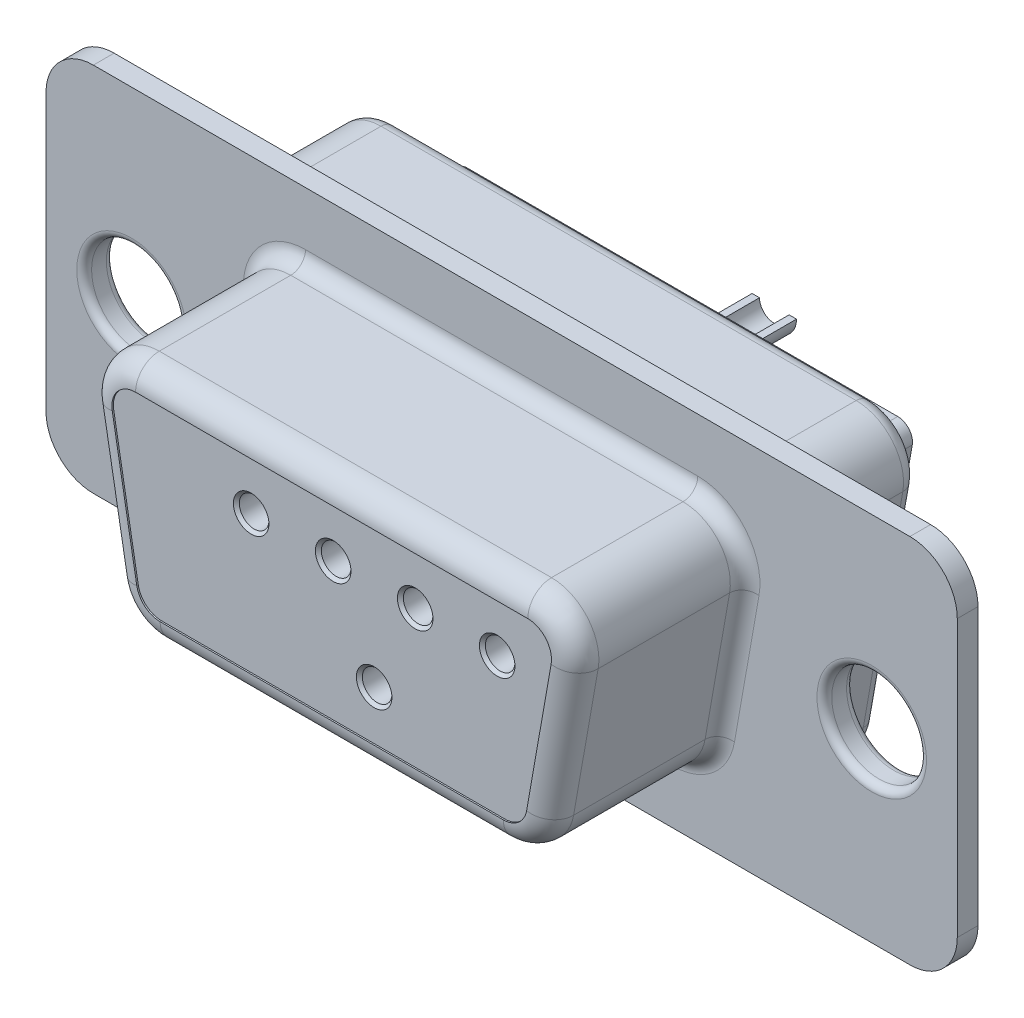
ISO-10303-21;
HEADER;
FILE_DESCRIPTION(('STEP AP214'),'2;1');
FILE_NAME('part.step','',(''),(''),'','','');
FILE_SCHEMA(('AUTOMOTIVE_DESIGN { 1 0 10303 214 1 1 1 1 }'));
ENDSEC;
DATA;
#1=APPLICATION_CONTEXT('core data for automotive mechanical design processes');
#2=APPLICATION_PROTOCOL_DEFINITION('international standard','automotive_design',2000,#1);
#3=PRODUCT_CONTEXT('',#1,'mechanical');
#4=PRODUCT('Part','Part','',(#3));
#5=PRODUCT_RELATED_PRODUCT_CATEGORY('part','',(#4));
#6=PRODUCT_DEFINITION_FORMATION('','',#4);
#7=PRODUCT_DEFINITION_CONTEXT('part definition',#1,'design');
#8=PRODUCT_DEFINITION('design','',#6,#7);
#9=PRODUCT_DEFINITION_SHAPE('','',#8);
#10=(LENGTH_UNIT() NAMED_UNIT(*) SI_UNIT(.MILLI.,.METRE.));
#11=(NAMED_UNIT(*) PLANE_ANGLE_UNIT() SI_UNIT($,.RADIAN.));
#12=(NAMED_UNIT(*) SI_UNIT($,.STERADIAN.) SOLID_ANGLE_UNIT());
#13=UNCERTAINTY_MEASURE_WITH_UNIT(LENGTH_MEASURE(1.E-05),#10,'distance_accuracy_value','');
#14=(GEOMETRIC_REPRESENTATION_CONTEXT(3) GLOBAL_UNCERTAINTY_ASSIGNED_CONTEXT((#13)) GLOBAL_UNIT_ASSIGNED_CONTEXT((#10,
#11,#12)) REPRESENTATION_CONTEXT('',''));
#15=CARTESIAN_POINT('',(0.,0.,0.));
#16=DIRECTION('',(0.,0.,1.));
#17=DIRECTION('',(1.,0.,0.));
#18=AXIS2_PLACEMENT_3D('',#15,#16,#17);
#19=CARTESIAN_POINT('',(-1.385,-1.5,-9.21));
#20=DIRECTION('',(0.,0.,1.));
#21=DIRECTION('',(1.,0.,0.));
#22=AXIS2_PLACEMENT_3D('',#19,#20,#21);
#23=CYLINDRICAL_SURFACE('',#22,0.75);
#24=CARTESIAN_POINT('',(-1.385,-1.5,-6.11));
#25=DIRECTION('',(0.,0.,-1.));
#26=DIRECTION('',(-1.,0.,0.));
#27=AXIS2_PLACEMENT_3D('',#24,#25,#26);
#28=CIRCLE('',#27,0.75);
#29=CARTESIAN_POINT('',(-2.135,-1.5,-6.11));
#30=VERTEX_POINT('',#29);
#31=EDGE_CURVE('E465',#30,#30,#28,.T.);
#32=ORIENTED_EDGE('',*,*,#31,.T.);
#33=EDGE_LOOP('',(#32));
#34=FACE_BOUND('',#33,.T.);
#35=DIRECTION('',(0.,0.,1.));
#36=VECTOR('',#35,1.);
#37=CARTESIAN_POINT('',(-0.635000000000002,-1.5,-9.21));
#38=LINE('',#37,#36);
#39=CARTESIAN_POINT('',(-0.635000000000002,-1.5,-9.21));
#40=VERTEX_POINT('',#39);
#41=CARTESIAN_POINT('',(-0.635000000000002,-1.5,-7.21));
#42=VERTEX_POINT('',#41);
#43=EDGE_CURVE('E1060',#40,#42,#38,.T.);
#44=ORIENTED_EDGE('',*,*,#43,.F.);
#45=CARTESIAN_POINT('',(-1.385,-1.5,-9.21));
#46=DIRECTION('',(0.,0.,-1.));
#47=DIRECTION('',(-1.,0.,0.));
#48=AXIS2_PLACEMENT_3D('',#45,#46,#47);
#49=CIRCLE('',#48,0.75);
#50=CARTESIAN_POINT('',(-2.135,-1.5,-9.21));
#51=VERTEX_POINT('',#50);
#52=EDGE_CURVE('E458',#51,#40,#49,.T.);
#53=ORIENTED_EDGE('',*,*,#52,.F.);
#54=DIRECTION('',(0.,0.,1.));
#55=VECTOR('',#54,1.);
#56=CARTESIAN_POINT('',(-2.135,-1.5,-9.21));
#57=LINE('',#56,#55);
#58=CARTESIAN_POINT('',(-2.135,-1.5,-7.21));
#59=VERTEX_POINT('',#58);
#60=EDGE_CURVE('E449',#59,#51,#57,.F.);
#61=ORIENTED_EDGE('',*,*,#60,.F.);
#62=CARTESIAN_POINT('',(-1.385,-1.5,-7.21));
#63=DIRECTION('',(0.,0.,1.));
#64=DIRECTION('',(1.,0.,0.));
#65=AXIS2_PLACEMENT_3D('',#62,#63,#64);
#66=CIRCLE('',#65,0.75);
#67=EDGE_CURVE('E1043',#59,#42,#66,.T.);
#68=ORIENTED_EDGE('',*,*,#67,.T.);
#69=EDGE_LOOP('',(#44,#53,#61,#68));
#70=FACE_BOUND('',#69,.T.);
#71=ADVANCED_FACE('F31',(#34,#70),#23,.T.);
#72=CARTESIAN_POINT('',(-1.385,-1.5,-9.21));
#73=DIRECTION('',(0.,0.,-1.));
#74=DIRECTION('',(-1.,0.,0.));
#75=AXIS2_PLACEMENT_3D('',#72,#73,#74);
#76=PLANE('',#75);
#77=ORIENTED_EDGE('',*,*,#52,.T.);
#78=DIRECTION('',(-1.,0.,0.));
#79=VECTOR('',#78,1.);
#80=CARTESIAN_POINT('',(6.29,-1.5,-9.21));
#81=LINE('',#80,#79);
#82=CARTESIAN_POINT('',(-0.885,-1.5,-9.21));
#83=VERTEX_POINT('',#82);
#84=EDGE_CURVE('E2181',#40,#83,#81,.T.);
#85=ORIENTED_EDGE('',*,*,#84,.T.);
#86=CARTESIAN_POINT('',(-1.385,-1.5,-9.21));
#87=DIRECTION('',(0.,0.,-1.));
#88=DIRECTION('',(-1.,0.,0.));
#89=AXIS2_PLACEMENT_3D('',#86,#87,#88);
#90=CIRCLE('',#89,0.500000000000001);
#91=CARTESIAN_POINT('',(-1.885,-1.5,-9.21));
#92=VERTEX_POINT('',#91);
#93=EDGE_CURVE('E1020',#92,#83,#90,.T.);
#94=ORIENTED_EDGE('',*,*,#93,.F.);
#95=EDGE_CURVE('E441',#92,#51,#81,.T.);
#96=ORIENTED_EDGE('',*,*,#95,.T.);
#97=EDGE_LOOP('',(#77,#85,#94,#96));
#98=FACE_BOUND('',#97,.T.);
#99=ADVANCED_FACE('F1147',(#98),#76,.T.);
#100=CARTESIAN_POINT('',(1.385,-1.50000000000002,-9.21));
#101=DIRECTION('',(0.,0.,1.));
#102=DIRECTION('',(1.,0.,0.));
#103=AXIS2_PLACEMENT_3D('',#100,#101,#102);
#104=CYLINDRICAL_SURFACE('',#103,0.75);
#105=CARTESIAN_POINT('',(1.385,-1.50000000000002,-6.11));
#106=DIRECTION('',(0.,0.,-1.));
#107=DIRECTION('',(-1.,0.,0.));
#108=AXIS2_PLACEMENT_3D('',#105,#106,#107);
#109=CIRCLE('',#108,0.75);
#110=CARTESIAN_POINT('',(0.634999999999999,-1.50000000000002,-6.11));
#111=VERTEX_POINT('',#110);
#112=EDGE_CURVE('E454',#111,#111,#109,.T.);
#113=ORIENTED_EDGE('',*,*,#112,.T.);
#114=EDGE_LOOP('',(#113));
#115=FACE_BOUND('',#114,.T.);
#116=DIRECTION('',(0.,0.,1.));
#117=VECTOR('',#116,1.);
#118=CARTESIAN_POINT('',(2.135,-1.5,-9.21));
#119=LINE('',#118,#117);
#120=CARTESIAN_POINT('',(2.135,-1.5,-9.21));
#121=VERTEX_POINT('',#120);
#122=CARTESIAN_POINT('',(2.135,-1.5,-7.21));
#123=VERTEX_POINT('',#122);
#124=EDGE_CURVE('E432',#121,#123,#119,.T.);
#125=ORIENTED_EDGE('',*,*,#124,.F.);
#126=CARTESIAN_POINT('',(1.385,-1.50000000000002,-9.21));
#127=DIRECTION('',(0.,0.,-1.));
#128=DIRECTION('',(-1.,0.,0.));
#129=AXIS2_PLACEMENT_3D('',#126,#127,#128);
#130=CIRCLE('',#129,0.75);
#131=CARTESIAN_POINT('',(0.634999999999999,-1.5,-9.21));
#132=VERTEX_POINT('',#131);
#133=EDGE_CURVE('E447',#132,#121,#130,.T.);
#134=ORIENTED_EDGE('',*,*,#133,.F.);
#135=DIRECTION('',(0.,0.,1.));
#136=VECTOR('',#135,1.);
#137=CARTESIAN_POINT('',(0.634999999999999,-1.5,-9.21));
#138=LINE('',#137,#136);
#139=CARTESIAN_POINT('',(0.634999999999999,-1.5,-7.21));
#140=VERTEX_POINT('',#139);
#141=EDGE_CURVE('E450',#140,#132,#138,.F.);
#142=ORIENTED_EDGE('',*,*,#141,.F.);
#143=CARTESIAN_POINT('',(1.385,-1.50000000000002,-7.21));
#144=DIRECTION('',(0.,0.,1.));
#145=DIRECTION('',(1.,0.,0.));
#146=AXIS2_PLACEMENT_3D('',#143,#144,#145);
#147=CIRCLE('',#146,0.75);
#148=EDGE_CURVE('E448',#140,#123,#147,.T.);
#149=ORIENTED_EDGE('',*,*,#148,.T.);
#150=EDGE_LOOP('',(#125,#134,#142,#149));
#151=FACE_BOUND('',#150,.T.);
#152=ADVANCED_FACE('F445',(#115,#151),#104,.T.);
#153=CARTESIAN_POINT('',(1.385,-1.50000000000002,-9.21));
#154=DIRECTION('',(0.,0.,-1.));
#155=DIRECTION('',(-1.,0.,0.));
#156=AXIS2_PLACEMENT_3D('',#153,#154,#155);
#157=PLANE('',#156);
#158=ORIENTED_EDGE('',*,*,#133,.T.);
#159=CARTESIAN_POINT('',(1.885,-1.5,-9.21));
#160=VERTEX_POINT('',#159);
#161=EDGE_CURVE('E429',#121,#160,#81,.T.);
#162=ORIENTED_EDGE('',*,*,#161,.T.);
#163=CARTESIAN_POINT('',(1.385,-1.5,-9.21));
#164=DIRECTION('',(0.,0.,-1.));
#165=DIRECTION('',(-1.,0.,0.));
#166=AXIS2_PLACEMENT_3D('',#163,#164,#165);
#167=CIRCLE('',#166,0.500000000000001);
#168=CARTESIAN_POINT('',(0.884999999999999,-1.5,-9.21));
#169=VERTEX_POINT('',#168);
#170=EDGE_CURVE('E1088',#169,#160,#167,.T.);
#171=ORIENTED_EDGE('',*,*,#170,.F.);
#172=EDGE_CURVE('E439',#169,#132,#81,.T.);
#173=ORIENTED_EDGE('',*,*,#172,.T.);
#174=EDGE_LOOP('',(#158,#162,#171,#173));
#175=FACE_BOUND('',#174,.T.);
#176=ADVANCED_FACE('F453',(#175),#157,.T.);
#177=CARTESIAN_POINT('',(1.385,-1.5,-3.0357864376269));
#178=DIRECTION('',(0.,0.,-1.));
#179=DIRECTION('',(-1.,0.,0.));
#180=AXIS2_PLACEMENT_3D('',#177,#178,#179);
#181=CYLINDRICAL_SURFACE('',#180,0.500000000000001);
#182=CARTESIAN_POINT('',(1.385,-1.5,-4.45));
#183=DIRECTION('',(0.,0.,-1.));
#184=DIRECTION('',(-1.,0.,0.));
#185=AXIS2_PLACEMENT_3D('',#182,#183,#184);
#186=CIRCLE('',#185,0.500000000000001);
#187=CARTESIAN_POINT('',(0.884999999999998,-1.5,-4.45));
#188=VERTEX_POINT('',#187);
#189=EDGE_CURVE('E1090',#188,#188,#186,.F.);
#190=ORIENTED_EDGE('',*,*,#189,.T.);
#191=EDGE_LOOP('',(#190));
#192=FACE_BOUND('',#191,.T.);
#193=DIRECTION('',(0.,0.,-1.));
#194=VECTOR('',#193,1.);
#195=CARTESIAN_POINT('',(0.884999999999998,-1.5,-3.0357864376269));
#196=LINE('',#195,#194);
#197=CARTESIAN_POINT('',(0.884999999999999,-1.5,-7.21));
#198=VERTEX_POINT('',#197);
#199=EDGE_CURVE('E1047',#169,#198,#196,.F.);
#200=ORIENTED_EDGE('',*,*,#199,.F.);
#201=ORIENTED_EDGE('',*,*,#170,.T.);
#202=DIRECTION('',(0.,0.,-1.));
#203=VECTOR('',#202,1.);
#204=CARTESIAN_POINT('',(1.885,-1.5,-3.0357864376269));
#205=LINE('',#204,#203);
#206=CARTESIAN_POINT('',(1.885,-1.5,-7.21));
#207=VERTEX_POINT('',#206);
#208=EDGE_CURVE('E434',#207,#160,#205,.T.);
#209=ORIENTED_EDGE('',*,*,#208,.F.);
#210=CARTESIAN_POINT('',(1.385,-1.5,-7.21));
#211=DIRECTION('',(0.,0.,1.));
#212=DIRECTION('',(1.,0.,0.));
#213=AXIS2_PLACEMENT_3D('',#210,#211,#212);
#214=CIRCLE('',#213,0.500000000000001);
#215=EDGE_CURVE('E1055',#207,#198,#214,.F.);
#216=ORIENTED_EDGE('',*,*,#215,.T.);
#217=EDGE_LOOP('',(#200,#201,#209,#216));
#218=FACE_BOUND('',#217,.T.);
#219=ADVANCED_FACE('F1059',(#192,#218),#181,.F.);
#220=CARTESIAN_POINT('',(-1.385,-1.5,-3.0357864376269));
#221=DIRECTION('',(0.,0.,-1.));
#222=DIRECTION('',(-1.,0.,0.));
#223=AXIS2_PLACEMENT_3D('',#220,#221,#222);
#224=CYLINDRICAL_SURFACE('',#223,0.500000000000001);
#225=CARTESIAN_POINT('',(-1.385,-1.5,-4.45));
#226=DIRECTION('',(0.,0.,-1.));
#227=DIRECTION('',(-1.,0.,0.));
#228=AXIS2_PLACEMENT_3D('',#225,#226,#227);
#229=CIRCLE('',#228,0.500000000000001);
#230=CARTESIAN_POINT('',(-1.885,-1.5,-4.45));
#231=VERTEX_POINT('',#230);
#232=EDGE_CURVE('E1085',#231,#231,#229,.F.);
#233=ORIENTED_EDGE('',*,*,#232,.T.);
#234=EDGE_LOOP('',(#233));
#235=FACE_BOUND('',#234,.T.);
#236=DIRECTION('',(0.,0.,-1.));
#237=VECTOR('',#236,1.);
#238=CARTESIAN_POINT('',(-1.885,-1.5,-3.0357864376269));
#239=LINE('',#238,#237);
#240=CARTESIAN_POINT('',(-1.885,-1.5,-7.21));
#241=VERTEX_POINT('',#240);
#242=EDGE_CURVE('E11',#92,#241,#239,.F.);
#243=ORIENTED_EDGE('',*,*,#242,.F.);
#244=ORIENTED_EDGE('',*,*,#93,.T.);
#245=DIRECTION('',(0.,0.,-1.));
#246=VECTOR('',#245,1.);
#247=CARTESIAN_POINT('',(-0.885,-1.5,-3.0357864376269));
#248=LINE('',#247,#246);
#249=CARTESIAN_POINT('',(-0.885,-1.5,-7.21));
#250=VERTEX_POINT('',#249);
#251=EDGE_CURVE('E1029',#250,#83,#248,.T.);
#252=ORIENTED_EDGE('',*,*,#251,.F.);
#253=CARTESIAN_POINT('',(-1.385,-1.5,-7.21));
#254=DIRECTION('',(0.,0.,1.));
#255=DIRECTION('',(1.,0.,0.));
#256=AXIS2_PLACEMENT_3D('',#253,#254,#255);
#257=CIRCLE('',#256,0.500000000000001);
#258=EDGE_CURVE('E39',#250,#241,#257,.F.);
#259=ORIENTED_EDGE('',*,*,#258,.T.);
#260=EDGE_LOOP('',(#243,#244,#252,#259));
#261=FACE_BOUND('',#260,.T.);
#262=ADVANCED_FACE('F1034',(#235,#261),#224,.F.);
#263=CARTESIAN_POINT('',(13.79,4.665,-0.7));
#264=DIRECTION('',(0.,0.,-1.));
#265=DIRECTION('',(-1.,0.,0.));
#266=AXIS2_PLACEMENT_3D('',#263,#264,#265);
#267=PLANE('',#266);
#268=DIRECTION('',(1.,0.,0.));
#269=VECTOR('',#268,1.);
#270=CARTESIAN_POINT('',(13.79,5.885,-0.7));
#271=LINE('',#270,#269);
#272=CARTESIAN_POINT('',(8.02430759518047,5.885,-0.7));
#273=VERTEX_POINT('',#272);
#274=CARTESIAN_POINT('',(-8.02430759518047,5.885,-0.7));
#275=VERTEX_POINT('',#274);
#276=EDGE_CURVE('E943',#273,#275,#271,.F.);
#277=ORIENTED_EDGE('',*,*,#276,.T.);
#278=CARTESIAN_POINT('',(-8.02430759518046,3.785,-0.7));
#279=DIRECTION('',(0.,0.,-1.));
#280=DIRECTION('',(-1.,0.,0.));
#281=AXIS2_PLACEMENT_3D('',#278,#279,#280);
#282=CIRCLE('',#281,2.09999999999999);
#283=CARTESIAN_POINT('',(-10.0924038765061,3.42033882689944,-0.7));
#284=VERTEX_POINT('',#283);
#285=EDGE_CURVE('E957',#275,#284,#282,.F.);
#286=ORIENTED_EDGE('',*,*,#285,.T.);
#287=DIRECTION('',(-0.17364817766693,0.984807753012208,0.));
#288=VECTOR('',#287,1.);
#289=CARTESIAN_POINT('',(-9.58511087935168,0.543337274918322,-0.7));
#290=LINE('',#289,#288);
#291=CARTESIAN_POINT('',(-8.75760863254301,-4.14966117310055,-0.7));
#292=VERTEX_POINT('',#291);
#293=EDGE_CURVE('E955',#284,#292,#290,.F.);
#294=ORIENTED_EDGE('',*,*,#293,.T.);
#295=CARTESIAN_POINT('',(-6.68951235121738,-3.785,-0.7));
#296=DIRECTION('',(0.,0.,-1.));
#297=DIRECTION('',(-1.,0.,0.));
#298=AXIS2_PLACEMENT_3D('',#295,#296,#297);
#299=CIRCLE('',#298,2.09999999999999);
#300=CARTESIAN_POINT('',(-6.68951235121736,-5.885,-0.7));
#301=VERTEX_POINT('',#300);
#302=EDGE_CURVE('E953',#292,#301,#299,.F.);
#303=ORIENTED_EDGE('',*,*,#302,.T.);
#304=DIRECTION('',(-1.,0.,0.));
#305=VECTOR('',#304,1.);
#306=CARTESIAN_POINT('',(13.79,-5.885,-0.7));
#307=LINE('',#306,#305);
#308=CARTESIAN_POINT('',(6.68951235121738,-5.885,-0.7));
#309=VERTEX_POINT('',#308);
#310=EDGE_CURVE('E951',#301,#309,#307,.F.);
#311=ORIENTED_EDGE('',*,*,#310,.T.);
#312=CARTESIAN_POINT('',(6.68951235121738,-3.785,-0.7));
#313=DIRECTION('',(0.,0.,-1.));
#314=DIRECTION('',(-1.,0.,0.));
#315=AXIS2_PLACEMENT_3D('',#312,#313,#314);
#316=CIRCLE('',#315,2.1);
#317=CARTESIAN_POINT('',(8.75760863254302,-4.14966117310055,-0.7));
#318=VERTEX_POINT('',#317);
#319=EDGE_CURVE('E949',#309,#318,#316,.F.);
#320=ORIENTED_EDGE('',*,*,#319,.T.);
#321=DIRECTION('',(-0.173648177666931,-0.984807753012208,0.));
#322=VECTOR('',#321,1.);
#323=CARTESIAN_POINT('',(10.416749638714,5.2597950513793,-0.7));
#324=LINE('',#323,#322);
#325=CARTESIAN_POINT('',(10.0924038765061,3.42033882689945,-0.7));
#326=VERTEX_POINT('',#325);
#327=EDGE_CURVE('E947',#318,#326,#324,.F.);
#328=ORIENTED_EDGE('',*,*,#327,.T.);
#329=CARTESIAN_POINT('',(8.02430759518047,3.785,-0.7));
#330=DIRECTION('',(0.,0.,-1.));
#331=DIRECTION('',(-1.,0.,0.));
#332=AXIS2_PLACEMENT_3D('',#329,#330,#331);
#333=CIRCLE('',#332,2.1);
#334=EDGE_CURVE('E945',#326,#273,#333,.F.);
#335=ORIENTED_EDGE('',*,*,#334,.T.);
#336=EDGE_LOOP('',(#277,#286,#294,#303,#311,#320,#328,#335));
#337=FACE_BOUND('',#336,.T.);
#338=CARTESIAN_POINT('',(12.5,0.,-0.7));
#339=DIRECTION('',(0.,0.,-1.));
#340=DIRECTION('',(-1.,0.,0.));
#341=AXIS2_PLACEMENT_3D('',#338,#339,#340);
#342=CIRCLE('',#341,2.15);
#343=CARTESIAN_POINT('',(10.35,0.,-0.7));
#344=VERTEX_POINT('',#343);
#345=EDGE_CURVE('E461',#344,#344,#342,.T.);
#346=ORIENTED_EDGE('',*,*,#345,.F.);
#347=EDGE_LOOP('',(#346));
#348=FACE_BOUND('',#347,.T.);
#349=CARTESIAN_POINT('',(13.79,4.665,-0.7));
#350=DIRECTION('',(0.,0.,1.));
#351=DIRECTION('',(-1.,0.,0.));
#352=AXIS2_PLACEMENT_3D('',#349,#350,#351);
#353=CIRCLE('',#352,1.6);
#354=CARTESIAN_POINT('',(15.39,4.665,-0.7));
#355=VERTEX_POINT('',#354);
#356=CARTESIAN_POINT('',(13.79,6.265,-0.7));
#357=VERTEX_POINT('',#356);
#358=EDGE_CURVE('E650',#355,#357,#353,.T.);
#359=ORIENTED_EDGE('',*,*,#358,.F.);
#360=DIRECTION('',(0.,1.,0.));
#361=VECTOR('',#360,1.);
#362=CARTESIAN_POINT('',(15.39,4.665,-0.7));
#363=LINE('',#362,#361);
#364=CARTESIAN_POINT('',(15.39,-4.665,-0.7));
#365=VERTEX_POINT('',#364);
#366=EDGE_CURVE('E672',#365,#355,#363,.T.);
#367=ORIENTED_EDGE('',*,*,#366,.F.);
#368=CARTESIAN_POINT('',(13.79,-4.665,-0.7));
#369=DIRECTION('',(0.,0.,1.));
#370=DIRECTION('',(1.,0.,0.));
#371=AXIS2_PLACEMENT_3D('',#368,#369,#370);
#372=CIRCLE('',#371,1.6);
#373=CARTESIAN_POINT('',(13.79,-6.265,-0.7));
#374=VERTEX_POINT('',#373);
#375=EDGE_CURVE('E669',#374,#365,#372,.T.);
#376=ORIENTED_EDGE('',*,*,#375,.F.);
#377=DIRECTION('',(1.,0.,0.));
#378=VECTOR('',#377,1.);
#379=CARTESIAN_POINT('',(-13.79,-6.265,-0.7));
#380=LINE('',#379,#378);
#381=CARTESIAN_POINT('',(-13.79,-6.265,-0.7));
#382=VERTEX_POINT('',#381);
#383=EDGE_CURVE('E666',#382,#374,#380,.T.);
#384=ORIENTED_EDGE('',*,*,#383,.F.);
#385=CARTESIAN_POINT('',(-13.79,-4.665,-0.7));
#386=DIRECTION('',(0.,0.,1.));
#387=DIRECTION('',(1.,0.,0.));
#388=AXIS2_PLACEMENT_3D('',#385,#386,#387);
#389=CIRCLE('',#388,1.6);
#390=CARTESIAN_POINT('',(-15.39,-4.665,-0.7));
#391=VERTEX_POINT('',#390);
#392=EDGE_CURVE('E663',#391,#382,#389,.T.);
#393=ORIENTED_EDGE('',*,*,#392,.F.);
#394=DIRECTION('',(0.,-1.,0.));
#395=VECTOR('',#394,1.);
#396=CARTESIAN_POINT('',(-15.39,4.665,-0.7));
#397=LINE('',#396,#395);
#398=CARTESIAN_POINT('',(-15.39,4.665,-0.7));
#399=VERTEX_POINT('',#398);
#400=EDGE_CURVE('E660',#399,#391,#397,.T.);
#401=ORIENTED_EDGE('',*,*,#400,.F.);
#402=CARTESIAN_POINT('',(-13.79,4.665,-0.7));
#403=DIRECTION('',(0.,0.,1.));
#404=DIRECTION('',(1.,0.,0.));
#405=AXIS2_PLACEMENT_3D('',#402,#403,#404);
#406=CIRCLE('',#405,1.6);
#407=CARTESIAN_POINT('',(-13.79,6.265,-0.7));
#408=VERTEX_POINT('',#407);
#409=EDGE_CURVE('E657',#408,#399,#406,.T.);
#410=ORIENTED_EDGE('',*,*,#409,.F.);
#411=DIRECTION('',(-1.,0.,0.));
#412=VECTOR('',#411,1.);
#413=CARTESIAN_POINT('',(-13.79,6.265,-0.7));
#414=LINE('',#413,#412);
#415=EDGE_CURVE('E653',#357,#408,#414,.T.);
#416=ORIENTED_EDGE('',*,*,#415,.F.);
#417=EDGE_LOOP('',(#359,#367,#376,#384,#393,#401,#410,#416));
#418=FACE_BOUND('',#417,.T.);
#419=CARTESIAN_POINT('',(-12.5,0.,-0.7));
#420=DIRECTION('',(0.,0.,-1.));
#421=DIRECTION('',(-1.,0.,0.));
#422=AXIS2_PLACEMENT_3D('',#419,#420,#421);
#423=CIRCLE('',#422,2.15);
#424=CARTESIAN_POINT('',(-14.65,0.,-0.7));
#425=VERTEX_POINT('',#424);
#426=EDGE_CURVE('E940',#425,#425,#423,.T.);
#427=ORIENTED_EDGE('',*,*,#426,.F.);
#428=EDGE_LOOP('',(#427));
#429=FACE_BOUND('',#428,.T.);
#430=ADVANCED_FACE('F1117',(#337,#348,#418,#429),#267,.T.);
#431=CARTESIAN_POINT('',(-7.26759612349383,2.96,-6.11));
#432=DIRECTION('',(0.,0.,-1.));
#433=DIRECTION('',(-1.,0.,0.));
#434=AXIS2_PLACEMENT_3D('',#431,#432,#433);
#435=PLANE('',#434);
#436=CARTESIAN_POINT('',(-4.155,-1.5,-6.11));
#437=DIRECTION('',(0.,0.,-1.));
#438=DIRECTION('',(-1.,0.,0.));
#439=AXIS2_PLACEMENT_3D('',#436,#437,#438);
#440=CIRCLE('',#439,0.500000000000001);
#441=CARTESIAN_POINT('',(-4.655,-1.5,-6.11));
#442=VERTEX_POINT('',#441);
#443=EDGE_CURVE('E1017',#442,#442,#440,.T.);
#444=ORIENTED_EDGE('',*,*,#443,.F.);
#445=EDGE_LOOP('',(#444));
#446=FACE_BOUND('',#445,.T.);
#447=CARTESIAN_POINT('',(4.155,-1.5,-6.11));
#448=DIRECTION('',(0.,0.,-1.));
#449=DIRECTION('',(-1.,0.,0.));
#450=AXIS2_PLACEMENT_3D('',#447,#448,#449);
#451=CIRCLE('',#450,0.500000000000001);
#452=CARTESIAN_POINT('',(3.655,-1.5,-6.11));
#453=VERTEX_POINT('',#452);
#454=EDGE_CURVE('E1013',#453,#453,#451,.T.);
#455=ORIENTED_EDGE('',*,*,#454,.F.);
#456=EDGE_LOOP('',(#455));
#457=FACE_BOUND('',#456,.T.);
#458=CARTESIAN_POINT('',(-5.54,1.5,-6.11));
#459=DIRECTION('',(0.,0.,-1.));
#460=DIRECTION('',(-1.,0.,0.));
#461=AXIS2_PLACEMENT_3D('',#458,#459,#460);
#462=CIRCLE('',#461,0.499999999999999);
#463=CARTESIAN_POINT('',(-6.04,1.5,-6.11));
#464=VERTEX_POINT('',#463);
#465=EDGE_CURVE('E1009',#464,#464,#462,.T.);
#466=ORIENTED_EDGE('',*,*,#465,.F.);
#467=EDGE_LOOP('',(#466));
#468=FACE_BOUND('',#467,.T.);
#469=CARTESIAN_POINT('',(-2.77,1.5,-6.11));
#470=DIRECTION('',(0.,0.,-1.));
#471=DIRECTION('',(-1.,0.,0.));
#472=AXIS2_PLACEMENT_3D('',#469,#470,#471);
#473=CIRCLE('',#472,0.499999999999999);
#474=CARTESIAN_POINT('',(-3.27,1.5,-6.11));
#475=VERTEX_POINT('',#474);
#476=EDGE_CURVE('E1004',#475,#475,#473,.T.);
#477=ORIENTED_EDGE('',*,*,#476,.F.);
#478=EDGE_LOOP('',(#477));
#479=FACE_BOUND('',#478,.T.);
#480=CARTESIAN_POINT('',(2.77,1.5,-6.11));
#481=DIRECTION('',(0.,0.,-1.));
#482=DIRECTION('',(-1.,0.,0.));
#483=AXIS2_PLACEMENT_3D('',#480,#481,#482);
#484=CIRCLE('',#483,0.499999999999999);
#485=CARTESIAN_POINT('',(2.27,1.5,-6.11));
#486=VERTEX_POINT('',#485);
#487=EDGE_CURVE('E1000',#486,#486,#484,.T.);
#488=ORIENTED_EDGE('',*,*,#487,.F.);
#489=EDGE_LOOP('',(#488));
#490=FACE_BOUND('',#489,.T.);
#491=CARTESIAN_POINT('',(5.54,1.5,-6.11));
#492=DIRECTION('',(0.,0.,-1.));
#493=DIRECTION('',(-1.,0.,0.));
#494=AXIS2_PLACEMENT_3D('',#491,#492,#493);
#495=CIRCLE('',#494,0.499999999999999);
#496=CARTESIAN_POINT('',(5.04,1.5,-6.11));
#497=VERTEX_POINT('',#496);
#498=EDGE_CURVE('E978',#497,#497,#495,.T.);
#499=ORIENTED_EDGE('',*,*,#498,.F.);
#500=EDGE_LOOP('',(#499));
#501=FACE_BOUND('',#500,.T.);
#502=ORIENTED_EDGE('',*,*,#31,.F.);
#503=EDGE_LOOP('',(#502));
#504=FACE_BOUND('',#503,.T.);
#505=CARTESIAN_POINT('',(-7.26759612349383,2.96,-6.11));
#506=DIRECTION('',(0.,0.,-1.));
#507=DIRECTION('',(-1.,0.,0.));
#508=AXIS2_PLACEMENT_3D('',#505,#506,#507);
#509=CIRCLE('',#508,0.500000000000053);
#510=CARTESIAN_POINT('',(-7.75999999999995,2.87317591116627,-6.11));
#511=VERTEX_POINT('',#510);
#512=CARTESIAN_POINT('',(-7.26759612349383,3.46000000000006,-6.11));
#513=VERTEX_POINT('',#512);
#514=EDGE_CURVE('E474',#511,#513,#509,.T.);
#515=ORIENTED_EDGE('',*,*,#514,.T.);
#516=DIRECTION('',(1.,0.,0.));
#517=VECTOR('',#516,1.);
#518=CARTESIAN_POINT('',(-7.26759612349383,3.46000000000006,-6.11));
#519=LINE('',#518,#517);
#520=CARTESIAN_POINT('',(7.2675961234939,3.46,-6.11));
#521=VERTEX_POINT('',#520);
#522=EDGE_CURVE('E479',#513,#521,#519,.T.);
#523=ORIENTED_EDGE('',*,*,#522,.T.);
#524=CARTESIAN_POINT('',(7.2675961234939,2.96,-6.11));
#525=DIRECTION('',(0.,0.,-1.));
#526=DIRECTION('',(-1.,0.,0.));
#527=AXIS2_PLACEMENT_3D('',#524,#525,#526);
#528=CIRCLE('',#527,0.499999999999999);
#529=CARTESIAN_POINT('',(7.76,2.87317591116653,-6.11));
#530=VERTEX_POINT('',#529);
#531=EDGE_CURVE('E481',#521,#530,#528,.T.);
#532=ORIENTED_EDGE('',*,*,#531,.T.);
#533=DIRECTION('',(-0.173648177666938,-0.984807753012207,0.));
#534=VECTOR('',#533,1.);
#535=CARTESIAN_POINT('',(7.76,2.87317591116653,-6.11));
#536=LINE('',#535,#534);
#537=CARTESIAN_POINT('',(6.71614427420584,-3.04682408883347,-6.11));
#538=VERTEX_POINT('',#537);
#539=EDGE_CURVE('E483',#530,#538,#536,.T.);
#540=ORIENTED_EDGE('',*,*,#539,.T.);
#541=CARTESIAN_POINT('',(6.22374039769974,-2.96,-6.11));
#542=DIRECTION('',(0.,0.,-1.));
#543=DIRECTION('',(-1.,0.,0.));
#544=AXIS2_PLACEMENT_3D('',#541,#542,#543);
#545=CIRCLE('',#544,0.500000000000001);
#546=CARTESIAN_POINT('',(6.22374039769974,-3.46,-6.11));
#547=VERTEX_POINT('',#546);
#548=EDGE_CURVE('E485',#538,#547,#545,.T.);
#549=ORIENTED_EDGE('',*,*,#548,.T.);
#550=DIRECTION('',(-1.,0.,0.));
#551=VECTOR('',#550,1.);
#552=CARTESIAN_POINT('',(6.22374039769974,-3.46,-6.11));
#553=LINE('',#552,#551);
#554=CARTESIAN_POINT('',(-6.22374039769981,-3.46000000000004,-6.11));
#555=VERTEX_POINT('',#554);
#556=EDGE_CURVE('E487',#547,#555,#553,.T.);
#557=ORIENTED_EDGE('',*,*,#556,.T.);
#558=CARTESIAN_POINT('',(-6.22374039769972,-2.96,-6.11));
#559=DIRECTION('',(0.,0.,-1.));
#560=DIRECTION('',(-1.,0.,0.));
#561=AXIS2_PLACEMENT_3D('',#558,#559,#560);
#562=CIRCLE('',#561,0.500000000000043);
#563=CARTESIAN_POINT('',(-6.71614427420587,-3.04682408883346,-6.11));
#564=VERTEX_POINT('',#563);
#565=EDGE_CURVE('E489',#555,#564,#562,.T.);
#566=ORIENTED_EDGE('',*,*,#565,.T.);
#567=DIRECTION('',(-0.173648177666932,0.984807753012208,0.));
#568=VECTOR('',#567,1.);
#569=CARTESIAN_POINT('',(-6.71614427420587,-3.04682408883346,-6.11));
#570=LINE('',#569,#568);
#571=EDGE_CURVE('E491',#564,#511,#570,.T.);
#572=ORIENTED_EDGE('',*,*,#571,.T.);
#573=EDGE_LOOP('',(#515,#523,#532,#540,#549,#557,#566,#572));
#574=FACE_BOUND('',#573,.T.);
#575=CARTESIAN_POINT('',(0.,1.5,-6.11));
#576=DIRECTION('',(0.,0.,-1.));
#577=DIRECTION('',(-1.,0.,0.));
#578=AXIS2_PLACEMENT_3D('',#575,#576,#577);
#579=CIRCLE('',#578,0.75);
#580=CARTESIAN_POINT('',(-0.750000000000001,1.5,-6.11));
#581=VERTEX_POINT('',#580);
#582=EDGE_CURVE('E468',#581,#581,#579,.T.);
#583=ORIENTED_EDGE('',*,*,#582,.F.);
#584=EDGE_LOOP('',(#583));
#585=FACE_BOUND('',#584,.T.);
#586=ORIENTED_EDGE('',*,*,#112,.F.);
#587=EDGE_LOOP('',(#586));
#588=FACE_BOUND('',#587,.T.);
#589=ADVANCED_FACE('F1120',(#446,#457,#468,#479,#490,#501,#504,#574,#585,#588),#435,.T.);
#590=CARTESIAN_POINT('',(13.79,4.665,0.));
#591=DIRECTION('',(0.,0.,-1.));
#592=DIRECTION('',(-1.,0.,0.));
#593=AXIS2_PLACEMENT_3D('',#590,#591,#592);
#594=PLANE('',#593);
#595=DIRECTION('',(-1.,0.,0.));
#596=VECTOR('',#595,1.);
#597=CARTESIAN_POINT('',(6.62430759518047,4.45,0.));
#598=LINE('',#597,#596);
#599=CARTESIAN_POINT('',(-6.62430759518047,4.45,0.));
#600=VERTEX_POINT('',#599);
#601=CARTESIAN_POINT('',(6.62430759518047,4.45,0.));
#602=VERTEX_POINT('',#601);
#603=EDGE_CURVE('E885',#600,#602,#598,.F.);
#604=ORIENTED_EDGE('',*,*,#603,.T.);
#605=CARTESIAN_POINT('',(6.62430759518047,2.35,0.));
#606=DIRECTION('',(0.,0.,-1.));
#607=DIRECTION('',(-1.,0.,0.));
#608=AXIS2_PLACEMENT_3D('',#605,#606,#607);
#609=CIRCLE('',#608,2.1);
#610=CARTESIAN_POINT('',(8.6924038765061,1.98533882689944,0.));
#611=VERTEX_POINT('',#610);
#612=EDGE_CURVE('E899',#602,#611,#609,.T.);
#613=ORIENTED_EDGE('',*,*,#612,.T.);
#614=DIRECTION('',(0.17364817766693,0.984807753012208,0.));
#615=VECTOR('',#614,1.);
#616=CARTESIAN_POINT('',(7.86366706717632,-2.71466117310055,0.));
#617=LINE('',#616,#615);
#618=CARTESIAN_POINT('',(7.86366706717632,-2.71466117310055,0.));
#619=VERTEX_POINT('',#618);
#620=EDGE_CURVE('E897',#611,#619,#617,.F.);
#621=ORIENTED_EDGE('',*,*,#620,.T.);
#622=CARTESIAN_POINT('',(5.79557078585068,-2.35,0.));
#623=DIRECTION('',(0.,0.,-1.));
#624=DIRECTION('',(-1.,0.,0.));
#625=AXIS2_PLACEMENT_3D('',#622,#623,#624);
#626=CIRCLE('',#625,2.1);
#627=CARTESIAN_POINT('',(5.79557078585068,-4.45,0.));
#628=VERTEX_POINT('',#627);
#629=EDGE_CURVE('E895',#619,#628,#626,.T.);
#630=ORIENTED_EDGE('',*,*,#629,.T.);
#631=DIRECTION('',(1.,0.,0.));
#632=VECTOR('',#631,1.);
#633=CARTESIAN_POINT('',(-5.79557078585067,-4.45,0.));
#634=LINE('',#633,#632);
#635=CARTESIAN_POINT('',(-5.79557078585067,-4.45,0.));
#636=VERTEX_POINT('',#635);
#637=EDGE_CURVE('E893',#628,#636,#634,.F.);
#638=ORIENTED_EDGE('',*,*,#637,.T.);
#639=CARTESIAN_POINT('',(-5.79557078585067,-2.35,0.));
#640=DIRECTION('',(0.,0.,-1.));
#641=DIRECTION('',(-1.,0.,0.));
#642=AXIS2_PLACEMENT_3D('',#639,#640,#641);
#643=CIRCLE('',#642,2.1);
#644=CARTESIAN_POINT('',(-7.86366706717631,-2.71466117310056,0.));
#645=VERTEX_POINT('',#644);
#646=EDGE_CURVE('E891',#636,#645,#643,.T.);
#647=ORIENTED_EDGE('',*,*,#646,.T.);
#648=DIRECTION('',(0.173648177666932,-0.984807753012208,0.));
#649=VECTOR('',#648,1.);
#650=CARTESIAN_POINT('',(-8.6924038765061,1.98533882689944,0.));
#651=LINE('',#650,#649);
#652=CARTESIAN_POINT('',(-8.6924038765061,1.98533882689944,0.));
#653=VERTEX_POINT('',#652);
#654=EDGE_CURVE('E889',#645,#653,#651,.F.);
#655=ORIENTED_EDGE('',*,*,#654,.T.);
#656=CARTESIAN_POINT('',(-6.62430759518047,2.35,0.));
#657=DIRECTION('',(0.,0.,-1.));
#658=DIRECTION('',(-1.,0.,0.));
#659=AXIS2_PLACEMENT_3D('',#656,#657,#658);
#660=CIRCLE('',#659,2.1);
#661=EDGE_CURVE('E887',#653,#600,#660,.T.);
#662=ORIENTED_EDGE('',*,*,#661,.T.);
#663=EDGE_LOOP('',(#604,#613,#621,#630,#638,#647,#655,#662));
#664=FACE_BOUND('',#663,.T.);
#665=CARTESIAN_POINT('',(-12.5,0.,0.));
#666=DIRECTION('',(0.,0.,-1.));
#667=DIRECTION('',(-1.,0.,0.));
#668=AXIS2_PLACEMENT_3D('',#665,#666,#667);
#669=CIRCLE('',#668,1.85);
#670=CARTESIAN_POINT('',(-14.35,0.,0.));
#671=VERTEX_POINT('',#670);
#672=EDGE_CURVE('E864',#671,#671,#669,.T.);
#673=ORIENTED_EDGE('',*,*,#672,.T.);
#674=EDGE_LOOP('',(#673));
#675=FACE_BOUND('',#674,.T.);
#676=CARTESIAN_POINT('',(12.5,0.,0.));
#677=DIRECTION('',(0.,0.,-1.));
#678=DIRECTION('',(-1.,0.,0.));
#679=AXIS2_PLACEMENT_3D('',#676,#677,#678);
#680=CIRCLE('',#679,1.85);
#681=CARTESIAN_POINT('',(10.65,0.,0.));
#682=VERTEX_POINT('',#681);
#683=EDGE_CURVE('E861',#682,#682,#680,.T.);
#684=ORIENTED_EDGE('',*,*,#683,.T.);
#685=EDGE_LOOP('',(#684));
#686=FACE_BOUND('',#685,.T.);
#687=CARTESIAN_POINT('',(13.79,4.665,0.));
#688=DIRECTION('',(0.,0.,1.));
#689=DIRECTION('',(-1.,0.,0.));
#690=AXIS2_PLACEMENT_3D('',#687,#688,#689);
#691=CIRCLE('',#690,1.6);
#692=CARTESIAN_POINT('',(15.39,4.665,0.));
#693=VERTEX_POINT('',#692);
#694=CARTESIAN_POINT('',(13.79,6.265,0.));
#695=VERTEX_POINT('',#694);
#696=EDGE_CURVE('E649',#693,#695,#691,.T.);
#697=ORIENTED_EDGE('',*,*,#696,.T.);
#698=DIRECTION('',(-1.,0.,0.));
#699=VECTOR('',#698,1.);
#700=CARTESIAN_POINT('',(-13.79,6.265,0.));
#701=LINE('',#700,#699);
#702=CARTESIAN_POINT('',(-13.79,6.265,0.));
#703=VERTEX_POINT('',#702);
#704=EDGE_CURVE('E678',#695,#703,#701,.T.);
#705=ORIENTED_EDGE('',*,*,#704,.T.);
#706=CARTESIAN_POINT('',(-13.79,4.665,0.));
#707=DIRECTION('',(0.,0.,1.));
#708=DIRECTION('',(1.,0.,0.));
#709=AXIS2_PLACEMENT_3D('',#706,#707,#708);
#710=CIRCLE('',#709,1.6);
#711=CARTESIAN_POINT('',(-15.39,4.665,0.));
#712=VERTEX_POINT('',#711);
#713=EDGE_CURVE('E681',#703,#712,#710,.T.);
#714=ORIENTED_EDGE('',*,*,#713,.T.);
#715=DIRECTION('',(0.,-1.,0.));
#716=VECTOR('',#715,1.);
#717=CARTESIAN_POINT('',(-15.39,4.665,0.));
#718=LINE('',#717,#716);
#719=CARTESIAN_POINT('',(-15.39,-4.665,0.));
#720=VERTEX_POINT('',#719);
#721=EDGE_CURVE('E684',#712,#720,#718,.T.);
#722=ORIENTED_EDGE('',*,*,#721,.T.);
#723=CARTESIAN_POINT('',(-13.79,-4.665,0.));
#724=DIRECTION('',(0.,0.,1.));
#725=DIRECTION('',(1.,0.,0.));
#726=AXIS2_PLACEMENT_3D('',#723,#724,#725);
#727=CIRCLE('',#726,1.6);
#728=CARTESIAN_POINT('',(-13.79,-6.265,0.));
#729=VERTEX_POINT('',#728);
#730=EDGE_CURVE('E687',#720,#729,#727,.T.);
#731=ORIENTED_EDGE('',*,*,#730,.T.);
#732=DIRECTION('',(1.,0.,0.));
#733=VECTOR('',#732,1.);
#734=CARTESIAN_POINT('',(-13.79,-6.265,0.));
#735=LINE('',#734,#733);
#736=CARTESIAN_POINT('',(13.79,-6.265,0.));
#737=VERTEX_POINT('',#736);
#738=EDGE_CURVE('E690',#729,#737,#735,.T.);
#739=ORIENTED_EDGE('',*,*,#738,.T.);
#740=CARTESIAN_POINT('',(13.79,-4.665,0.));
#741=DIRECTION('',(0.,0.,1.));
#742=DIRECTION('',(1.,0.,0.));
#743=AXIS2_PLACEMENT_3D('',#740,#741,#742);
#744=CIRCLE('',#743,1.6);
#745=CARTESIAN_POINT('',(15.39,-4.665,0.));
#746=VERTEX_POINT('',#745);
#747=EDGE_CURVE('E693',#737,#746,#744,.T.);
#748=ORIENTED_EDGE('',*,*,#747,.T.);
#749=DIRECTION('',(0.,1.,0.));
#750=VECTOR('',#749,1.);
#751=CARTESIAN_POINT('',(15.39,4.665,0.));
#752=LINE('',#751,#750);
#753=EDGE_CURVE('E654',#746,#693,#752,.T.);
#754=ORIENTED_EDGE('',*,*,#753,.T.);
#755=EDGE_LOOP('',(#697,#705,#714,#722,#731,#739,#748,#754));
#756=FACE_BOUND('',#755,.T.);
#757=ADVANCED_FACE('F1171',(#664,#675,#686,#756),#594,.F.);
#758=CARTESIAN_POINT('',(13.79,4.665,-0.7));
#759=DIRECTION('',(0.,0.,1.));
#760=DIRECTION('',(1.,0.,0.));
#761=AXIS2_PLACEMENT_3D('',#758,#759,#760);
#762=CYLINDRICAL_SURFACE('',#761,1.6);
#763=ORIENTED_EDGE('',*,*,#696,.F.);
#764=DIRECTION('',(0.,0.,1.));
#765=VECTOR('',#764,1.);
#766=CARTESIAN_POINT('',(15.39,4.665,-0.7));
#767=LINE('',#766,#765);
#768=EDGE_CURVE('E698',#355,#693,#767,.T.);
#769=ORIENTED_EDGE('',*,*,#768,.F.);
#770=ORIENTED_EDGE('',*,*,#358,.T.);
#771=DIRECTION('',(0.,0.,1.));
#772=VECTOR('',#771,1.);
#773=CARTESIAN_POINT('',(13.79,6.265,-0.7));
#774=LINE('',#773,#772);
#775=EDGE_CURVE('E675',#357,#695,#774,.T.);
#776=ORIENTED_EDGE('',*,*,#775,.T.);
#777=EDGE_LOOP('',(#763,#769,#770,#776));
#778=FACE_BOUND('',#777,.T.);
#779=ADVANCED_FACE('F1365',(#778),#762,.T.);
#780=CARTESIAN_POINT('',(15.39,4.665,-0.7));
#781=DIRECTION('',(1.,0.,0.));
#782=DIRECTION('',(0.,1.,0.));
#783=AXIS2_PLACEMENT_3D('',#780,#781,#782);
#784=PLANE('',#783);
#785=ORIENTED_EDGE('',*,*,#753,.F.);
#786=DIRECTION('',(0.,0.,1.));
#787=VECTOR('',#786,1.);
#788=CARTESIAN_POINT('',(15.39,-4.665,-0.7));
#789=LINE('',#788,#787);
#790=EDGE_CURVE('E701',#365,#746,#789,.T.);
#791=ORIENTED_EDGE('',*,*,#790,.F.);
#792=ORIENTED_EDGE('',*,*,#366,.T.);
#793=ORIENTED_EDGE('',*,*,#768,.T.);
#794=EDGE_LOOP('',(#785,#791,#792,#793));
#795=FACE_BOUND('',#794,.T.);
#796=ADVANCED_FACE('F1367',(#795),#784,.T.);
#797=CARTESIAN_POINT('',(13.79,-4.665,-0.7));
#798=DIRECTION('',(0.,0.,1.));
#799=DIRECTION('',(1.,0.,0.));
#800=AXIS2_PLACEMENT_3D('',#797,#798,#799);
#801=CYLINDRICAL_SURFACE('',#800,1.6);
#802=ORIENTED_EDGE('',*,*,#747,.F.);
#803=DIRECTION('',(0.,0.,1.));
#804=VECTOR('',#803,1.);
#805=CARTESIAN_POINT('',(13.79,-6.265,-0.7));
#806=LINE('',#805,#804);
#807=EDGE_CURVE('E703',#374,#737,#806,.T.);
#808=ORIENTED_EDGE('',*,*,#807,.F.);
#809=ORIENTED_EDGE('',*,*,#375,.T.);
#810=ORIENTED_EDGE('',*,*,#790,.T.);
#811=EDGE_LOOP('',(#802,#808,#809,#810));
#812=FACE_BOUND('',#811,.T.);
#813=ADVANCED_FACE('F1370',(#812),#801,.T.);
#814=CARTESIAN_POINT('',(-13.79,-6.265,-0.7));
#815=DIRECTION('',(0.,-1.,0.));
#816=DIRECTION('',(0.,0.,-1.));
#817=AXIS2_PLACEMENT_3D('',#814,#815,#816);
#818=PLANE('',#817);
#819=ORIENTED_EDGE('',*,*,#738,.F.);
#820=DIRECTION('',(0.,0.,1.));
#821=VECTOR('',#820,1.);
#822=CARTESIAN_POINT('',(-13.79,-6.265,-0.7));
#823=LINE('',#822,#821);
#824=EDGE_CURVE('E705',#382,#729,#823,.T.);
#825=ORIENTED_EDGE('',*,*,#824,.F.);
#826=ORIENTED_EDGE('',*,*,#383,.T.);
#827=ORIENTED_EDGE('',*,*,#807,.T.);
#828=EDGE_LOOP('',(#819,#825,#826,#827));
#829=FACE_BOUND('',#828,.T.);
#830=ADVANCED_FACE('F1374',(#829),#818,.T.);
#831=CARTESIAN_POINT('',(-13.79,-4.665,-0.7));
#832=DIRECTION('',(0.,0.,1.));
#833=DIRECTION('',(1.,0.,0.));
#834=AXIS2_PLACEMENT_3D('',#831,#832,#833);
#835=CYLINDRICAL_SURFACE('',#834,1.6);
#836=ORIENTED_EDGE('',*,*,#730,.F.);
#837=DIRECTION('',(0.,0.,1.));
#838=VECTOR('',#837,1.);
#839=CARTESIAN_POINT('',(-15.39,-4.665,-0.7));
#840=LINE('',#839,#838);
#841=EDGE_CURVE('E707',#391,#720,#840,.T.);
#842=ORIENTED_EDGE('',*,*,#841,.F.);
#843=ORIENTED_EDGE('',*,*,#392,.T.);
#844=ORIENTED_EDGE('',*,*,#824,.T.);
#845=EDGE_LOOP('',(#836,#842,#843,#844));
#846=FACE_BOUND('',#845,.T.);
#847=ADVANCED_FACE('F1378',(#846),#835,.T.);
#848=CARTESIAN_POINT('',(-15.39,4.665,-0.7));
#849=DIRECTION('',(-1.,0.,0.));
#850=DIRECTION('',(0.,-1.,0.));
#851=AXIS2_PLACEMENT_3D('',#848,#849,#850);
#852=PLANE('',#851);
#853=ORIENTED_EDGE('',*,*,#721,.F.);
#854=DIRECTION('',(0.,0.,1.));
#855=VECTOR('',#854,1.);
#856=CARTESIAN_POINT('',(-15.39,4.665,-0.7));
#857=LINE('',#856,#855);
#858=EDGE_CURVE('E709',#399,#712,#857,.T.);
#859=ORIENTED_EDGE('',*,*,#858,.F.);
#860=ORIENTED_EDGE('',*,*,#400,.T.);
#861=ORIENTED_EDGE('',*,*,#841,.T.);
#862=EDGE_LOOP('',(#853,#859,#860,#861));
#863=FACE_BOUND('',#862,.T.);
#864=ADVANCED_FACE('F1382',(#863),#852,.T.);
#865=CARTESIAN_POINT('',(-13.79,4.665,-0.7));
#866=DIRECTION('',(0.,0.,1.));
#867=DIRECTION('',(1.,0.,0.));
#868=AXIS2_PLACEMENT_3D('',#865,#866,#867);
#869=CYLINDRICAL_SURFACE('',#868,1.6);
#870=ORIENTED_EDGE('',*,*,#713,.F.);
#871=DIRECTION('',(0.,0.,1.));
#872=VECTOR('',#871,1.);
#873=CARTESIAN_POINT('',(-13.79,6.265,-0.7));
#874=LINE('',#873,#872);
#875=EDGE_CURVE('E711',#408,#703,#874,.T.);
#876=ORIENTED_EDGE('',*,*,#875,.F.);
#877=ORIENTED_EDGE('',*,*,#409,.T.);
#878=ORIENTED_EDGE('',*,*,#858,.T.);
#879=EDGE_LOOP('',(#870,#876,#877,#878));
#880=FACE_BOUND('',#879,.T.);
#881=ADVANCED_FACE('F1386',(#880),#869,.T.);
#882=CARTESIAN_POINT('',(-13.79,6.265,-0.7));
#883=DIRECTION('',(0.,1.,0.));
#884=DIRECTION('',(0.,0.,1.));
#885=AXIS2_PLACEMENT_3D('',#882,#883,#884);
#886=PLANE('',#885);
#887=ORIENTED_EDGE('',*,*,#704,.F.);
#888=ORIENTED_EDGE('',*,*,#775,.F.);
#889=ORIENTED_EDGE('',*,*,#415,.T.);
#890=ORIENTED_EDGE('',*,*,#875,.T.);
#891=EDGE_LOOP('',(#887,#888,#889,#890));
#892=FACE_BOUND('',#891,.T.);
#893=ADVANCED_FACE('F1360',(#892),#886,.T.);
#894=CARTESIAN_POINT('',(12.5,0.,-0.7));
#895=DIRECTION('',(0.,0.,1.));
#896=DIRECTION('',(1.,0.,0.));
#897=AXIS2_PLACEMENT_3D('',#894,#895,#896);
#898=CYLINDRICAL_SURFACE('',#897,1.6);
#899=CARTESIAN_POINT('',(12.5,0.,-0.75));
#900=DIRECTION('',(0.,0.,-1.));
#901=DIRECTION('',(-1.,0.,0.));
#902=AXIS2_PLACEMENT_3D('',#899,#900,#901);
#903=CIRCLE('',#902,1.6);
#904=CARTESIAN_POINT('',(10.9,0.,-0.75));
#905=VERTEX_POINT('',#904);
#906=EDGE_CURVE('E876',#905,#905,#903,.T.);
#907=ORIENTED_EDGE('',*,*,#906,.T.);
#908=EDGE_LOOP('',(#907));
#909=FACE_BOUND('',#908,.T.);
#910=CARTESIAN_POINT('',(12.5,0.,-0.25));
#911=DIRECTION('',(0.,0.,-1.));
#912=DIRECTION('',(-1.,0.,0.));
#913=AXIS2_PLACEMENT_3D('',#910,#911,#912);
#914=CIRCLE('',#913,1.6);
#915=CARTESIAN_POINT('',(10.9,0.,-0.25));
#916=VERTEX_POINT('',#915);
#917=EDGE_CURVE('E867',#916,#916,#914,.F.);
#918=ORIENTED_EDGE('',*,*,#917,.T.);
#919=EDGE_LOOP('',(#918));
#920=FACE_BOUND('',#919,.T.);
#921=ADVANCED_FACE('F1357',(#909,#920),#898,.F.);
#922=CARTESIAN_POINT('',(-12.5,0.,-0.7));
#923=DIRECTION('',(0.,0.,1.));
#924=DIRECTION('',(1.,0.,0.));
#925=AXIS2_PLACEMENT_3D('',#922,#923,#924);
#926=CYLINDRICAL_SURFACE('',#925,1.6);
#927=CARTESIAN_POINT('',(-12.5,0.,-0.75));
#928=DIRECTION('',(0.,0.,-1.));
#929=DIRECTION('',(-1.,0.,0.));
#930=AXIS2_PLACEMENT_3D('',#927,#928,#929);
#931=CIRCLE('',#930,1.6);
#932=CARTESIAN_POINT('',(-14.1,0.,-0.75));
#933=VERTEX_POINT('',#932);
#934=EDGE_CURVE('E870',#933,#933,#931,.T.);
#935=ORIENTED_EDGE('',*,*,#934,.T.);
#936=EDGE_LOOP('',(#935));
#937=FACE_BOUND('',#936,.T.);
#938=CARTESIAN_POINT('',(-12.5,0.,-0.25));
#939=DIRECTION('',(0.,0.,-1.));
#940=DIRECTION('',(-1.,0.,0.));
#941=AXIS2_PLACEMENT_3D('',#938,#939,#940);
#942=CIRCLE('',#941,1.6);
#943=CARTESIAN_POINT('',(-14.1,0.,-0.25));
#944=VERTEX_POINT('',#943);
#945=EDGE_CURVE('E838',#944,#944,#942,.F.);
#946=ORIENTED_EDGE('',*,*,#945,.T.);
#947=EDGE_LOOP('',(#946));
#948=FACE_BOUND('',#947,.T.);
#949=ADVANCED_FACE('F1353',(#937,#948),#926,.F.);
#950=CARTESIAN_POINT('',(6.62430759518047,2.35,5.74));
#951=DIRECTION('',(0.,0.,-1.));
#952=DIRECTION('',(-1.,0.,0.));
#953=AXIS2_PLACEMENT_3D('',#950,#951,#952);
#954=CYLINDRICAL_SURFACE('',#953,1.6);
#955=DIRECTION('',(0.,0.,-1.));
#956=VECTOR('',#955,1.);
#957=CARTESIAN_POINT('',(8.2,2.07216291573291,5.74));
#958=LINE('',#957,#956);
#959=CARTESIAN_POINT('',(8.2,2.07216291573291,4.94));
#960=VERTEX_POINT('',#959);
#961=CARTESIAN_POINT('',(8.2,2.07216291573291,0.5));
#962=VERTEX_POINT('',#961);
#963=EDGE_CURVE('E624',#960,#962,#958,.T.);
#964=ORIENTED_EDGE('',*,*,#963,.T.);
#965=CARTESIAN_POINT('',(6.62430759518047,2.35,0.5));
#966=DIRECTION('',(0.,0.,-1.));
#967=DIRECTION('',(-1.,0.,0.));
#968=AXIS2_PLACEMENT_3D('',#965,#966,#967);
#969=CIRCLE('',#968,1.6);
#970=CARTESIAN_POINT('',(6.62430759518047,3.95,0.5));
#971=VERTEX_POINT('',#970);
#972=EDGE_CURVE('E882',#962,#971,#969,.F.);
#973=ORIENTED_EDGE('',*,*,#972,.T.);
#974=DIRECTION('',(0.,0.,-1.));
#975=VECTOR('',#974,1.);
#976=CARTESIAN_POINT('',(6.62430759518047,3.95,5.74));
#977=LINE('',#976,#975);
#978=CARTESIAN_POINT('',(6.62430759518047,3.95,4.94));
#979=VERTEX_POINT('',#978);
#980=EDGE_CURVE('E646',#979,#971,#977,.T.);
#981=ORIENTED_EDGE('',*,*,#980,.F.);
#982=CARTESIAN_POINT('',(6.62430759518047,2.35,4.94));
#983=DIRECTION('',(0.,0.,-1.));
#984=DIRECTION('',(-1.,0.,0.));
#985=AXIS2_PLACEMENT_3D('',#982,#983,#984);
#986=CIRCLE('',#985,1.6);
#987=EDGE_CURVE('E751',#979,#960,#986,.T.);
#988=ORIENTED_EDGE('',*,*,#987,.T.);
#989=EDGE_LOOP('',(#964,#973,#981,#988));
#990=FACE_BOUND('',#989,.T.);
#991=ADVANCED_FACE('F1349',(#990),#954,.T.);
#992=CARTESIAN_POINT('',(-6.62430759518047,3.95,5.74));
#993=DIRECTION('',(0.,-1.,0.));
#994=DIRECTION('',(0.,0.,-1.));
#995=AXIS2_PLACEMENT_3D('',#992,#993,#994);
#996=PLANE('',#995);
#997=ORIENTED_EDGE('',*,*,#980,.T.);
#998=DIRECTION('',(-1.,0.,0.));
#999=VECTOR('',#998,1.);
#1000=CARTESIAN_POINT('',(-6.62430759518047,3.95,0.5));
#1001=LINE('',#1000,#999);
#1002=CARTESIAN_POINT('',(-6.62430759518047,3.95,0.5));
#1003=VERTEX_POINT('',#1002);
#1004=EDGE_CURVE('E914',#971,#1003,#1001,.T.);
#1005=ORIENTED_EDGE('',*,*,#1004,.T.);
#1006=DIRECTION('',(0.,0.,-1.));
#1007=VECTOR('',#1006,1.);
#1008=CARTESIAN_POINT('',(-6.62430759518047,3.95,5.74));
#1009=LINE('',#1008,#1007);
#1010=CARTESIAN_POINT('',(-6.62430759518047,3.95,4.94));
#1011=VERTEX_POINT('',#1010);
#1012=EDGE_CURVE('E643',#1011,#1003,#1009,.T.);
#1013=ORIENTED_EDGE('',*,*,#1012,.F.);
#1014=DIRECTION('',(-1.,0.,0.));
#1015=VECTOR('',#1014,1.);
#1016=CARTESIAN_POINT('',(-6.62430759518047,3.95,4.94));
#1017=LINE('',#1016,#1015);
#1018=EDGE_CURVE('E749',#1011,#979,#1017,.F.);
#1019=ORIENTED_EDGE('',*,*,#1018,.T.);
#1020=EDGE_LOOP('',(#997,#1005,#1013,#1019));
#1021=FACE_BOUND('',#1020,.T.);
#1022=ADVANCED_FACE('F1345',(#1021),#996,.F.);
#1023=CARTESIAN_POINT('',(-6.62430759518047,2.35,5.74));
#1024=DIRECTION('',(0.,0.,-1.));
#1025=DIRECTION('',(-1.,0.,0.));
#1026=AXIS2_PLACEMENT_3D('',#1023,#1024,#1025);
#1027=CYLINDRICAL_SURFACE('',#1026,1.6);
#1028=ORIENTED_EDGE('',*,*,#1012,.T.);
#1029=CARTESIAN_POINT('',(-6.62430759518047,2.35,0.5));
#1030=DIRECTION('',(0.,0.,-1.));
#1031=DIRECTION('',(-1.,0.,0.));
#1032=AXIS2_PLACEMENT_3D('',#1029,#1030,#1031);
#1033=CIRCLE('',#1032,1.6);
#1034=CARTESIAN_POINT('',(-8.2,2.07216291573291,0.5));
#1035=VERTEX_POINT('',#1034);
#1036=EDGE_CURVE('E912',#1003,#1035,#1033,.F.);
#1037=ORIENTED_EDGE('',*,*,#1036,.T.);
#1038=DIRECTION('',(0.,0.,-1.));
#1039=VECTOR('',#1038,1.);
#1040=CARTESIAN_POINT('',(-8.2,2.07216291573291,5.74));
#1041=LINE('',#1040,#1039);
#1042=CARTESIAN_POINT('',(-8.2,2.07216291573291,4.94));
#1043=VERTEX_POINT('',#1042);
#1044=EDGE_CURVE('E640',#1043,#1035,#1041,.T.);
#1045=ORIENTED_EDGE('',*,*,#1044,.F.);
#1046=CARTESIAN_POINT('',(-6.62430759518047,2.35,4.94));
#1047=DIRECTION('',(0.,0.,-1.));
#1048=DIRECTION('',(-1.,0.,0.));
#1049=AXIS2_PLACEMENT_3D('',#1046,#1047,#1048);
#1050=CIRCLE('',#1049,1.6);
#1051=EDGE_CURVE('E747',#1043,#1011,#1050,.T.);
#1052=ORIENTED_EDGE('',*,*,#1051,.T.);
#1053=EDGE_LOOP('',(#1028,#1037,#1045,#1052));
#1054=FACE_BOUND('',#1053,.T.);
#1055=ADVANCED_FACE('F1341',(#1054),#1027,.T.);
#1056=CARTESIAN_POINT('',(-8.2,2.07216291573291,5.74));
#1057=DIRECTION('',(0.984807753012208,0.173648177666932,0.));
#1058=DIRECTION('',(-0.173648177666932,0.984807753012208,0.));
#1059=AXIS2_PLACEMENT_3D('',#1056,#1057,#1058);
#1060=PLANE('',#1059);
#1061=ORIENTED_EDGE('',*,*,#1044,.T.);
#1062=DIRECTION('',(0.173648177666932,-0.984807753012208,0.));
#1063=VECTOR('',#1062,1.);
#1064=CARTESIAN_POINT('',(-7.37126319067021,-2.62783708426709,0.5));
#1065=LINE('',#1064,#1063);
#1066=CARTESIAN_POINT('',(-7.37126319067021,-2.62783708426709,0.5));
#1067=VERTEX_POINT('',#1066);
#1068=EDGE_CURVE('E910',#1035,#1067,#1065,.T.);
#1069=ORIENTED_EDGE('',*,*,#1068,.T.);
#1070=DIRECTION('',(0.,0.,-1.));
#1071=VECTOR('',#1070,1.);
#1072=CARTESIAN_POINT('',(-7.37126319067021,-2.62783708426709,5.74));
#1073=LINE('',#1072,#1071);
#1074=CARTESIAN_POINT('',(-7.37126319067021,-2.62783708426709,4.94));
#1075=VERTEX_POINT('',#1074);
#1076=EDGE_CURVE('E637',#1075,#1067,#1073,.T.);
#1077=ORIENTED_EDGE('',*,*,#1076,.F.);
#1078=DIRECTION('',(0.173648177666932,-0.984807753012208,0.));
#1079=VECTOR('',#1078,1.);
#1080=CARTESIAN_POINT('',(-8.2,2.07216291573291,4.94));
#1081=LINE('',#1080,#1079);
#1082=EDGE_CURVE('E745',#1075,#1043,#1081,.F.);
#1083=ORIENTED_EDGE('',*,*,#1082,.T.);
#1084=EDGE_LOOP('',(#1061,#1069,#1077,#1083));
#1085=FACE_BOUND('',#1084,.T.);
#1086=ADVANCED_FACE('F1337',(#1085),#1060,.F.);
#1087=CARTESIAN_POINT('',(-5.79557078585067,-2.35,5.74));
#1088=DIRECTION('',(0.,0.,-1.));
#1089=DIRECTION('',(-1.,0.,0.));
#1090=AXIS2_PLACEMENT_3D('',#1087,#1088,#1089);
#1091=CYLINDRICAL_SURFACE('',#1090,1.6);
#1092=ORIENTED_EDGE('',*,*,#1076,.T.);
#1093=CARTESIAN_POINT('',(-5.79557078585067,-2.35,0.5));
#1094=DIRECTION('',(0.,0.,-1.));
#1095=DIRECTION('',(-1.,0.,0.));
#1096=AXIS2_PLACEMENT_3D('',#1093,#1094,#1095);
#1097=CIRCLE('',#1096,1.6);
#1098=CARTESIAN_POINT('',(-5.79557078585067,-3.95,0.5));
#1099=VERTEX_POINT('',#1098);
#1100=EDGE_CURVE('E908',#1067,#1099,#1097,.F.);
#1101=ORIENTED_EDGE('',*,*,#1100,.T.);
#1102=DIRECTION('',(0.,0.,-1.));
#1103=VECTOR('',#1102,1.);
#1104=CARTESIAN_POINT('',(-5.79557078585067,-3.95,5.74));
#1105=LINE('',#1104,#1103);
#1106=CARTESIAN_POINT('',(-5.79557078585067,-3.95,4.94));
#1107=VERTEX_POINT('',#1106);
#1108=EDGE_CURVE('E634',#1107,#1099,#1105,.T.);
#1109=ORIENTED_EDGE('',*,*,#1108,.F.);
#1110=CARTESIAN_POINT('',(-5.79557078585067,-2.35,4.94));
#1111=DIRECTION('',(0.,0.,-1.));
#1112=DIRECTION('',(-1.,0.,0.));
#1113=AXIS2_PLACEMENT_3D('',#1110,#1111,#1112);
#1114=CIRCLE('',#1113,1.6);
#1115=EDGE_CURVE('E743',#1107,#1075,#1114,.T.);
#1116=ORIENTED_EDGE('',*,*,#1115,.T.);
#1117=EDGE_LOOP('',(#1092,#1101,#1109,#1116));
#1118=FACE_BOUND('',#1117,.T.);
#1119=ADVANCED_FACE('F1333',(#1118),#1091,.T.);
#1120=CARTESIAN_POINT('',(-5.79557078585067,-3.95,5.74));
#1121=DIRECTION('',(0.,1.,0.));
#1122=DIRECTION('',(-1.,0.,0.));
#1123=AXIS2_PLACEMENT_3D('',#1120,#1121,#1122);
#1124=PLANE('',#1123);
#1125=ORIENTED_EDGE('',*,*,#1108,.T.);
#1126=DIRECTION('',(1.,0.,0.));
#1127=VECTOR('',#1126,1.);
#1128=CARTESIAN_POINT('',(5.79557078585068,-3.95,0.5));
#1129=LINE('',#1128,#1127);
#1130=CARTESIAN_POINT('',(5.79557078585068,-3.95,0.5));
#1131=VERTEX_POINT('',#1130);
#1132=EDGE_CURVE('E906',#1099,#1131,#1129,.T.);
#1133=ORIENTED_EDGE('',*,*,#1132,.T.);
#1134=DIRECTION('',(0.,0.,-1.));
#1135=VECTOR('',#1134,1.);
#1136=CARTESIAN_POINT('',(5.79557078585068,-3.95,5.74));
#1137=LINE('',#1136,#1135);
#1138=CARTESIAN_POINT('',(5.79557078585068,-3.95,4.94));
#1139=VERTEX_POINT('',#1138);
#1140=EDGE_CURVE('E631',#1139,#1131,#1137,.T.);
#1141=ORIENTED_EDGE('',*,*,#1140,.F.);
#1142=DIRECTION('',(1.,0.,0.));
#1143=VECTOR('',#1142,1.);
#1144=CARTESIAN_POINT('',(-5.79557078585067,-3.95,4.94));
#1145=LINE('',#1144,#1143);
#1146=EDGE_CURVE('E741',#1139,#1107,#1145,.F.);
#1147=ORIENTED_EDGE('',*,*,#1146,.T.);
#1148=EDGE_LOOP('',(#1125,#1133,#1141,#1147));
#1149=FACE_BOUND('',#1148,.T.);
#1150=ADVANCED_FACE('F1329',(#1149),#1124,.F.);
#1151=CARTESIAN_POINT('',(5.79557078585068,-2.35,5.74));
#1152=DIRECTION('',(0.,0.,-1.));
#1153=DIRECTION('',(-1.,0.,0.));
#1154=AXIS2_PLACEMENT_3D('',#1151,#1152,#1153);
#1155=CYLINDRICAL_SURFACE('',#1154,1.6);
#1156=ORIENTED_EDGE('',*,*,#1140,.T.);
#1157=CARTESIAN_POINT('',(5.79557078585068,-2.35,0.5));
#1158=DIRECTION('',(0.,0.,-1.));
#1159=DIRECTION('',(-1.,0.,0.));
#1160=AXIS2_PLACEMENT_3D('',#1157,#1158,#1159);
#1161=CIRCLE('',#1160,1.6);
#1162=CARTESIAN_POINT('',(7.37126319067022,-2.62783708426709,0.5));
#1163=VERTEX_POINT('',#1162);
#1164=EDGE_CURVE('E904',#1131,#1163,#1161,.F.);
#1165=ORIENTED_EDGE('',*,*,#1164,.T.);
#1166=DIRECTION('',(0.,0.,-1.));
#1167=VECTOR('',#1166,1.);
#1168=CARTESIAN_POINT('',(7.37126319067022,-2.62783708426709,5.74));
#1169=LINE('',#1168,#1167);
#1170=CARTESIAN_POINT('',(7.37126319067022,-2.62783708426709,4.94));
#1171=VERTEX_POINT('',#1170);
#1172=EDGE_CURVE('E627',#1171,#1163,#1169,.T.);
#1173=ORIENTED_EDGE('',*,*,#1172,.F.);
#1174=CARTESIAN_POINT('',(5.79557078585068,-2.35,4.94));
#1175=DIRECTION('',(0.,0.,-1.));
#1176=DIRECTION('',(-1.,0.,0.));
#1177=AXIS2_PLACEMENT_3D('',#1174,#1175,#1176);
#1178=CIRCLE('',#1177,1.6);
#1179=EDGE_CURVE('E739',#1171,#1139,#1178,.T.);
#1180=ORIENTED_EDGE('',*,*,#1179,.T.);
#1181=EDGE_LOOP('',(#1156,#1165,#1173,#1180));
#1182=FACE_BOUND('',#1181,.T.);
#1183=ADVANCED_FACE('F1325',(#1182),#1155,.T.);
#1184=CARTESIAN_POINT('',(8.2,2.07216291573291,5.74));
#1185=DIRECTION('',(-0.984807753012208,0.17364817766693,0.));
#1186=DIRECTION('',(-0.17364817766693,-0.984807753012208,0.));
#1187=AXIS2_PLACEMENT_3D('',#1184,#1185,#1186);
#1188=PLANE('',#1187);
#1189=ORIENTED_EDGE('',*,*,#1172,.T.);
#1190=DIRECTION('',(0.17364817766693,0.984807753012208,0.));
#1191=VECTOR('',#1190,1.);
#1192=CARTESIAN_POINT('',(8.2,2.07216291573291,0.5));
#1193=LINE('',#1192,#1191);
#1194=EDGE_CURVE('E902',#1163,#962,#1193,.T.);
#1195=ORIENTED_EDGE('',*,*,#1194,.T.);
#1196=ORIENTED_EDGE('',*,*,#963,.F.);
#1197=DIRECTION('',(0.17364817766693,0.984807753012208,0.));
#1198=VECTOR('',#1197,1.);
#1199=CARTESIAN_POINT('',(8.2,2.07216291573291,4.94));
#1200=LINE('',#1199,#1198);
#1201=EDGE_CURVE('E736',#960,#1171,#1200,.F.);
#1202=ORIENTED_EDGE('',*,*,#1201,.T.);
#1203=EDGE_LOOP('',(#1189,#1195,#1196,#1202));
#1204=FACE_BOUND('',#1203,.T.);
#1205=ADVANCED_FACE('F1321',(#1204),#1188,.F.);
#1206=CARTESIAN_POINT('',(-7.01265916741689,-0.0545651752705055,4.94));
#1207=DIRECTION('',(0.173648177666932,-0.984807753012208,0.));
#1208=DIRECTION('',(0.984807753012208,0.173648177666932,0.));
#1209=AXIS2_PLACEMENT_3D('',#1206,#1207,#1208);
#1210=CYLINDRICAL_SURFACE('',#1209,0.8);
#1211=CARTESIAN_POINT('',(-7.41215379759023,2.21108145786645,4.94));
#1212=DIRECTION('',(-0.173648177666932,0.984807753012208,0.));
#1213=DIRECTION('',(-0.984807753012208,-0.173648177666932,0.));
#1214=AXIS2_PLACEMENT_3D('',#1211,#1212,#1213);
#1215=CIRCLE('',#1214,0.8);
#1216=CARTESIAN_POINT('',(-7.41215379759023,2.21108145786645,5.74));
#1217=VERTEX_POINT('',#1216);
#1218=EDGE_CURVE('E770',#1043,#1217,#1215,.T.);
#1219=ORIENTED_EDGE('',*,*,#1218,.F.);
#1220=ORIENTED_EDGE('',*,*,#1082,.F.);
#1221=CARTESIAN_POINT('',(-6.58341698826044,-2.48891854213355,4.94));
#1222=DIRECTION('',(0.173648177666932,-0.984807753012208,0.));
#1223=DIRECTION('',(0.984807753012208,0.173648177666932,0.));
#1224=AXIS2_PLACEMENT_3D('',#1221,#1222,#1223);
#1225=CIRCLE('',#1224,0.8);
#1226=CARTESIAN_POINT('',(-6.58341698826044,-2.48891854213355,5.74));
#1227=VERTEX_POINT('',#1226);
#1228=EDGE_CURVE('E628',#1227,#1075,#1225,.T.);
#1229=ORIENTED_EDGE('',*,*,#1228,.F.);
#1230=DIRECTION('',(0.173648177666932,-0.984807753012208,0.));
#1231=VECTOR('',#1230,1.);
#1232=CARTESIAN_POINT('',(-7.01265916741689,-0.0545651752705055,5.74));
#1233=LINE('',#1232,#1231);
#1234=EDGE_CURVE('E722',#1217,#1227,#1233,.T.);
#1235=ORIENTED_EDGE('',*,*,#1234,.F.);
#1236=EDGE_LOOP('',(#1219,#1220,#1229,#1235));
#1237=FACE_BOUND('',#1236,.T.);
#1238=ADVANCED_FACE('F1324',(#1237),#1210,.T.);
#1239=CARTESIAN_POINT('',(-5.79557078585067,-2.35,4.94));
#1240=DIRECTION('',(0.,0.,-1.));
#1241=DIRECTION('',(-1.,0.,0.));
#1242=AXIS2_PLACEMENT_3D('',#1239,#1240,#1241);
#1243=DEGENERATE_TOROIDAL_SURFACE('',#1242,0.8,0.8,.T.);
#1244=ORIENTED_EDGE('',*,*,#1228,.T.);
#1245=ORIENTED_EDGE('',*,*,#1115,.F.);
#1246=CARTESIAN_POINT('',(-5.79557078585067,-3.15,4.94));
#1247=DIRECTION('',(1.,0.,0.));
#1248=DIRECTION('',(0.,0.,-1.));
#1249=AXIS2_PLACEMENT_3D('',#1246,#1247,#1248);
#1250=CIRCLE('',#1249,0.8);
#1251=CARTESIAN_POINT('',(-5.79557078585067,-3.15,5.74));
#1252=VERTEX_POINT('',#1251);
#1253=EDGE_CURVE('E767',#1252,#1107,#1250,.T.);
#1254=ORIENTED_EDGE('',*,*,#1253,.F.);
#1255=CARTESIAN_POINT('',(-5.79557078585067,-2.35,5.74));
#1256=DIRECTION('',(0.,0.,-1.));
#1257=DIRECTION('',(-1.,0.,0.));
#1258=AXIS2_PLACEMENT_3D('',#1255,#1256,#1257);
#1259=CIRCLE('',#1258,0.8);
#1260=EDGE_CURVE('E725',#1227,#1252,#1259,.F.);
#1261=ORIENTED_EDGE('',*,*,#1260,.F.);
#1262=EDGE_LOOP('',(#1244,#1245,#1254,#1261));
#1263=FACE_BOUND('',#1262,.T.);
#1264=ADVANCED_FACE('F1419',(#1263),#1243,.T.);
#1265=CARTESIAN_POINT('',(-6.62430759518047,2.35,4.94));
#1266=DIRECTION('',(0.,0.,-1.));
#1267=DIRECTION('',(-1.,0.,0.));
#1268=AXIS2_PLACEMENT_3D('',#1265,#1266,#1267);
#1269=DEGENERATE_TOROIDAL_SURFACE('',#1268,0.8,0.8,.T.);
#1270=ORIENTED_EDGE('',*,*,#1218,.T.);
#1271=CARTESIAN_POINT('',(-6.62430759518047,2.35,5.74));
#1272=DIRECTION('',(0.,0.,-1.));
#1273=DIRECTION('',(-1.,0.,0.));
#1274=AXIS2_PLACEMENT_3D('',#1271,#1272,#1273);
#1275=CIRCLE('',#1274,0.8);
#1276=CARTESIAN_POINT('',(-6.62430759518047,3.15,5.74));
#1277=VERTEX_POINT('',#1276);
#1278=EDGE_CURVE('E719',#1277,#1217,#1275,.F.);
#1279=ORIENTED_EDGE('',*,*,#1278,.F.);
#1280=CARTESIAN_POINT('',(-6.62430759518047,3.15,4.94));
#1281=DIRECTION('',(1.,0.,0.));
#1282=DIRECTION('',(0.,0.,-1.));
#1283=AXIS2_PLACEMENT_3D('',#1280,#1281,#1282);
#1284=CIRCLE('',#1283,0.8);
#1285=EDGE_CURVE('E764',#1011,#1277,#1284,.T.);
#1286=ORIENTED_EDGE('',*,*,#1285,.F.);
#1287=ORIENTED_EDGE('',*,*,#1051,.F.);
#1288=EDGE_LOOP('',(#1270,#1279,#1286,#1287));
#1289=FACE_BOUND('',#1288,.T.);
#1290=ADVANCED_FACE('F1415',(#1289),#1269,.T.);
#1291=CARTESIAN_POINT('',(6.62430759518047,-3.15,4.94));
#1292=DIRECTION('',(1.,0.,0.));
#1293=DIRECTION('',(0.,1.,0.));
#1294=AXIS2_PLACEMENT_3D('',#1291,#1292,#1293);
#1295=CYLINDRICAL_SURFACE('',#1294,0.8);
#1296=ORIENTED_EDGE('',*,*,#1253,.T.);
#1297=ORIENTED_EDGE('',*,*,#1146,.F.);
#1298=CARTESIAN_POINT('',(5.79557078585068,-3.15,4.94));
#1299=DIRECTION('',(1.,0.,0.));
#1300=DIRECTION('',(0.,0.,-1.));
#1301=AXIS2_PLACEMENT_3D('',#1298,#1299,#1300);
#1302=CIRCLE('',#1301,0.8);
#1303=CARTESIAN_POINT('',(5.79557078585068,-3.15,5.74));
#1304=VERTEX_POINT('',#1303);
#1305=EDGE_CURVE('E761',#1304,#1139,#1302,.T.);
#1306=ORIENTED_EDGE('',*,*,#1305,.F.);
#1307=DIRECTION('',(1.,0.,0.));
#1308=VECTOR('',#1307,1.);
#1309=CARTESIAN_POINT('',(6.62430759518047,-3.15,5.74));
#1310=LINE('',#1309,#1308);
#1311=EDGE_CURVE('E728',#1252,#1304,#1310,.T.);
#1312=ORIENTED_EDGE('',*,*,#1311,.F.);
#1313=EDGE_LOOP('',(#1296,#1297,#1306,#1312));
#1314=FACE_BOUND('',#1313,.T.);
#1315=ADVANCED_FACE('F1411',(#1314),#1295,.T.);
#1316=CARTESIAN_POINT('',(6.62430759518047,3.15,4.94));
#1317=DIRECTION('',(-1.,0.,0.));
#1318=DIRECTION('',(0.,0.,1.));
#1319=AXIS2_PLACEMENT_3D('',#1316,#1317,#1318);
#1320=CYLINDRICAL_SURFACE('',#1319,0.8);
#1321=ORIENTED_EDGE('',*,*,#1285,.T.);
#1322=DIRECTION('',(-1.,0.,0.));
#1323=VECTOR('',#1322,1.);
#1324=CARTESIAN_POINT('',(6.62430759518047,3.15,5.74));
#1325=LINE('',#1324,#1323);
#1326=CARTESIAN_POINT('',(6.62430759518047,3.15,5.74));
#1327=VERTEX_POINT('',#1326);
#1328=EDGE_CURVE('E716',#1327,#1277,#1325,.T.);
#1329=ORIENTED_EDGE('',*,*,#1328,.F.);
#1330=CARTESIAN_POINT('',(6.62430759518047,3.15,4.94));
#1331=DIRECTION('',(1.,0.,0.));
#1332=DIRECTION('',(0.,0.,-1.));
#1333=AXIS2_PLACEMENT_3D('',#1330,#1331,#1332);
#1334=CIRCLE('',#1333,0.8);
#1335=EDGE_CURVE('E758',#979,#1327,#1334,.T.);
#1336=ORIENTED_EDGE('',*,*,#1335,.F.);
#1337=ORIENTED_EDGE('',*,*,#1018,.F.);
#1338=EDGE_LOOP('',(#1321,#1329,#1336,#1337));
#1339=FACE_BOUND('',#1338,.T.);
#1340=ADVANCED_FACE('F1407',(#1339),#1320,.T.);
#1341=CARTESIAN_POINT('',(5.79557078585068,-2.35,4.94));
#1342=DIRECTION('',(0.,0.,-1.));
#1343=DIRECTION('',(-1.,0.,0.));
#1344=AXIS2_PLACEMENT_3D('',#1341,#1342,#1343);
#1345=DEGENERATE_TOROIDAL_SURFACE('',#1344,0.8,0.8,.T.);
#1346=ORIENTED_EDGE('',*,*,#1305,.T.);
#1347=ORIENTED_EDGE('',*,*,#1179,.F.);
#1348=CARTESIAN_POINT('',(6.58341698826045,-2.48891854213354,4.94));
#1349=DIRECTION('',(0.17364817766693,0.984807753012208,0.));
#1350=DIRECTION('',(-0.984807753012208,0.17364817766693,0.));
#1351=AXIS2_PLACEMENT_3D('',#1348,#1349,#1350);
#1352=CIRCLE('',#1351,0.8);
#1353=CARTESIAN_POINT('',(6.58341698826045,-2.48891854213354,5.74));
#1354=VERTEX_POINT('',#1353);
#1355=EDGE_CURVE('E756',#1354,#1171,#1352,.T.);
#1356=ORIENTED_EDGE('',*,*,#1355,.F.);
#1357=CARTESIAN_POINT('',(5.79557078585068,-2.35,5.74));
#1358=DIRECTION('',(0.,0.,-1.));
#1359=DIRECTION('',(-1.,0.,0.));
#1360=AXIS2_PLACEMENT_3D('',#1357,#1358,#1359);
#1361=CIRCLE('',#1360,0.8);
#1362=EDGE_CURVE('E731',#1304,#1354,#1361,.F.);
#1363=ORIENTED_EDGE('',*,*,#1362,.F.);
#1364=EDGE_LOOP('',(#1346,#1347,#1356,#1363));
#1365=FACE_BOUND('',#1364,.T.);
#1366=ADVANCED_FACE('F1403',(#1365),#1345,.T.);
#1367=CARTESIAN_POINT('',(6.62430759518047,2.35,4.94));
#1368=DIRECTION('',(0.,0.,-1.));
#1369=DIRECTION('',(-1.,0.,0.));
#1370=AXIS2_PLACEMENT_3D('',#1367,#1368,#1369);
#1371=DEGENERATE_TOROIDAL_SURFACE('',#1370,0.799999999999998,0.8,.T.);
#1372=ORIENTED_EDGE('',*,*,#1335,.T.);
#1373=CARTESIAN_POINT('',(6.62430759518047,2.35,5.74));
#1374=DIRECTION('',(0.,0.,-1.));
#1375=DIRECTION('',(-1.,0.,0.));
#1376=AXIS2_PLACEMENT_3D('',#1373,#1374,#1375);
#1377=CIRCLE('',#1376,0.799999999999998);
#1378=CARTESIAN_POINT('',(7.41215379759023,2.21108145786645,5.74));
#1379=VERTEX_POINT('',#1378);
#1380=EDGE_CURVE('E700',#1379,#1327,#1377,.F.);
#1381=ORIENTED_EDGE('',*,*,#1380,.F.);
#1382=CARTESIAN_POINT('',(7.41215379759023,2.21108145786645,4.94));
#1383=DIRECTION('',(-0.173648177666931,-0.984807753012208,0.));
#1384=DIRECTION('',(0.984807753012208,-0.173648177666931,0.));
#1385=AXIS2_PLACEMENT_3D('',#1382,#1383,#1384);
#1386=CIRCLE('',#1385,0.8);
#1387=EDGE_CURVE('E609',#960,#1379,#1386,.T.);
#1388=ORIENTED_EDGE('',*,*,#1387,.F.);
#1389=ORIENTED_EDGE('',*,*,#987,.F.);
#1390=EDGE_LOOP('',(#1372,#1381,#1388,#1389));
#1391=FACE_BOUND('',#1390,.T.);
#1392=ADVANCED_FACE('F1399',(#1391),#1371,.T.);
#1393=CARTESIAN_POINT('',(7.41215379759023,2.21108145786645,4.94));
#1394=DIRECTION('',(0.17364817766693,0.984807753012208,0.));
#1395=DIRECTION('',(-0.984807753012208,0.17364817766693,0.));
#1396=AXIS2_PLACEMENT_3D('',#1393,#1394,#1395);
#1397=CYLINDRICAL_SURFACE('',#1396,0.8);
#1398=ORIENTED_EDGE('',*,*,#1355,.T.);
#1399=ORIENTED_EDGE('',*,*,#1201,.F.);
#1400=ORIENTED_EDGE('',*,*,#1387,.T.);
#1401=DIRECTION('',(0.17364817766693,0.984807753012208,0.));
#1402=VECTOR('',#1401,1.);
#1403=CARTESIAN_POINT('',(7.41215379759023,2.21108145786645,5.74));
#1404=LINE('',#1403,#1402);
#1405=EDGE_CURVE('E733',#1354,#1379,#1404,.T.);
#1406=ORIENTED_EDGE('',*,*,#1405,.F.);
#1407=EDGE_LOOP('',(#1398,#1399,#1400,#1406));
#1408=FACE_BOUND('',#1407,.T.);
#1409=ADVANCED_FACE('F1319',(#1408),#1397,.T.);
#1410=CARTESIAN_POINT('',(5.79557078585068,-2.35,5.69));
#1411=DIRECTION('',(0.,0.,1.));
#1412=DIRECTION('',(1.,0.,0.));
#1413=AXIS2_PLACEMENT_3D('',#1410,#1411,#1412);
#1414=CYLINDRICAL_SURFACE('',#1413,0.8);
#1415=ORIENTED_EDGE('',*,*,#1362,.T.);
#1416=DIRECTION('',(0.,0.,1.));
#1417=VECTOR('',#1416,1.);
#1418=CARTESIAN_POINT('',(6.58341698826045,-2.48891854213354,5.69));
#1419=LINE('',#1418,#1417);
#1420=CARTESIAN_POINT('',(6.58341698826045,-2.48891854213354,5.69));
#1421=VERTEX_POINT('',#1420);
#1422=EDGE_CURVE('E606',#1421,#1354,#1419,.T.);
#1423=ORIENTED_EDGE('',*,*,#1422,.F.);
#1424=CARTESIAN_POINT('',(5.79557078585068,-2.35,5.69));
#1425=DIRECTION('',(0.,0.,1.));
#1426=DIRECTION('',(1.,0.,0.));
#1427=AXIS2_PLACEMENT_3D('',#1424,#1425,#1426);
#1428=CIRCLE('',#1427,0.8);
#1429=CARTESIAN_POINT('',(5.79557078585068,-3.15,5.69));
#1430=VERTEX_POINT('',#1429);
#1431=EDGE_CURVE('E582',#1430,#1421,#1428,.T.);
#1432=ORIENTED_EDGE('',*,*,#1431,.F.);
#1433=DIRECTION('',(0.,0.,1.));
#1434=VECTOR('',#1433,1.);
#1435=CARTESIAN_POINT('',(5.79557078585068,-3.15,5.69));
#1436=LINE('',#1435,#1434);
#1437=EDGE_CURVE('E607',#1430,#1304,#1436,.T.);
#1438=ORIENTED_EDGE('',*,*,#1437,.T.);
#1439=EDGE_LOOP('',(#1415,#1423,#1432,#1438));
#1440=FACE_BOUND('',#1439,.T.);
#1441=ADVANCED_FACE('F1293',(#1440),#1414,.F.);
#1442=CARTESIAN_POINT('',(-5.79557078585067,-3.15,5.69));
#1443=DIRECTION('',(0.,-1.,0.));
#1444=DIRECTION('',(1.,0.,0.));
#1445=AXIS2_PLACEMENT_3D('',#1442,#1443,#1444);
#1446=PLANE('',#1445);
#1447=ORIENTED_EDGE('',*,*,#1311,.T.);
#1448=ORIENTED_EDGE('',*,*,#1437,.F.);
#1449=DIRECTION('',(1.,0.,0.));
#1450=VECTOR('',#1449,1.);
#1451=CARTESIAN_POINT('',(-5.79557078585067,-3.15,5.69));
#1452=LINE('',#1451,#1450);
#1453=CARTESIAN_POINT('',(-5.79557078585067,-3.15,5.69));
#1454=VERTEX_POINT('',#1453);
#1455=EDGE_CURVE('E603',#1454,#1430,#1452,.T.);
#1456=ORIENTED_EDGE('',*,*,#1455,.F.);
#1457=DIRECTION('',(0.,0.,1.));
#1458=VECTOR('',#1457,1.);
#1459=CARTESIAN_POINT('',(-5.79557078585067,-3.15,5.69));
#1460=LINE('',#1459,#1458);
#1461=EDGE_CURVE('E610',#1454,#1252,#1460,.T.);
#1462=ORIENTED_EDGE('',*,*,#1461,.T.);
#1463=EDGE_LOOP('',(#1447,#1448,#1456,#1462));
#1464=FACE_BOUND('',#1463,.T.);
#1465=ADVANCED_FACE('F1289',(#1464),#1446,.F.);
#1466=CARTESIAN_POINT('',(-5.79557078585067,-2.35,5.69));
#1467=DIRECTION('',(0.,0.,1.));
#1468=DIRECTION('',(1.,0.,0.));
#1469=AXIS2_PLACEMENT_3D('',#1466,#1467,#1468);
#1470=CYLINDRICAL_SURFACE('',#1469,0.8);
#1471=ORIENTED_EDGE('',*,*,#1260,.T.);
#1472=ORIENTED_EDGE('',*,*,#1461,.F.);
#1473=CARTESIAN_POINT('',(-5.79557078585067,-2.35,5.69));
#1474=DIRECTION('',(0.,0.,1.));
#1475=DIRECTION('',(1.,0.,0.));
#1476=AXIS2_PLACEMENT_3D('',#1473,#1474,#1475);
#1477=CIRCLE('',#1476,0.8);
#1478=CARTESIAN_POINT('',(-6.58341698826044,-2.48891854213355,5.69));
#1479=VERTEX_POINT('',#1478);
#1480=EDGE_CURVE('E600',#1479,#1454,#1477,.T.);
#1481=ORIENTED_EDGE('',*,*,#1480,.F.);
#1482=DIRECTION('',(0.,0.,1.));
#1483=VECTOR('',#1482,1.);
#1484=CARTESIAN_POINT('',(-6.58341698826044,-2.48891854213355,5.69));
#1485=LINE('',#1484,#1483);
#1486=EDGE_CURVE('E612',#1479,#1227,#1485,.T.);
#1487=ORIENTED_EDGE('',*,*,#1486,.T.);
#1488=EDGE_LOOP('',(#1471,#1472,#1481,#1487));
#1489=FACE_BOUND('',#1488,.T.);
#1490=ADVANCED_FACE('F1292',(#1489),#1470,.F.);
#1491=CARTESIAN_POINT('',(-7.41215379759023,2.21108145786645,5.69));
#1492=DIRECTION('',(-0.984807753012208,-0.173648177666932,0.));
#1493=DIRECTION('',(0.173648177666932,-0.984807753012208,0.));
#1494=AXIS2_PLACEMENT_3D('',#1491,#1492,#1493);
#1495=PLANE('',#1494);
#1496=ORIENTED_EDGE('',*,*,#1234,.T.);
#1497=ORIENTED_EDGE('',*,*,#1486,.F.);
#1498=DIRECTION('',(0.173648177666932,-0.984807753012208,0.));
#1499=VECTOR('',#1498,1.);
#1500=CARTESIAN_POINT('',(-7.41215379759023,2.21108145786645,5.69));
#1501=LINE('',#1500,#1499);
#1502=CARTESIAN_POINT('',(-7.41215379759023,2.21108145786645,5.69));
#1503=VERTEX_POINT('',#1502);
#1504=EDGE_CURVE('E597',#1503,#1479,#1501,.T.);
#1505=ORIENTED_EDGE('',*,*,#1504,.F.);
#1506=DIRECTION('',(0.,0.,1.));
#1507=VECTOR('',#1506,1.);
#1508=CARTESIAN_POINT('',(-7.41215379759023,2.21108145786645,5.69));
#1509=LINE('',#1508,#1507);
#1510=EDGE_CURVE('E614',#1503,#1217,#1509,.T.);
#1511=ORIENTED_EDGE('',*,*,#1510,.T.);
#1512=EDGE_LOOP('',(#1496,#1497,#1505,#1511));
#1513=FACE_BOUND('',#1512,.T.);
#1514=ADVANCED_FACE('F1297',(#1513),#1495,.F.);
#1515=CARTESIAN_POINT('',(-6.62430759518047,2.35,5.69));
#1516=DIRECTION('',(0.,0.,1.));
#1517=DIRECTION('',(1.,0.,0.));
#1518=AXIS2_PLACEMENT_3D('',#1515,#1516,#1517);
#1519=CYLINDRICAL_SURFACE('',#1518,0.8);
#1520=ORIENTED_EDGE('',*,*,#1278,.T.);
#1521=ORIENTED_EDGE('',*,*,#1510,.F.);
#1522=CARTESIAN_POINT('',(-6.62430759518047,2.35,5.69));
#1523=DIRECTION('',(0.,0.,1.));
#1524=DIRECTION('',(1.,0.,0.));
#1525=AXIS2_PLACEMENT_3D('',#1522,#1523,#1524);
#1526=CIRCLE('',#1525,0.8);
#1527=CARTESIAN_POINT('',(-6.62430759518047,3.15,5.69));
#1528=VERTEX_POINT('',#1527);
#1529=EDGE_CURVE('E594',#1528,#1503,#1526,.T.);
#1530=ORIENTED_EDGE('',*,*,#1529,.F.);
#1531=DIRECTION('',(0.,0.,1.));
#1532=VECTOR('',#1531,1.);
#1533=CARTESIAN_POINT('',(-6.62430759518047,3.15,5.69));
#1534=LINE('',#1533,#1532);
#1535=EDGE_CURVE('E616',#1528,#1277,#1534,.T.);
#1536=ORIENTED_EDGE('',*,*,#1535,.T.);
#1537=EDGE_LOOP('',(#1520,#1521,#1530,#1536));
#1538=FACE_BOUND('',#1537,.T.);
#1539=ADVANCED_FACE('F1301',(#1538),#1519,.F.);
#1540=CARTESIAN_POINT('',(6.62430759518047,3.15,5.69));
#1541=DIRECTION('',(0.,1.,0.));
#1542=DIRECTION('',(-1.,0.,0.));
#1543=AXIS2_PLACEMENT_3D('',#1540,#1541,#1542);
#1544=PLANE('',#1543);
#1545=ORIENTED_EDGE('',*,*,#1328,.T.);
#1546=ORIENTED_EDGE('',*,*,#1535,.F.);
#1547=DIRECTION('',(-1.,0.,0.));
#1548=VECTOR('',#1547,1.);
#1549=CARTESIAN_POINT('',(6.62430759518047,3.15,5.69));
#1550=LINE('',#1549,#1548);
#1551=CARTESIAN_POINT('',(6.62430759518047,3.15,5.69));
#1552=VERTEX_POINT('',#1551);
#1553=EDGE_CURVE('E591',#1552,#1528,#1550,.T.);
#1554=ORIENTED_EDGE('',*,*,#1553,.F.);
#1555=DIRECTION('',(0.,0.,1.));
#1556=VECTOR('',#1555,1.);
#1557=CARTESIAN_POINT('',(6.62430759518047,3.15,5.69));
#1558=LINE('',#1557,#1556);
#1559=EDGE_CURVE('E618',#1552,#1327,#1558,.T.);
#1560=ORIENTED_EDGE('',*,*,#1559,.T.);
#1561=EDGE_LOOP('',(#1545,#1546,#1554,#1560));
#1562=FACE_BOUND('',#1561,.T.);
#1563=ADVANCED_FACE('F1305',(#1562),#1544,.F.);
#1564=CARTESIAN_POINT('',(6.62430759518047,2.35,5.69));
#1565=DIRECTION('',(0.,0.,1.));
#1566=DIRECTION('',(1.,0.,0.));
#1567=AXIS2_PLACEMENT_3D('',#1564,#1565,#1566);
#1568=CYLINDRICAL_SURFACE('',#1567,0.799999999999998);
#1569=ORIENTED_EDGE('',*,*,#1380,.T.);
#1570=ORIENTED_EDGE('',*,*,#1559,.F.);
#1571=CARTESIAN_POINT('',(6.62430759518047,2.35,5.69));
#1572=DIRECTION('',(0.,0.,1.));
#1573=DIRECTION('',(1.,0.,0.));
#1574=AXIS2_PLACEMENT_3D('',#1571,#1572,#1573);
#1575=CIRCLE('',#1574,0.799999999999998);
#1576=CARTESIAN_POINT('',(7.41215379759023,2.21108145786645,5.69));
#1577=VERTEX_POINT('',#1576);
#1578=EDGE_CURVE('E588',#1577,#1552,#1575,.T.);
#1579=ORIENTED_EDGE('',*,*,#1578,.F.);
#1580=DIRECTION('',(0.,0.,1.));
#1581=VECTOR('',#1580,1.);
#1582=CARTESIAN_POINT('',(7.41215379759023,2.21108145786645,5.69));
#1583=LINE('',#1582,#1581);
#1584=EDGE_CURVE('E620',#1577,#1379,#1583,.T.);
#1585=ORIENTED_EDGE('',*,*,#1584,.T.);
#1586=EDGE_LOOP('',(#1569,#1570,#1579,#1585));
#1587=FACE_BOUND('',#1586,.T.);
#1588=ADVANCED_FACE('F1309',(#1587),#1568,.F.);
#1589=CARTESIAN_POINT('',(6.58341698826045,-2.48891854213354,5.69));
#1590=DIRECTION('',(0.984807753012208,-0.17364817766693,0.));
#1591=DIRECTION('',(0.17364817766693,0.984807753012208,0.));
#1592=AXIS2_PLACEMENT_3D('',#1589,#1590,#1591);
#1593=PLANE('',#1592);
#1594=ORIENTED_EDGE('',*,*,#1405,.T.);
#1595=ORIENTED_EDGE('',*,*,#1584,.F.);
#1596=DIRECTION('',(0.17364817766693,0.984807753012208,0.));
#1597=VECTOR('',#1596,1.);
#1598=CARTESIAN_POINT('',(6.58341698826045,-2.48891854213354,5.69));
#1599=LINE('',#1598,#1597);
#1600=EDGE_CURVE('E585',#1421,#1577,#1599,.T.);
#1601=ORIENTED_EDGE('',*,*,#1600,.F.);
#1602=ORIENTED_EDGE('',*,*,#1422,.T.);
#1603=EDGE_LOOP('',(#1594,#1595,#1601,#1602));
#1604=FACE_BOUND('',#1603,.T.);
#1605=ADVANCED_FACE('F1287',(#1604),#1593,.F.);
#1606=CARTESIAN_POINT('',(5.79557078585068,-2.35,5.69));
#1607=DIRECTION('',(0.,0.,1.));
#1608=DIRECTION('',(1.,0.,0.));
#1609=AXIS2_PLACEMENT_3D('',#1606,#1607,#1608);
#1610=PLANE('',#1609);
#1611=CARTESIAN_POINT('',(2.77,1.5,5.69));
#1612=DIRECTION('',(0.,0.,1.));
#1613=DIRECTION('',(1.,0.,0.));
#1614=AXIS2_PLACEMENT_3D('',#1611,#1612,#1613);
#1615=CIRCLE('',#1614,0.600000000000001);
#1616=CARTESIAN_POINT('',(3.37,1.5,5.69));
#1617=VERTEX_POINT('',#1616);
#1618=EDGE_CURVE('E789',#1617,#1617,#1615,.F.);
#1619=ORIENTED_EDGE('',*,*,#1618,.T.);
#1620=EDGE_LOOP('',(#1619));
#1621=FACE_BOUND('',#1620,.T.);
#1622=CARTESIAN_POINT('',(5.54,1.5,5.69));
#1623=DIRECTION('',(0.,0.,1.));
#1624=DIRECTION('',(1.,0.,0.));
#1625=AXIS2_PLACEMENT_3D('',#1622,#1623,#1624);
#1626=CIRCLE('',#1625,0.6);
#1627=CARTESIAN_POINT('',(6.14,1.5,5.69));
#1628=VERTEX_POINT('',#1627);
#1629=EDGE_CURVE('E786',#1628,#1628,#1626,.F.);
#1630=ORIENTED_EDGE('',*,*,#1629,.T.);
#1631=EDGE_LOOP('',(#1630));
#1632=FACE_BOUND('',#1631,.T.);
#1633=CARTESIAN_POINT('',(-2.77,1.49999999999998,5.69));
#1634=DIRECTION('',(0.,0.,1.));
#1635=DIRECTION('',(1.,0.,0.));
#1636=AXIS2_PLACEMENT_3D('',#1633,#1634,#1635);
#1637=CIRCLE('',#1636,0.600000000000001);
#1638=CARTESIAN_POINT('',(-2.17,1.49999999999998,5.69));
#1639=VERTEX_POINT('',#1638);
#1640=EDGE_CURVE('E783',#1639,#1639,#1637,.F.);
#1641=ORIENTED_EDGE('',*,*,#1640,.T.);
#1642=EDGE_LOOP('',(#1641));
#1643=FACE_BOUND('',#1642,.T.);
#1644=CARTESIAN_POINT('',(1.385,-1.5,5.69));
#1645=DIRECTION('',(0.,0.,1.));
#1646=DIRECTION('',(1.,0.,0.));
#1647=AXIS2_PLACEMENT_3D('',#1644,#1645,#1646);
#1648=CIRCLE('',#1647,0.600000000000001);
#1649=CARTESIAN_POINT('',(1.985,-1.5,5.69));
#1650=VERTEX_POINT('',#1649);
#1651=EDGE_CURVE('E780',#1650,#1650,#1648,.F.);
#1652=ORIENTED_EDGE('',*,*,#1651,.T.);
#1653=EDGE_LOOP('',(#1652));
#1654=FACE_BOUND('',#1653,.T.);
#1655=CARTESIAN_POINT('',(0.,1.5,5.69));
#1656=DIRECTION('',(0.,0.,1.));
#1657=DIRECTION('',(1.,0.,0.));
#1658=AXIS2_PLACEMENT_3D('',#1655,#1656,#1657);
#1659=CIRCLE('',#1658,0.600000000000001);
#1660=CARTESIAN_POINT('',(0.600000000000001,1.5,5.69));
#1661=VERTEX_POINT('',#1660);
#1662=EDGE_CURVE('E777',#1661,#1661,#1659,.F.);
#1663=ORIENTED_EDGE('',*,*,#1662,.T.);
#1664=EDGE_LOOP('',(#1663));
#1665=FACE_BOUND('',#1664,.T.);
#1666=ORIENTED_EDGE('',*,*,#1431,.T.);
#1667=ORIENTED_EDGE('',*,*,#1600,.T.);
#1668=ORIENTED_EDGE('',*,*,#1578,.T.);
#1669=ORIENTED_EDGE('',*,*,#1553,.T.);
#1670=ORIENTED_EDGE('',*,*,#1529,.T.);
#1671=ORIENTED_EDGE('',*,*,#1504,.T.);
#1672=ORIENTED_EDGE('',*,*,#1480,.T.);
#1673=ORIENTED_EDGE('',*,*,#1455,.T.);
#1674=EDGE_LOOP('',(#1666,#1667,#1668,#1669,#1670,#1671,#1672,#1673));
#1675=FACE_BOUND('',#1674,.T.);
#1676=ADVANCED_FACE('F1283',(#1621,#1632,#1643,#1654,#1665,#1675),#1610,.T.);
#1677=CARTESIAN_POINT('',(13.79,4.665,0.));
#1678=DIRECTION('',(0.,0.,-1.));
#1679=DIRECTION('',(-1.,0.,0.));
#1680=AXIS2_PLACEMENT_3D('',#1677,#1678,#1679);
#1681=PLANE('',#1680);
#1682=CARTESIAN_POINT('',(0.,1.5,0.));
#1683=DIRECTION('',(0.,0.,-1.));
#1684=DIRECTION('',(-1.,0.,0.));
#1685=AXIS2_PLACEMENT_3D('',#1682,#1683,#1684);
#1686=CIRCLE('',#1685,0.5);
#1687=CARTESIAN_POINT('',(-0.5,1.5,0.));
#1688=VERTEX_POINT('',#1687);
#1689=EDGE_CURVE('E579',#1688,#1688,#1686,.F.);
#1690=ORIENTED_EDGE('',*,*,#1689,.T.);
#1691=EDGE_LOOP('',(#1690));
#1692=FACE_BOUND('',#1691,.T.);
#1693=ADVANCED_FACE('F1279',(#1692),#1681,.F.);
#1694=CARTESIAN_POINT('',(0.,1.5,-1.4142135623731));
#1695=DIRECTION('',(0.,0.,1.));
#1696=DIRECTION('',(1.,0.,0.));
#1697=AXIS2_PLACEMENT_3D('',#1694,#1695,#1696);
#1698=CYLINDRICAL_SURFACE('',#1697,0.5);
#1699=CARTESIAN_POINT('',(0.,1.5,5.59));
#1700=DIRECTION('',(0.,0.,1.));
#1701=DIRECTION('',(1.,0.,0.));
#1702=AXIS2_PLACEMENT_3D('',#1699,#1700,#1701);
#1703=CIRCLE('',#1702,0.5);
#1704=CARTESIAN_POINT('',(0.5,1.5,5.59));
#1705=VERTEX_POINT('',#1704);
#1706=EDGE_CURVE('E801',#1705,#1705,#1703,.T.);
#1707=ORIENTED_EDGE('',*,*,#1706,.T.);
#1708=EDGE_LOOP('',(#1707));
#1709=FACE_BOUND('',#1708,.T.);
#1710=ORIENTED_EDGE('',*,*,#1689,.F.);
#1711=EDGE_LOOP('',(#1710));
#1712=FACE_BOUND('',#1711,.T.);
#1713=ADVANCED_FACE('F1272',(#1709,#1712),#1698,.F.);
#1714=CARTESIAN_POINT('',(13.79,4.665,0.));
#1715=DIRECTION('',(0.,0.,-1.));
#1716=DIRECTION('',(-1.,0.,0.));
#1717=AXIS2_PLACEMENT_3D('',#1714,#1715,#1716);
#1718=PLANE('',#1717);
#1719=CARTESIAN_POINT('',(1.385,-1.5,0.));
#1720=DIRECTION('',(0.,0.,-1.));
#1721=DIRECTION('',(-1.,0.,0.));
#1722=AXIS2_PLACEMENT_3D('',#1719,#1720,#1721);
#1723=CIRCLE('',#1722,0.5);
#1724=CARTESIAN_POINT('',(0.885000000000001,-1.5,0.));
#1725=VERTEX_POINT('',#1724);
#1726=EDGE_CURVE('E576',#1725,#1725,#1723,.F.);
#1727=ORIENTED_EDGE('',*,*,#1726,.T.);
#1728=EDGE_LOOP('',(#1727));
#1729=FACE_BOUND('',#1728,.T.);
#1730=ADVANCED_FACE('F1269',(#1729),#1718,.F.);
#1731=CARTESIAN_POINT('',(1.385,-1.5,-1.4142135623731));
#1732=DIRECTION('',(0.,0.,1.));
#1733=DIRECTION('',(1.,0.,0.));
#1734=AXIS2_PLACEMENT_3D('',#1731,#1732,#1733);
#1735=CYLINDRICAL_SURFACE('',#1734,0.5);
#1736=CARTESIAN_POINT('',(1.385,-1.5,5.59));
#1737=DIRECTION('',(0.,0.,1.));
#1738=DIRECTION('',(1.,0.,0.));
#1739=AXIS2_PLACEMENT_3D('',#1736,#1737,#1738);
#1740=CIRCLE('',#1739,0.5);
#1741=CARTESIAN_POINT('',(1.885,-1.5,5.59));
#1742=VERTEX_POINT('',#1741);
#1743=EDGE_CURVE('E798',#1742,#1742,#1740,.T.);
#1744=ORIENTED_EDGE('',*,*,#1743,.T.);
#1745=EDGE_LOOP('',(#1744));
#1746=FACE_BOUND('',#1745,.T.);
#1747=ORIENTED_EDGE('',*,*,#1726,.F.);
#1748=EDGE_LOOP('',(#1747));
#1749=FACE_BOUND('',#1748,.T.);
#1750=ADVANCED_FACE('F1264',(#1746,#1749),#1735,.F.);
#1751=CARTESIAN_POINT('',(13.79,4.665,0.));
#1752=DIRECTION('',(0.,0.,-1.));
#1753=DIRECTION('',(-1.,0.,0.));
#1754=AXIS2_PLACEMENT_3D('',#1751,#1752,#1753);
#1755=PLANE('',#1754);
#1756=CARTESIAN_POINT('',(-2.77,1.49999999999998,0.));
#1757=DIRECTION('',(0.,0.,-1.));
#1758=DIRECTION('',(-1.,0.,0.));
#1759=AXIS2_PLACEMENT_3D('',#1756,#1757,#1758);
#1760=CIRCLE('',#1759,0.5);
#1761=CARTESIAN_POINT('',(-3.27,1.49999999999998,0.));
#1762=VERTEX_POINT('',#1761);
#1763=EDGE_CURVE('E573',#1762,#1762,#1760,.F.);
#1764=ORIENTED_EDGE('',*,*,#1763,.T.);
#1765=EDGE_LOOP('',(#1764));
#1766=FACE_BOUND('',#1765,.T.);
#1767=ADVANCED_FACE('F1261',(#1766),#1755,.F.);
#1768=CARTESIAN_POINT('',(-2.77,1.49999999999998,-1.4142135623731));
#1769=DIRECTION('',(0.,0.,1.));
#1770=DIRECTION('',(1.,0.,0.));
#1771=AXIS2_PLACEMENT_3D('',#1768,#1769,#1770);
#1772=CYLINDRICAL_SURFACE('',#1771,0.5);
#1773=CARTESIAN_POINT('',(-2.77,1.49999999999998,5.59));
#1774=DIRECTION('',(0.,0.,1.));
#1775=DIRECTION('',(1.,0.,0.));
#1776=AXIS2_PLACEMENT_3D('',#1773,#1774,#1775);
#1777=CIRCLE('',#1776,0.5);
#1778=CARTESIAN_POINT('',(-2.27,1.49999999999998,5.59));
#1779=VERTEX_POINT('',#1778);
#1780=EDGE_CURVE('E795',#1779,#1779,#1777,.T.);
#1781=ORIENTED_EDGE('',*,*,#1780,.T.);
#1782=EDGE_LOOP('',(#1781));
#1783=FACE_BOUND('',#1782,.T.);
#1784=ORIENTED_EDGE('',*,*,#1763,.F.);
#1785=EDGE_LOOP('',(#1784));
#1786=FACE_BOUND('',#1785,.T.);
#1787=ADVANCED_FACE('F1256',(#1783,#1786),#1772,.F.);
#1788=CARTESIAN_POINT('',(13.79,4.665,0.));
#1789=DIRECTION('',(0.,0.,-1.));
#1790=DIRECTION('',(-1.,0.,0.));
#1791=AXIS2_PLACEMENT_3D('',#1788,#1789,#1790);
#1792=PLANE('',#1791);
#1793=CARTESIAN_POINT('',(2.77,1.5,0.));
#1794=DIRECTION('',(0.,0.,-1.));
#1795=DIRECTION('',(-1.,0.,0.));
#1796=AXIS2_PLACEMENT_3D('',#1793,#1794,#1795);
#1797=CIRCLE('',#1796,0.5);
#1798=CARTESIAN_POINT('',(2.27,1.5,0.));
#1799=VERTEX_POINT('',#1798);
#1800=EDGE_CURVE('E570',#1799,#1799,#1797,.F.);
#1801=ORIENTED_EDGE('',*,*,#1800,.T.);
#1802=EDGE_LOOP('',(#1801));
#1803=FACE_BOUND('',#1802,.T.);
#1804=ADVANCED_FACE('F1253',(#1803),#1792,.F.);
#1805=CARTESIAN_POINT('',(2.77,1.5,-1.4142135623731));
#1806=DIRECTION('',(0.,0.,1.));
#1807=DIRECTION('',(1.,0.,0.));
#1808=AXIS2_PLACEMENT_3D('',#1805,#1806,#1807);
#1809=CYLINDRICAL_SURFACE('',#1808,0.5);
#1810=CARTESIAN_POINT('',(2.77,1.5,5.59));
#1811=DIRECTION('',(0.,0.,1.));
#1812=DIRECTION('',(1.,0.,0.));
#1813=AXIS2_PLACEMENT_3D('',#1810,#1811,#1812);
#1814=CIRCLE('',#1813,0.5);
#1815=CARTESIAN_POINT('',(3.27,1.5,5.59));
#1816=VERTEX_POINT('',#1815);
#1817=EDGE_CURVE('E753',#1816,#1816,#1814,.T.);
#1818=ORIENTED_EDGE('',*,*,#1817,.T.);
#1819=EDGE_LOOP('',(#1818));
#1820=FACE_BOUND('',#1819,.T.);
#1821=ORIENTED_EDGE('',*,*,#1800,.F.);
#1822=EDGE_LOOP('',(#1821));
#1823=FACE_BOUND('',#1822,.T.);
#1824=ADVANCED_FACE('F1247',(#1820,#1823),#1809,.F.);
#1825=CARTESIAN_POINT('',(13.79,4.665,0.));
#1826=DIRECTION('',(0.,0.,-1.));
#1827=DIRECTION('',(-1.,0.,0.));
#1828=AXIS2_PLACEMENT_3D('',#1825,#1826,#1827);
#1829=PLANE('',#1828);
#1830=CARTESIAN_POINT('',(5.54,1.5,0.));
#1831=DIRECTION('',(0.,0.,-1.));
#1832=DIRECTION('',(-1.,0.,0.));
#1833=AXIS2_PLACEMENT_3D('',#1830,#1831,#1832);
#1834=CIRCLE('',#1833,0.5);
#1835=CARTESIAN_POINT('',(5.04,1.5,0.));
#1836=VERTEX_POINT('',#1835);
#1837=EDGE_CURVE('E567',#1836,#1836,#1834,.F.);
#1838=ORIENTED_EDGE('',*,*,#1837,.T.);
#1839=EDGE_LOOP('',(#1838));
#1840=FACE_BOUND('',#1839,.T.);
#1841=ADVANCED_FACE('F1243',(#1840),#1829,.F.);
#1842=CARTESIAN_POINT('',(5.54,1.5,-1.4142135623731));
#1843=DIRECTION('',(0.,0.,1.));
#1844=DIRECTION('',(1.,0.,0.));
#1845=AXIS2_PLACEMENT_3D('',#1842,#1843,#1844);
#1846=CYLINDRICAL_SURFACE('',#1845,0.5);
#1847=CARTESIAN_POINT('',(5.54,1.5,5.59));
#1848=DIRECTION('',(0.,0.,1.));
#1849=DIRECTION('',(1.,0.,0.));
#1850=AXIS2_PLACEMENT_3D('',#1847,#1848,#1849);
#1851=CIRCLE('',#1850,0.5);
#1852=CARTESIAN_POINT('',(6.04,1.5,5.59));
#1853=VERTEX_POINT('',#1852);
#1854=EDGE_CURVE('E792',#1853,#1853,#1851,.T.);
#1855=ORIENTED_EDGE('',*,*,#1854,.T.);
#1856=EDGE_LOOP('',(#1855));
#1857=FACE_BOUND('',#1856,.T.);
#1858=ORIENTED_EDGE('',*,*,#1837,.F.);
#1859=EDGE_LOOP('',(#1858));
#1860=FACE_BOUND('',#1859,.T.);
#1861=ADVANCED_FACE('F1246',(#1857,#1860),#1846,.F.);
#1862=CARTESIAN_POINT('',(2.77,1.5,5.59));
#1863=DIRECTION('',(0.,0.,1.));
#1864=DIRECTION('',(1.,0.,0.));
#1865=AXIS2_PLACEMENT_3D('',#1862,#1863,#1864);
#1866=CONICAL_SURFACE('',#1865,0.5,0.785398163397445);
#1867=ORIENTED_EDGE('',*,*,#1618,.F.);
#1868=EDGE_LOOP('',(#1867));
#1869=FACE_BOUND('',#1868,.T.);
#1870=ORIENTED_EDGE('',*,*,#1817,.F.);
#1871=EDGE_LOOP('',(#1870));
#1872=FACE_BOUND('',#1871,.T.);
#1873=ADVANCED_FACE('F1251',(#1869,#1872),#1866,.F.);
#1874=CARTESIAN_POINT('',(5.54,1.5,5.59));
#1875=DIRECTION('',(0.,0.,1.));
#1876=DIRECTION('',(1.,0.,0.));
#1877=AXIS2_PLACEMENT_3D('',#1874,#1875,#1876);
#1878=CONICAL_SURFACE('',#1877,0.5,0.785398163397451);
#1879=ORIENTED_EDGE('',*,*,#1629,.F.);
#1880=EDGE_LOOP('',(#1879));
#1881=FACE_BOUND('',#1880,.T.);
#1882=ORIENTED_EDGE('',*,*,#1854,.F.);
#1883=EDGE_LOOP('',(#1882));
#1884=FACE_BOUND('',#1883,.T.);
#1885=ADVANCED_FACE('F1429',(#1881,#1884),#1878,.F.);
#1886=CARTESIAN_POINT('',(-2.77,1.49999999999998,5.59));
#1887=DIRECTION('',(0.,0.,1.));
#1888=DIRECTION('',(1.,0.,0.));
#1889=AXIS2_PLACEMENT_3D('',#1886,#1887,#1888);
#1890=CONICAL_SURFACE('',#1889,0.5,0.785398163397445);
#1891=ORIENTED_EDGE('',*,*,#1640,.F.);
#1892=EDGE_LOOP('',(#1891));
#1893=FACE_BOUND('',#1892,.T.);
#1894=ORIENTED_EDGE('',*,*,#1780,.F.);
#1895=EDGE_LOOP('',(#1894));
#1896=FACE_BOUND('',#1895,.T.);
#1897=ADVANCED_FACE('F1433',(#1893,#1896),#1890,.F.);
#1898=CARTESIAN_POINT('',(1.385,-1.5,5.59));
#1899=DIRECTION('',(0.,0.,1.));
#1900=DIRECTION('',(1.,0.,0.));
#1901=AXIS2_PLACEMENT_3D('',#1898,#1899,#1900);
#1902=CONICAL_SURFACE('',#1901,0.5,0.785398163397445);
#1903=ORIENTED_EDGE('',*,*,#1651,.F.);
#1904=EDGE_LOOP('',(#1903));
#1905=FACE_BOUND('',#1904,.T.);
#1906=ORIENTED_EDGE('',*,*,#1743,.F.);
#1907=EDGE_LOOP('',(#1906));
#1908=FACE_BOUND('',#1907,.T.);
#1909=ADVANCED_FACE('F1437',(#1905,#1908),#1902,.F.);
#1910=CARTESIAN_POINT('',(0.,1.5,5.59));
#1911=DIRECTION('',(0.,0.,1.));
#1912=DIRECTION('',(1.,0.,0.));
#1913=AXIS2_PLACEMENT_3D('',#1910,#1911,#1912);
#1914=CONICAL_SURFACE('',#1913,0.5,0.785398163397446);
#1915=ORIENTED_EDGE('',*,*,#1662,.F.);
#1916=EDGE_LOOP('',(#1915));
#1917=FACE_BOUND('',#1916,.T.);
#1918=ORIENTED_EDGE('',*,*,#1706,.F.);
#1919=EDGE_LOOP('',(#1918));
#1920=FACE_BOUND('',#1919,.T.);
#1921=ADVANCED_FACE('F1209',(#1917,#1920),#1914,.F.);
#1922=CARTESIAN_POINT('',(8.02430759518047,3.785,-4.45));
#1923=DIRECTION('',(0.,0.,-1.));
#1924=DIRECTION('',(-1.,0.,0.));
#1925=AXIS2_PLACEMENT_3D('',#1922,#1923,#1924);
#1926=PLANE('',#1925);
#1927=DIRECTION('',(-0.17364817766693,0.984807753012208,0.));
#1928=VECTOR('',#1927,1.);
#1929=CARTESIAN_POINT('',(-9.10759612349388,3.59398700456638,-4.45));
#1930=LINE('',#1929,#1928);
#1931=CARTESIAN_POINT('',(-7.7728008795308,-3.97601299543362,-4.45));
#1932=VERTEX_POINT('',#1931);
#1933=CARTESIAN_POINT('',(-9.10759612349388,3.59398700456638,-4.45));
#1934=VERTEX_POINT('',#1933);
#1935=EDGE_CURVE('E816',#1932,#1934,#1930,.T.);
#1936=ORIENTED_EDGE('',*,*,#1935,.T.);
#1937=CARTESIAN_POINT('',(-8.02430759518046,3.785,-4.45));
#1938=DIRECTION('',(0.,0.,-1.));
#1939=DIRECTION('',(-1.,0.,0.));
#1940=AXIS2_PLACEMENT_3D('',#1937,#1938,#1939);
#1941=CIRCLE('',#1940,1.09999999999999);
#1942=CARTESIAN_POINT('',(-8.02430759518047,4.885,-4.45));
#1943=VERTEX_POINT('',#1942);
#1944=EDGE_CURVE('E818',#1934,#1943,#1941,.T.);
#1945=ORIENTED_EDGE('',*,*,#1944,.T.);
#1946=DIRECTION('',(1.,0.,0.));
#1947=VECTOR('',#1946,1.);
#1948=CARTESIAN_POINT('',(8.02430759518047,4.885,-4.45));
#1949=LINE('',#1948,#1947);
#1950=CARTESIAN_POINT('',(8.02430759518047,4.885,-4.45));
#1951=VERTEX_POINT('',#1950);
#1952=EDGE_CURVE('E804',#1943,#1951,#1949,.T.);
#1953=ORIENTED_EDGE('',*,*,#1952,.T.);
#1954=CARTESIAN_POINT('',(8.02430759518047,3.785,-4.45));
#1955=DIRECTION('',(0.,0.,-1.));
#1956=DIRECTION('',(-1.,0.,0.));
#1957=AXIS2_PLACEMENT_3D('',#1954,#1955,#1956);
#1958=CIRCLE('',#1957,1.1);
#1959=CARTESIAN_POINT('',(9.1075961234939,3.59398700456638,-4.45));
#1960=VERTEX_POINT('',#1959);
#1961=EDGE_CURVE('E806',#1951,#1960,#1958,.T.);
#1962=ORIENTED_EDGE('',*,*,#1961,.T.);
#1963=DIRECTION('',(-0.173648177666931,-0.984807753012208,0.));
#1964=VECTOR('',#1963,1.);
#1965=CARTESIAN_POINT('',(7.77280087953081,-3.97601299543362,-4.45));
#1966=LINE('',#1965,#1964);
#1967=CARTESIAN_POINT('',(7.77280087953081,-3.97601299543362,-4.45));
#1968=VERTEX_POINT('',#1967);
#1969=EDGE_CURVE('E808',#1960,#1968,#1966,.T.);
#1970=ORIENTED_EDGE('',*,*,#1969,.T.);
#1971=CARTESIAN_POINT('',(6.68951235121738,-3.785,-4.45));
#1972=DIRECTION('',(0.,0.,-1.));
#1973=DIRECTION('',(-1.,0.,0.));
#1974=AXIS2_PLACEMENT_3D('',#1971,#1972,#1973);
#1975=CIRCLE('',#1974,1.1);
#1976=CARTESIAN_POINT('',(6.68951235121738,-4.885,-4.45));
#1977=VERTEX_POINT('',#1976);
#1978=EDGE_CURVE('E810',#1968,#1977,#1975,.T.);
#1979=ORIENTED_EDGE('',*,*,#1978,.T.);
#1980=DIRECTION('',(-1.,0.,0.));
#1981=VECTOR('',#1980,1.);
#1982=CARTESIAN_POINT('',(-6.68951235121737,-4.885,-4.45));
#1983=LINE('',#1982,#1981);
#1984=CARTESIAN_POINT('',(-6.68951235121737,-4.885,-4.45));
#1985=VERTEX_POINT('',#1984);
#1986=EDGE_CURVE('E812',#1977,#1985,#1983,.T.);
#1987=ORIENTED_EDGE('',*,*,#1986,.T.);
#1988=CARTESIAN_POINT('',(-6.68951235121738,-3.785,-4.45));
#1989=DIRECTION('',(0.,0.,-1.));
#1990=DIRECTION('',(-1.,0.,0.));
#1991=AXIS2_PLACEMENT_3D('',#1988,#1989,#1990);
#1992=CIRCLE('',#1991,1.09999999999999);
#1993=EDGE_CURVE('E814',#1985,#1932,#1992,.T.);
#1994=ORIENTED_EDGE('',*,*,#1993,.T.);
#1995=EDGE_LOOP('',(#1936,#1945,#1953,#1962,#1970,#1979,#1987,#1994));
#1996=FACE_BOUND('',#1995,.T.);
#1997=DIRECTION('',(1.,0.,0.));
#1998=VECTOR('',#1997,1.);
#1999=CARTESIAN_POINT('',(7.2675961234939,3.46,-4.45));
#2000=LINE('',#1999,#1998);
#2001=CARTESIAN_POINT('',(-7.26759612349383,3.46,-4.45));
#2002=VERTEX_POINT('',#2001);
#2003=CARTESIAN_POINT('',(7.2675961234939,3.46,-4.45));
#2004=VERTEX_POINT('',#2003);
#2005=EDGE_CURVE('E521',#2002,#2004,#2000,.T.);
#2006=ORIENTED_EDGE('',*,*,#2005,.F.);
#2007=CARTESIAN_POINT('',(-7.26759612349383,2.96,-4.45));
#2008=DIRECTION('',(0.,0.,-1.));
#2009=DIRECTION('',(1.,0.,0.));
#2010=AXIS2_PLACEMENT_3D('',#2007,#2008,#2009);
#2011=CIRCLE('',#2010,0.500000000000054);
#2012=CARTESIAN_POINT('',(-7.75999999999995,2.87317591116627,-4.45));
#2013=VERTEX_POINT('',#2012);
#2014=EDGE_CURVE('E518',#2013,#2002,#2011,.T.);
#2015=ORIENTED_EDGE('',*,*,#2014,.F.);
#2016=DIRECTION('',(-0.173648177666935,0.984807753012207,0.));
#2017=VECTOR('',#2016,1.);
#2018=CARTESIAN_POINT('',(-7.76,2.87317591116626,-4.45));
#2019=LINE('',#2018,#2017);
#2020=CARTESIAN_POINT('',(-6.71614427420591,-3.04682408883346,-4.45));
#2021=VERTEX_POINT('',#2020);
#2022=EDGE_CURVE('E540',#2021,#2013,#2019,.T.);
#2023=ORIENTED_EDGE('',*,*,#2022,.F.);
#2024=CARTESIAN_POINT('',(-6.22374039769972,-2.96,-4.45));
#2025=DIRECTION('',(0.,0.,-1.));
#2026=DIRECTION('',(1.,0.,0.));
#2027=AXIS2_PLACEMENT_3D('',#2024,#2025,#2026);
#2028=CIRCLE('',#2027,0.500000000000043);
#2029=CARTESIAN_POINT('',(-6.22374039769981,-3.46,-4.45));
#2030=VERTEX_POINT('',#2029);
#2031=EDGE_CURVE('E537',#2030,#2021,#2028,.T.);
#2032=ORIENTED_EDGE('',*,*,#2031,.F.);
#2033=DIRECTION('',(-1.,0.,0.));
#2034=VECTOR('',#2033,1.);
#2035=CARTESIAN_POINT('',(6.22374039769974,-3.46,-4.45));
#2036=LINE('',#2035,#2034);
#2037=CARTESIAN_POINT('',(6.22374039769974,-3.46,-4.45));
#2038=VERTEX_POINT('',#2037);
#2039=EDGE_CURVE('E534',#2038,#2030,#2036,.T.);
#2040=ORIENTED_EDGE('',*,*,#2039,.F.);
#2041=CARTESIAN_POINT('',(6.22374039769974,-2.96,-4.45));
#2042=DIRECTION('',(0.,0.,-1.));
#2043=DIRECTION('',(1.,0.,0.));
#2044=AXIS2_PLACEMENT_3D('',#2041,#2042,#2043);
#2045=CIRCLE('',#2044,0.500000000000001);
#2046=CARTESIAN_POINT('',(6.71614427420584,-3.04682408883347,-4.45));
#2047=VERTEX_POINT('',#2046);
#2048=EDGE_CURVE('E531',#2047,#2038,#2045,.T.);
#2049=ORIENTED_EDGE('',*,*,#2048,.F.);
#2050=DIRECTION('',(-0.173648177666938,-0.984807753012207,0.));
#2051=VECTOR('',#2050,1.);
#2052=CARTESIAN_POINT('',(7.76,2.87317591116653,-4.45));
#2053=LINE('',#2052,#2051);
#2054=CARTESIAN_POINT('',(7.76,2.87317591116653,-4.45));
#2055=VERTEX_POINT('',#2054);
#2056=EDGE_CURVE('E528',#2055,#2047,#2053,.T.);
#2057=ORIENTED_EDGE('',*,*,#2056,.F.);
#2058=CARTESIAN_POINT('',(7.2675961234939,2.96,-4.45));
#2059=DIRECTION('',(0.,0.,-1.));
#2060=DIRECTION('',(-1.,0.,0.));
#2061=AXIS2_PLACEMENT_3D('',#2058,#2059,#2060);
#2062=CIRCLE('',#2061,0.5);
#2063=EDGE_CURVE('E525',#2004,#2055,#2062,.T.);
#2064=ORIENTED_EDGE('',*,*,#2063,.F.);
#2065=EDGE_LOOP('',(#2006,#2015,#2023,#2032,#2040,#2049,#2057,#2064));
#2066=FACE_BOUND('',#2065,.T.);
#2067=ADVANCED_FACE('F1205',(#1996,#2066),#1926,.T.);
#2068=CARTESIAN_POINT('',(8.02430759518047,3.785,-4.45));
#2069=DIRECTION('',(0.,0.,1.));
#2070=DIRECTION('',(1.,0.,0.));
#2071=AXIS2_PLACEMENT_3D('',#2068,#2069,#2070);
#2072=CYLINDRICAL_SURFACE('',#2071,1.6);
#2073=DIRECTION('',(0.,0.,1.));
#2074=VECTOR('',#2073,1.);
#2075=CARTESIAN_POINT('',(8.02430759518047,5.385,-4.45));
#2076=LINE('',#2075,#2074);
#2077=CARTESIAN_POINT('',(8.02430759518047,5.385,-3.95));
#2078=VERTEX_POINT('',#2077);
#2079=CARTESIAN_POINT('',(8.02430759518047,5.385,-1.2));
#2080=VERTEX_POINT('',#2079);
#2081=EDGE_CURVE('E543',#2078,#2080,#2076,.T.);
#2082=ORIENTED_EDGE('',*,*,#2081,.T.);
#2083=CARTESIAN_POINT('',(8.02430759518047,3.785,-1.2));
#2084=DIRECTION('',(0.,0.,-1.));
#2085=DIRECTION('',(-1.,0.,0.));
#2086=AXIS2_PLACEMENT_3D('',#2083,#2084,#2085);
#2087=CIRCLE('',#2086,1.6);
#2088=CARTESIAN_POINT('',(9.6,3.50716291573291,-1.2));
#2089=VERTEX_POINT('',#2088);
#2090=EDGE_CURVE('E970',#2080,#2089,#2087,.T.);
#2091=ORIENTED_EDGE('',*,*,#2090,.T.);
#2092=DIRECTION('',(0.,0.,1.));
#2093=VECTOR('',#2092,1.);
#2094=CARTESIAN_POINT('',(9.6,3.50716291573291,-4.45));
#2095=LINE('',#2094,#2093);
#2096=CARTESIAN_POINT('',(9.6,3.50716291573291,-3.95));
#2097=VERTEX_POINT('',#2096);
#2098=EDGE_CURVE('E564',#2097,#2089,#2095,.T.);
#2099=ORIENTED_EDGE('',*,*,#2098,.F.);
#2100=CARTESIAN_POINT('',(8.02430759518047,3.785,-3.95));
#2101=DIRECTION('',(0.,0.,-1.));
#2102=DIRECTION('',(-1.,0.,0.));
#2103=AXIS2_PLACEMENT_3D('',#2100,#2101,#2102);
#2104=CIRCLE('',#2103,1.6);
#2105=EDGE_CURVE('E834',#2097,#2078,#2104,.F.);
#2106=ORIENTED_EDGE('',*,*,#2105,.T.);
#2107=EDGE_LOOP('',(#2082,#2091,#2099,#2106));
#2108=FACE_BOUND('',#2107,.T.);
#2109=ADVANCED_FACE('F1208',(#2108),#2072,.T.);
#2110=CARTESIAN_POINT('',(9.6,3.50716291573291,-4.45));
#2111=DIRECTION('',(-0.984807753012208,0.173648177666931,0.));
#2112=DIRECTION('',(-0.173648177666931,-0.984807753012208,0.));
#2113=AXIS2_PLACEMENT_3D('',#2110,#2111,#2112);
#2114=PLANE('',#2113);
#2115=ORIENTED_EDGE('',*,*,#2098,.T.);
#2116=DIRECTION('',(-0.173648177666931,-0.984807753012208,0.));
#2117=VECTOR('',#2116,1.);
#2118=CARTESIAN_POINT('',(9.6,3.50716291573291,-1.2));
#2119=LINE('',#2118,#2117);
#2120=CARTESIAN_POINT('',(8.26520475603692,-4.06283708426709,-1.2));
#2121=VERTEX_POINT('',#2120);
#2122=EDGE_CURVE('E968',#2089,#2121,#2119,.T.);
#2123=ORIENTED_EDGE('',*,*,#2122,.T.);
#2124=DIRECTION('',(0.,0.,1.));
#2125=VECTOR('',#2124,1.);
#2126=CARTESIAN_POINT('',(8.26520475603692,-4.06283708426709,-4.45));
#2127=LINE('',#2126,#2125);
#2128=CARTESIAN_POINT('',(8.26520475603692,-4.06283708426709,-3.95));
#2129=VERTEX_POINT('',#2128);
#2130=EDGE_CURVE('E561',#2129,#2121,#2127,.T.);
#2131=ORIENTED_EDGE('',*,*,#2130,.F.);
#2132=DIRECTION('',(-0.173648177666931,-0.984807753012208,0.));
#2133=VECTOR('',#2132,1.);
#2134=CARTESIAN_POINT('',(9.6,3.50716291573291,-3.95));
#2135=LINE('',#2134,#2133);
#2136=EDGE_CURVE('E832',#2129,#2097,#2135,.F.);
#2137=ORIENTED_EDGE('',*,*,#2136,.T.);
#2138=EDGE_LOOP('',(#2115,#2123,#2131,#2137));
#2139=FACE_BOUND('',#2138,.T.);
#2140=ADVANCED_FACE('F1235',(#2139),#2114,.F.);
#2141=CARTESIAN_POINT('',(6.68951235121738,-3.785,-4.45));
#2142=DIRECTION('',(0.,0.,1.));
#2143=DIRECTION('',(1.,0.,0.));
#2144=AXIS2_PLACEMENT_3D('',#2141,#2142,#2143);
#2145=CYLINDRICAL_SURFACE('',#2144,1.6);
#2146=ORIENTED_EDGE('',*,*,#2130,.T.);
#2147=CARTESIAN_POINT('',(6.68951235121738,-3.785,-1.2));
#2148=DIRECTION('',(0.,0.,-1.));
#2149=DIRECTION('',(-1.,0.,0.));
#2150=AXIS2_PLACEMENT_3D('',#2147,#2148,#2149);
#2151=CIRCLE('',#2150,1.6);
#2152=CARTESIAN_POINT('',(6.68951235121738,-5.385,-1.2));
#2153=VERTEX_POINT('',#2152);
#2154=EDGE_CURVE('E966',#2121,#2153,#2151,.T.);
#2155=ORIENTED_EDGE('',*,*,#2154,.T.);
#2156=DIRECTION('',(0.,0.,1.));
#2157=VECTOR('',#2156,1.);
#2158=CARTESIAN_POINT('',(6.68951235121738,-5.385,-4.45));
#2159=LINE('',#2158,#2157);
#2160=CARTESIAN_POINT('',(6.68951235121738,-5.385,-3.95));
#2161=VERTEX_POINT('',#2160);
#2162=EDGE_CURVE('E558',#2161,#2153,#2159,.T.);
#2163=ORIENTED_EDGE('',*,*,#2162,.F.);
#2164=CARTESIAN_POINT('',(6.68951235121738,-3.785,-3.95));
#2165=DIRECTION('',(0.,0.,-1.));
#2166=DIRECTION('',(-1.,0.,0.));
#2167=AXIS2_PLACEMENT_3D('',#2164,#2165,#2166);
#2168=CIRCLE('',#2167,1.6);
#2169=EDGE_CURVE('E830',#2161,#2129,#2168,.F.);
#2170=ORIENTED_EDGE('',*,*,#2169,.T.);
#2171=EDGE_LOOP('',(#2146,#2155,#2163,#2170));
#2172=FACE_BOUND('',#2171,.T.);
#2173=ADVANCED_FACE('F1231',(#2172),#2145,.T.);
#2174=CARTESIAN_POINT('',(6.68951235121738,-5.385,-4.45));
#2175=DIRECTION('',(0.,1.,0.));
#2176=DIRECTION('',(-1.,0.,0.));
#2177=AXIS2_PLACEMENT_3D('',#2174,#2175,#2176);
#2178=PLANE('',#2177);
#2179=ORIENTED_EDGE('',*,*,#2162,.T.);
#2180=DIRECTION('',(-1.,0.,0.));
#2181=VECTOR('',#2180,1.);
#2182=CARTESIAN_POINT('',(6.68951235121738,-5.385,-1.2));
#2183=LINE('',#2182,#2181);
#2184=CARTESIAN_POINT('',(-6.68951235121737,-5.38499999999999,-1.2));
#2185=VERTEX_POINT('',#2184);
#2186=EDGE_CURVE('E964',#2153,#2185,#2183,.T.);
#2187=ORIENTED_EDGE('',*,*,#2186,.T.);
#2188=DIRECTION('',(0.,0.,1.));
#2189=VECTOR('',#2188,1.);
#2190=CARTESIAN_POINT('',(-6.68951235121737,-5.38499999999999,-4.45));
#2191=LINE('',#2190,#2189);
#2192=CARTESIAN_POINT('',(-6.68951235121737,-5.38499999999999,-3.95));
#2193=VERTEX_POINT('',#2192);
#2194=EDGE_CURVE('E555',#2193,#2185,#2191,.T.);
#2195=ORIENTED_EDGE('',*,*,#2194,.F.);
#2196=DIRECTION('',(-1.,0.,0.));
#2197=VECTOR('',#2196,1.);
#2198=CARTESIAN_POINT('',(6.68951235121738,-5.385,-3.95));
#2199=LINE('',#2198,#2197);
#2200=EDGE_CURVE('E828',#2193,#2161,#2199,.F.);
#2201=ORIENTED_EDGE('',*,*,#2200,.T.);
#2202=EDGE_LOOP('',(#2179,#2187,#2195,#2201));
#2203=FACE_BOUND('',#2202,.T.);
#2204=ADVANCED_FACE('F1227',(#2203),#2178,.F.);
#2205=CARTESIAN_POINT('',(-6.68951235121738,-3.785,-4.45));
#2206=DIRECTION('',(0.,0.,1.));
#2207=DIRECTION('',(1.,0.,0.));
#2208=AXIS2_PLACEMENT_3D('',#2205,#2206,#2207);
#2209=CYLINDRICAL_SURFACE('',#2208,1.59999999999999);
#2210=ORIENTED_EDGE('',*,*,#2194,.T.);
#2211=CARTESIAN_POINT('',(-6.68951235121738,-3.785,-1.2));
#2212=DIRECTION('',(0.,0.,-1.));
#2213=DIRECTION('',(-1.,0.,0.));
#2214=AXIS2_PLACEMENT_3D('',#2211,#2212,#2213);
#2215=CIRCLE('',#2214,1.59999999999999);
#2216=CARTESIAN_POINT('',(-8.2652047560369,-4.06283708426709,-1.2));
#2217=VERTEX_POINT('',#2216);
#2218=EDGE_CURVE('E962',#2185,#2217,#2215,.T.);
#2219=ORIENTED_EDGE('',*,*,#2218,.T.);
#2220=DIRECTION('',(0.,0.,1.));
#2221=VECTOR('',#2220,1.);
#2222=CARTESIAN_POINT('',(-8.2652047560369,-4.06283708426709,-4.45));
#2223=LINE('',#2222,#2221);
#2224=CARTESIAN_POINT('',(-8.2652047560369,-4.06283708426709,-3.95));
#2225=VERTEX_POINT('',#2224);
#2226=EDGE_CURVE('E552',#2225,#2217,#2223,.T.);
#2227=ORIENTED_EDGE('',*,*,#2226,.F.);
#2228=CARTESIAN_POINT('',(-6.68951235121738,-3.785,-3.95));
#2229=DIRECTION('',(0.,0.,-1.));
#2230=DIRECTION('',(-1.,0.,0.));
#2231=AXIS2_PLACEMENT_3D('',#2228,#2229,#2230);
#2232=CIRCLE('',#2231,1.59999999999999);
#2233=EDGE_CURVE('E826',#2225,#2193,#2232,.F.);
#2234=ORIENTED_EDGE('',*,*,#2233,.T.);
#2235=EDGE_LOOP('',(#2210,#2219,#2227,#2234));
#2236=FACE_BOUND('',#2235,.T.);
#2237=ADVANCED_FACE('F1223',(#2236),#2209,.T.);
#2238=CARTESIAN_POINT('',(-9.59999999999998,3.50716291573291,-4.45));
#2239=DIRECTION('',(0.984807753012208,0.17364817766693,0.));
#2240=DIRECTION('',(-0.17364817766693,0.984807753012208,0.));
#2241=AXIS2_PLACEMENT_3D('',#2238,#2239,#2240);
#2242=PLANE('',#2241);
#2243=ORIENTED_EDGE('',*,*,#2226,.T.);
#2244=DIRECTION('',(-0.17364817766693,0.984807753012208,0.));
#2245=VECTOR('',#2244,1.);
#2246=CARTESIAN_POINT('',(-9.59999999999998,3.50716291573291,-1.2));
#2247=LINE('',#2246,#2245);
#2248=CARTESIAN_POINT('',(-9.59999999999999,3.50716291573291,-1.2));
#2249=VERTEX_POINT('',#2248);
#2250=EDGE_CURVE('E960',#2217,#2249,#2247,.T.);
#2251=ORIENTED_EDGE('',*,*,#2250,.T.);
#2252=DIRECTION('',(0.,0.,1.));
#2253=VECTOR('',#2252,1.);
#2254=CARTESIAN_POINT('',(-9.59999999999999,3.50716291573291,-4.45));
#2255=LINE('',#2254,#2253);
#2256=CARTESIAN_POINT('',(-9.59999999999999,3.50716291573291,-3.95));
#2257=VERTEX_POINT('',#2256);
#2258=EDGE_CURVE('E549',#2257,#2249,#2255,.T.);
#2259=ORIENTED_EDGE('',*,*,#2258,.F.);
#2260=DIRECTION('',(-0.17364817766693,0.984807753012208,0.));
#2261=VECTOR('',#2260,1.);
#2262=CARTESIAN_POINT('',(-8.2652047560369,-4.06283708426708,-3.95));
#2263=LINE('',#2262,#2261);
#2264=EDGE_CURVE('E824',#2257,#2225,#2263,.F.);
#2265=ORIENTED_EDGE('',*,*,#2264,.T.);
#2266=EDGE_LOOP('',(#2243,#2251,#2259,#2265));
#2267=FACE_BOUND('',#2266,.T.);
#2268=ADVANCED_FACE('F1219',(#2267),#2242,.F.);
#2269=CARTESIAN_POINT('',(-8.02430759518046,3.785,-4.45));
#2270=DIRECTION('',(0.,0.,1.));
#2271=DIRECTION('',(1.,0.,0.));
#2272=AXIS2_PLACEMENT_3D('',#2269,#2270,#2271);
#2273=CYLINDRICAL_SURFACE('',#2272,1.59999999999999);
#2274=ORIENTED_EDGE('',*,*,#2258,.T.);
#2275=CARTESIAN_POINT('',(-8.02430759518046,3.785,-1.2));
#2276=DIRECTION('',(0.,0.,-1.));
#2277=DIRECTION('',(-1.,0.,0.));
#2278=AXIS2_PLACEMENT_3D('',#2275,#2276,#2277);
#2279=CIRCLE('',#2278,1.59999999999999);
#2280=CARTESIAN_POINT('',(-8.02430759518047,5.385,-1.2));
#2281=VERTEX_POINT('',#2280);
#2282=EDGE_CURVE('E916',#2249,#2281,#2279,.T.);
#2283=ORIENTED_EDGE('',*,*,#2282,.T.);
#2284=DIRECTION('',(0.,0.,1.));
#2285=VECTOR('',#2284,1.);
#2286=CARTESIAN_POINT('',(-8.02430759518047,5.385,-4.45));
#2287=LINE('',#2286,#2285);
#2288=CARTESIAN_POINT('',(-8.02430759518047,5.385,-3.95));
#2289=VERTEX_POINT('',#2288);
#2290=EDGE_CURVE('E546',#2289,#2281,#2287,.T.);
#2291=ORIENTED_EDGE('',*,*,#2290,.F.);
#2292=CARTESIAN_POINT('',(-8.02430759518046,3.785,-3.95));
#2293=DIRECTION('',(0.,0.,-1.));
#2294=DIRECTION('',(-1.,0.,0.));
#2295=AXIS2_PLACEMENT_3D('',#2292,#2293,#2294);
#2296=CIRCLE('',#2295,1.59999999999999);
#2297=EDGE_CURVE('E821',#2289,#2257,#2296,.F.);
#2298=ORIENTED_EDGE('',*,*,#2297,.T.);
#2299=EDGE_LOOP('',(#2274,#2283,#2291,#2298));
#2300=FACE_BOUND('',#2299,.T.);
#2301=ADVANCED_FACE('F1215',(#2300),#2273,.T.);
#2302=CARTESIAN_POINT('',(8.02430759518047,5.385,-4.45));
#2303=DIRECTION('',(0.,-1.,0.));
#2304=DIRECTION('',(0.,0.,-1.));
#2305=AXIS2_PLACEMENT_3D('',#2302,#2303,#2304);
#2306=PLANE('',#2305);
#2307=ORIENTED_EDGE('',*,*,#2290,.T.);
#2308=DIRECTION('',(1.,0.,0.));
#2309=VECTOR('',#2308,1.);
#2310=CARTESIAN_POINT('',(8.02430759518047,5.385,-1.2));
#2311=LINE('',#2310,#2309);
#2312=EDGE_CURVE('E972',#2281,#2080,#2311,.T.);
#2313=ORIENTED_EDGE('',*,*,#2312,.T.);
#2314=ORIENTED_EDGE('',*,*,#2081,.F.);
#2315=DIRECTION('',(1.,0.,0.));
#2316=VECTOR('',#2315,1.);
#2317=CARTESIAN_POINT('',(-8.02430759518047,5.385,-3.95));
#2318=LINE('',#2317,#2316);
#2319=EDGE_CURVE('E836',#2078,#2289,#2318,.F.);
#2320=ORIENTED_EDGE('',*,*,#2319,.T.);
#2321=EDGE_LOOP('',(#2307,#2313,#2314,#2320));
#2322=FACE_BOUND('',#2321,.T.);
#2323=ADVANCED_FACE('F1211',(#2322),#2306,.F.);
#2324=CARTESIAN_POINT('',(6.68951235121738,-3.785,-3.95));
#2325=DIRECTION('',(0.,0.,-1.));
#2326=DIRECTION('',(-1.,0.,0.));
#2327=AXIS2_PLACEMENT_3D('',#2324,#2325,#2326);
#2328=TOROIDAL_SURFACE('',#2327,1.1,0.5);
#2329=CARTESIAN_POINT('',(7.77280087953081,-3.97601299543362,-3.95));
#2330=DIRECTION('',(0.17364817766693,0.984807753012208,0.));
#2331=DIRECTION('',(-0.984807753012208,0.17364817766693,0.));
#2332=AXIS2_PLACEMENT_3D('',#2329,#2330,#2331);
#2333=CIRCLE('',#2332,0.5);
#2334=EDGE_CURVE('E854',#2129,#1968,#2333,.T.);
#2335=ORIENTED_EDGE('',*,*,#2334,.F.);
#2336=ORIENTED_EDGE('',*,*,#2169,.F.);
#2337=CARTESIAN_POINT('',(6.68951235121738,-4.885,-3.95));
#2338=DIRECTION('',(-1.,0.,0.));
#2339=DIRECTION('',(0.,0.,1.));
#2340=AXIS2_PLACEMENT_3D('',#2337,#2338,#2339);
#2341=CIRCLE('',#2340,0.5);
#2342=EDGE_CURVE('E522',#1977,#2161,#2341,.T.);
#2343=ORIENTED_EDGE('',*,*,#2342,.F.);
#2344=ORIENTED_EDGE('',*,*,#1978,.F.);
#2345=EDGE_LOOP('',(#2335,#2336,#2343,#2344));
#2346=FACE_BOUND('',#2345,.T.);
#2347=ADVANCED_FACE('F1214',(#2346),#2328,.T.);
#2348=CARTESIAN_POINT('',(8.02430759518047,-4.885,-3.95));
#2349=DIRECTION('',(1.,0.,0.));
#2350=DIRECTION('',(0.,1.,0.));
#2351=AXIS2_PLACEMENT_3D('',#2348,#2349,#2350);
#2352=CYLINDRICAL_SURFACE('',#2351,0.5);
#2353=ORIENTED_EDGE('',*,*,#2342,.T.);
#2354=ORIENTED_EDGE('',*,*,#2200,.F.);
#2355=CARTESIAN_POINT('',(-6.68951235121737,-4.885,-3.95));
#2356=DIRECTION('',(-1.,0.,0.));
#2357=DIRECTION('',(0.,-1.,0.));
#2358=AXIS2_PLACEMENT_3D('',#2355,#2356,#2357);
#2359=CIRCLE('',#2358,0.5);
#2360=EDGE_CURVE('E851',#1985,#2193,#2359,.T.);
#2361=ORIENTED_EDGE('',*,*,#2360,.F.);
#2362=ORIENTED_EDGE('',*,*,#1986,.F.);
#2363=EDGE_LOOP('',(#2353,#2354,#2361,#2362));
#2364=FACE_BOUND('',#2363,.T.);
#2365=ADVANCED_FACE('F1467',(#2364),#2352,.T.);
#2366=CARTESIAN_POINT('',(9.1075961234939,3.59398700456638,-3.95));
#2367=DIRECTION('',(0.173648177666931,0.984807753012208,0.));
#2368=DIRECTION('',(-0.984807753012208,0.173648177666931,0.));
#2369=AXIS2_PLACEMENT_3D('',#2366,#2367,#2368);
#2370=CYLINDRICAL_SURFACE('',#2369,0.5);
#2371=ORIENTED_EDGE('',*,*,#2334,.T.);
#2372=ORIENTED_EDGE('',*,*,#1969,.F.);
#2373=CARTESIAN_POINT('',(9.1075961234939,3.59398700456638,-3.95));
#2374=DIRECTION('',(0.173648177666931,0.984807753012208,0.));
#2375=DIRECTION('',(-0.984807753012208,0.173648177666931,0.));
#2376=AXIS2_PLACEMENT_3D('',#2373,#2374,#2375);
#2377=CIRCLE('',#2376,0.5);
#2378=EDGE_CURVE('E848',#2097,#1960,#2377,.T.);
#2379=ORIENTED_EDGE('',*,*,#2378,.F.);
#2380=ORIENTED_EDGE('',*,*,#2136,.F.);
#2381=EDGE_LOOP('',(#2371,#2372,#2379,#2380));
#2382=FACE_BOUND('',#2381,.T.);
#2383=ADVANCED_FACE('F1463',(#2382),#2370,.T.);
#2384=CARTESIAN_POINT('',(-6.68951235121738,-3.785,-3.95));
#2385=DIRECTION('',(0.,0.,-1.));
#2386=DIRECTION('',(-1.,0.,0.));
#2387=AXIS2_PLACEMENT_3D('',#2384,#2385,#2386);
#2388=TOROIDAL_SURFACE('',#2387,1.09999999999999,0.5);
#2389=ORIENTED_EDGE('',*,*,#2360,.T.);
#2390=ORIENTED_EDGE('',*,*,#2233,.F.);
#2391=CARTESIAN_POINT('',(-7.7728008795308,-3.97601299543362,-3.95));
#2392=DIRECTION('',(-0.17364817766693,0.984807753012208,0.));
#2393=DIRECTION('',(-0.984807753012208,-0.17364817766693,0.));
#2394=AXIS2_PLACEMENT_3D('',#2391,#2392,#2393);
#2395=CIRCLE('',#2394,0.5);
#2396=EDGE_CURVE('E845',#1932,#2225,#2395,.T.);
#2397=ORIENTED_EDGE('',*,*,#2396,.F.);
#2398=ORIENTED_EDGE('',*,*,#1993,.F.);
#2399=EDGE_LOOP('',(#2389,#2390,#2397,#2398));
#2400=FACE_BOUND('',#2399,.T.);
#2401=ADVANCED_FACE('F1459',(#2400),#2388,.T.);
#2402=CARTESIAN_POINT('',(8.02430759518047,3.785,-3.95));
#2403=DIRECTION('',(0.,0.,-1.));
#2404=DIRECTION('',(-1.,0.,0.));
#2405=AXIS2_PLACEMENT_3D('',#2402,#2403,#2404);
#2406=TOROIDAL_SURFACE('',#2405,1.1,0.5);
#2407=ORIENTED_EDGE('',*,*,#2378,.T.);
#2408=ORIENTED_EDGE('',*,*,#1961,.F.);
#2409=CARTESIAN_POINT('',(8.02430759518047,4.885,-3.95));
#2410=DIRECTION('',(-1.,0.,0.));
#2411=DIRECTION('',(0.,0.,1.));
#2412=AXIS2_PLACEMENT_3D('',#2409,#2410,#2411);
#2413=CIRCLE('',#2412,0.5);
#2414=EDGE_CURVE('E842',#2078,#1951,#2413,.T.);
#2415=ORIENTED_EDGE('',*,*,#2414,.F.);
#2416=ORIENTED_EDGE('',*,*,#2105,.F.);
#2417=EDGE_LOOP('',(#2407,#2408,#2415,#2416));
#2418=FACE_BOUND('',#2417,.T.);
#2419=ADVANCED_FACE('F1455',(#2418),#2406,.T.);
#2420=CARTESIAN_POINT('',(-8.62367116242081,0.849512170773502,-3.95));
#2421=DIRECTION('',(0.17364817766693,-0.984807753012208,0.));
#2422=DIRECTION('',(0.984807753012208,0.17364817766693,0.));
#2423=AXIS2_PLACEMENT_3D('',#2420,#2421,#2422);
#2424=CYLINDRICAL_SURFACE('',#2423,0.5);
#2425=ORIENTED_EDGE('',*,*,#2396,.T.);
#2426=ORIENTED_EDGE('',*,*,#2264,.F.);
#2427=CARTESIAN_POINT('',(-9.10759612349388,3.59398700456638,-3.95));
#2428=DIRECTION('',(-0.173648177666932,0.984807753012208,0.));
#2429=DIRECTION('',(-0.984807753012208,-0.173648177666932,0.));
#2430=AXIS2_PLACEMENT_3D('',#2427,#2428,#2429);
#2431=CIRCLE('',#2430,0.5);
#2432=EDGE_CURVE('E840',#1934,#2257,#2431,.T.);
#2433=ORIENTED_EDGE('',*,*,#2432,.F.);
#2434=ORIENTED_EDGE('',*,*,#1935,.F.);
#2435=EDGE_LOOP('',(#2425,#2426,#2433,#2434));
#2436=FACE_BOUND('',#2435,.T.);
#2437=ADVANCED_FACE('F1451',(#2436),#2424,.T.);
#2438=CARTESIAN_POINT('',(8.02430759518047,4.885,-3.95));
#2439=DIRECTION('',(-1.,0.,0.));
#2440=DIRECTION('',(0.,0.,1.));
#2441=AXIS2_PLACEMENT_3D('',#2438,#2439,#2440);
#2442=CYLINDRICAL_SURFACE('',#2441,0.5);
#2443=ORIENTED_EDGE('',*,*,#2414,.T.);
#2444=ORIENTED_EDGE('',*,*,#1952,.F.);
#2445=CARTESIAN_POINT('',(-8.02430759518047,4.885,-3.95));
#2446=DIRECTION('',(-1.,0.,0.));
#2447=DIRECTION('',(0.,0.,1.));
#2448=AXIS2_PLACEMENT_3D('',#2445,#2446,#2447);
#2449=CIRCLE('',#2448,0.5);
#2450=EDGE_CURVE('E517',#2289,#1943,#2449,.T.);
#2451=ORIENTED_EDGE('',*,*,#2450,.F.);
#2452=ORIENTED_EDGE('',*,*,#2319,.F.);
#2453=EDGE_LOOP('',(#2443,#2444,#2451,#2452));
#2454=FACE_BOUND('',#2453,.T.);
#2455=ADVANCED_FACE('F1447',(#2454),#2442,.T.);
#2456=CARTESIAN_POINT('',(-8.02430759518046,3.785,-3.95));
#2457=DIRECTION('',(0.,0.,-1.));
#2458=DIRECTION('',(-1.,0.,0.));
#2459=AXIS2_PLACEMENT_3D('',#2456,#2457,#2458);
#2460=TOROIDAL_SURFACE('',#2459,1.09999999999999,0.5);
#2461=ORIENTED_EDGE('',*,*,#2432,.T.);
#2462=ORIENTED_EDGE('',*,*,#2297,.F.);
#2463=ORIENTED_EDGE('',*,*,#2450,.T.);
#2464=ORIENTED_EDGE('',*,*,#1944,.F.);
#2465=EDGE_LOOP('',(#2461,#2462,#2463,#2464));
#2466=FACE_BOUND('',#2465,.T.);
#2467=ADVANCED_FACE('F1203',(#2466),#2460,.T.);
#2468=CARTESIAN_POINT('',(-7.26759612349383,2.96,-6.11));
#2469=DIRECTION('',(0.,0.,1.));
#2470=DIRECTION('',(1.,0.,0.));
#2471=AXIS2_PLACEMENT_3D('',#2468,#2469,#2470);
#2472=CYLINDRICAL_SURFACE('',#2471,0.500000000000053);
#2473=ORIENTED_EDGE('',*,*,#2014,.T.);
#2474=DIRECTION('',(0.,0.,1.));
#2475=VECTOR('',#2474,1.);
#2476=CARTESIAN_POINT('',(-7.26759612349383,3.46000000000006,-6.11));
#2477=LINE('',#2476,#2475);
#2478=EDGE_CURVE('E514',#513,#2002,#2477,.T.);
#2479=ORIENTED_EDGE('',*,*,#2478,.F.);
#2480=ORIENTED_EDGE('',*,*,#514,.F.);
#2481=DIRECTION('',(0.,0.,1.));
#2482=VECTOR('',#2481,1.);
#2483=CARTESIAN_POINT('',(-7.75999999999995,2.87317591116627,-6.11));
#2484=LINE('',#2483,#2482);
#2485=EDGE_CURVE('E493',#511,#2013,#2484,.T.);
#2486=ORIENTED_EDGE('',*,*,#2485,.T.);
#2487=EDGE_LOOP('',(#2473,#2479,#2480,#2486));
#2488=FACE_BOUND('',#2487,.T.);
#2489=ADVANCED_FACE('F1199',(#2488),#2472,.T.);
#2490=CARTESIAN_POINT('',(-7.26759612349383,3.46000000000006,-6.11));
#2491=DIRECTION('',(0.,-1.,0.));
#2492=DIRECTION('',(1.,0.,0.));
#2493=AXIS2_PLACEMENT_3D('',#2490,#2491,#2492);
#2494=PLANE('',#2493);
#2495=ORIENTED_EDGE('',*,*,#2005,.T.);
#2496=DIRECTION('',(0.,0.,1.));
#2497=VECTOR('',#2496,1.);
#2498=CARTESIAN_POINT('',(7.2675961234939,3.46,-6.11));
#2499=LINE('',#2498,#2497);
#2500=EDGE_CURVE('E511',#521,#2004,#2499,.T.);
#2501=ORIENTED_EDGE('',*,*,#2500,.F.);
#2502=ORIENTED_EDGE('',*,*,#522,.F.);
#2503=ORIENTED_EDGE('',*,*,#2478,.T.);
#2504=EDGE_LOOP('',(#2495,#2501,#2502,#2503));
#2505=FACE_BOUND('',#2504,.T.);
#2506=ADVANCED_FACE('F1195',(#2505),#2494,.F.);
#2507=CARTESIAN_POINT('',(7.2675961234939,2.96,-6.11));
#2508=DIRECTION('',(0.,0.,1.));
#2509=DIRECTION('',(1.,0.,0.));
#2510=AXIS2_PLACEMENT_3D('',#2507,#2508,#2509);
#2511=CYLINDRICAL_SURFACE('',#2510,0.499999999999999);
#2512=ORIENTED_EDGE('',*,*,#2063,.T.);
#2513=DIRECTION('',(0.,0.,1.));
#2514=VECTOR('',#2513,1.);
#2515=CARTESIAN_POINT('',(7.76,2.87317591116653,-6.11));
#2516=LINE('',#2515,#2514);
#2517=EDGE_CURVE('E508',#530,#2055,#2516,.T.);
#2518=ORIENTED_EDGE('',*,*,#2517,.F.);
#2519=ORIENTED_EDGE('',*,*,#531,.F.);
#2520=ORIENTED_EDGE('',*,*,#2500,.T.);
#2521=EDGE_LOOP('',(#2512,#2518,#2519,#2520));
#2522=FACE_BOUND('',#2521,.T.);
#2523=ADVANCED_FACE('F1191',(#2522),#2511,.T.);
#2524=CARTESIAN_POINT('',(7.76,2.87317591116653,-6.11));
#2525=DIRECTION('',(-0.984807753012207,0.173648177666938,0.));
#2526=DIRECTION('',(-0.173648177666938,-0.984807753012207,0.));
#2527=AXIS2_PLACEMENT_3D('',#2524,#2525,#2526);
#2528=PLANE('',#2527);
#2529=ORIENTED_EDGE('',*,*,#2056,.T.);
#2530=DIRECTION('',(0.,0.,1.));
#2531=VECTOR('',#2530,1.);
#2532=CARTESIAN_POINT('',(6.71614427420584,-3.04682408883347,-6.11));
#2533=LINE('',#2532,#2531);
#2534=EDGE_CURVE('E505',#538,#2047,#2533,.T.);
#2535=ORIENTED_EDGE('',*,*,#2534,.F.);
#2536=ORIENTED_EDGE('',*,*,#539,.F.);
#2537=ORIENTED_EDGE('',*,*,#2517,.T.);
#2538=EDGE_LOOP('',(#2529,#2535,#2536,#2537));
#2539=FACE_BOUND('',#2538,.T.);
#2540=ADVANCED_FACE('F1187',(#2539),#2528,.F.);
#2541=CARTESIAN_POINT('',(6.22374039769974,-2.96,-6.11));
#2542=DIRECTION('',(0.,0.,1.));
#2543=DIRECTION('',(1.,0.,0.));
#2544=AXIS2_PLACEMENT_3D('',#2541,#2542,#2543);
#2545=CYLINDRICAL_SURFACE('',#2544,0.500000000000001);
#2546=ORIENTED_EDGE('',*,*,#2048,.T.);
#2547=DIRECTION('',(0.,0.,1.));
#2548=VECTOR('',#2547,1.);
#2549=CARTESIAN_POINT('',(6.22374039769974,-3.46,-6.11));
#2550=LINE('',#2549,#2548);
#2551=EDGE_CURVE('E502',#547,#2038,#2550,.T.);
#2552=ORIENTED_EDGE('',*,*,#2551,.F.);
#2553=ORIENTED_EDGE('',*,*,#548,.F.);
#2554=ORIENTED_EDGE('',*,*,#2534,.T.);
#2555=EDGE_LOOP('',(#2546,#2552,#2553,#2554));
#2556=FACE_BOUND('',#2555,.T.);
#2557=ADVANCED_FACE('F1183',(#2556),#2545,.T.);
#2558=CARTESIAN_POINT('',(6.22374039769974,-3.46,-6.11));
#2559=DIRECTION('',(0.,1.,0.));
#2560=DIRECTION('',(-1.,0.,0.));
#2561=AXIS2_PLACEMENT_3D('',#2558,#2559,#2560);
#2562=PLANE('',#2561);
#2563=ORIENTED_EDGE('',*,*,#2039,.T.);
#2564=DIRECTION('',(0.,0.,1.));
#2565=VECTOR('',#2564,1.);
#2566=CARTESIAN_POINT('',(-6.22374039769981,-3.46000000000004,-6.11));
#2567=LINE('',#2566,#2565);
#2568=EDGE_CURVE('E499',#555,#2030,#2567,.T.);
#2569=ORIENTED_EDGE('',*,*,#2568,.F.);
#2570=ORIENTED_EDGE('',*,*,#556,.F.);
#2571=ORIENTED_EDGE('',*,*,#2551,.T.);
#2572=EDGE_LOOP('',(#2563,#2569,#2570,#2571));
#2573=FACE_BOUND('',#2572,.T.);
#2574=ADVANCED_FACE('F1179',(#2573),#2562,.F.);
#2575=CARTESIAN_POINT('',(-6.22374039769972,-2.96,-6.11));
#2576=DIRECTION('',(0.,0.,1.));
#2577=DIRECTION('',(1.,0.,0.));
#2578=AXIS2_PLACEMENT_3D('',#2575,#2576,#2577);
#2579=CYLINDRICAL_SURFACE('',#2578,0.500000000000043);
#2580=ORIENTED_EDGE('',*,*,#2031,.T.);
#2581=DIRECTION('',(0.,0.,1.));
#2582=VECTOR('',#2581,1.);
#2583=CARTESIAN_POINT('',(-6.71614427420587,-3.04682408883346,-6.11));
#2584=LINE('',#2583,#2582);
#2585=EDGE_CURVE('E496',#564,#2021,#2584,.T.);
#2586=ORIENTED_EDGE('',*,*,#2585,.F.);
#2587=ORIENTED_EDGE('',*,*,#565,.F.);
#2588=ORIENTED_EDGE('',*,*,#2568,.T.);
#2589=EDGE_LOOP('',(#2580,#2586,#2587,#2588));
#2590=FACE_BOUND('',#2589,.T.);
#2591=ADVANCED_FACE('F1175',(#2590),#2579,.T.);
#2592=CARTESIAN_POINT('',(-6.71614427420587,-3.04682408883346,-6.11));
#2593=DIRECTION('',(0.984807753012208,0.173648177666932,0.));
#2594=DIRECTION('',(-0.173648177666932,0.984807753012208,0.));
#2595=AXIS2_PLACEMENT_3D('',#2592,#2593,#2594);
#2596=PLANE('',#2595);
#2597=ORIENTED_EDGE('',*,*,#2022,.T.);
#2598=ORIENTED_EDGE('',*,*,#2485,.F.);
#2599=ORIENTED_EDGE('',*,*,#571,.F.);
#2600=ORIENTED_EDGE('',*,*,#2585,.T.);
#2601=EDGE_LOOP('',(#2597,#2598,#2599,#2600));
#2602=FACE_BOUND('',#2601,.T.);
#2603=ADVANCED_FACE('F1167',(#2602),#2596,.F.);
#2604=CARTESIAN_POINT('',(0.,1.5,-9.21));
#2605=DIRECTION('',(0.,0.,1.));
#2606=DIRECTION('',(1.,0.,0.));
#2607=AXIS2_PLACEMENT_3D('',#2604,#2605,#2606);
#2608=CYLINDRICAL_SURFACE('',#2607,0.75);
#2609=CARTESIAN_POINT('',(0.,1.5,-9.21));
#2610=DIRECTION('',(0.,0.,-1.));
#2611=DIRECTION('',(-1.,0.,0.));
#2612=AXIS2_PLACEMENT_3D('',#2609,#2610,#2611);
#2613=CIRCLE('',#2612,0.75);
#2614=CARTESIAN_POINT('',(0.749999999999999,1.5,-9.21));
#2615=VERTEX_POINT('',#2614);
#2616=CARTESIAN_POINT('',(-0.750000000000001,1.5,-9.21));
#2617=VERTEX_POINT('',#2616);
#2618=EDGE_CURVE('E471',#2615,#2617,#2613,.T.);
#2619=ORIENTED_EDGE('',*,*,#2618,.F.);
#2620=DIRECTION('',(0.,0.,1.));
#2621=VECTOR('',#2620,1.);
#2622=CARTESIAN_POINT('',(0.749999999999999,1.5,-9.21));
#2623=LINE('',#2622,#2621);
#2624=CARTESIAN_POINT('',(0.749999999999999,1.5,-7.21));
#2625=VERTEX_POINT('',#2624);
#2626=EDGE_CURVE('E1077',#2615,#2625,#2623,.T.);
#2627=ORIENTED_EDGE('',*,*,#2626,.T.);
#2628=CARTESIAN_POINT('',(0.,1.5,-7.21));
#2629=DIRECTION('',(0.,0.,-1.));
#2630=DIRECTION('',(-1.,0.,0.));
#2631=AXIS2_PLACEMENT_3D('',#2628,#2629,#2630);
#2632=CIRCLE('',#2631,0.75);
#2633=CARTESIAN_POINT('',(-0.750000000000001,1.5,-7.21));
#2634=VERTEX_POINT('',#2633);
#2635=EDGE_CURVE('E1080',#2634,#2625,#2632,.T.);
#2636=ORIENTED_EDGE('',*,*,#2635,.F.);
#2637=DIRECTION('',(0.,0.,1.));
#2638=VECTOR('',#2637,1.);
#2639=CARTESIAN_POINT('',(-0.750000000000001,1.5,-9.21));
#2640=LINE('',#2639,#2638);
#2641=EDGE_CURVE('E1074',#2634,#2617,#2640,.F.);
#2642=ORIENTED_EDGE('',*,*,#2641,.T.);
#2643=EDGE_LOOP('',(#2619,#2627,#2636,#2642));
#2644=FACE_BOUND('',#2643,.T.);
#2645=ORIENTED_EDGE('',*,*,#582,.T.);
#2646=EDGE_LOOP('',(#2645));
#2647=FACE_BOUND('',#2646,.T.);
#2648=ADVANCED_FACE('F1163',(#2644,#2647),#2608,.T.);
#2649=CARTESIAN_POINT('',(0.,1.5,-9.21));
#2650=DIRECTION('',(0.,0.,-1.));
#2651=DIRECTION('',(-1.,0.,0.));
#2652=AXIS2_PLACEMENT_3D('',#2649,#2650,#2651);
#2653=PLANE('',#2652);
#2654=DIRECTION('',(-1.,0.,0.));
#2655=VECTOR('',#2654,1.);
#2656=CARTESIAN_POINT('',(6.29,1.5,-9.21));
#2657=LINE('',#2656,#2655);
#2658=CARTESIAN_POINT('',(0.499999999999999,1.5,-9.21));
#2659=VERTEX_POINT('',#2658);
#2660=EDGE_CURVE('E1069',#2615,#2659,#2657,.T.);
#2661=ORIENTED_EDGE('',*,*,#2660,.F.);
#2662=ORIENTED_EDGE('',*,*,#2618,.T.);
#2663=CARTESIAN_POINT('',(-0.499999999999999,1.5,-9.21));
#2664=VERTEX_POINT('',#2663);
#2665=EDGE_CURVE('E1067',#2664,#2617,#2657,.T.);
#2666=ORIENTED_EDGE('',*,*,#2665,.F.);
#2667=CARTESIAN_POINT('',(0.,1.5,-9.21));
#2668=DIRECTION('',(0.,0.,-1.));
#2669=DIRECTION('',(-1.,0.,0.));
#2670=AXIS2_PLACEMENT_3D('',#2667,#2668,#2669);
#2671=CIRCLE('',#2670,0.499999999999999);
#2672=EDGE_CURVE('E1007',#2659,#2664,#2671,.T.);
#2673=ORIENTED_EDGE('',*,*,#2672,.F.);
#2674=EDGE_LOOP('',(#2661,#2662,#2666,#2673));
#2675=FACE_BOUND('',#2674,.T.);
#2676=ADVANCED_FACE('F1159',(#2675),#2653,.T.);
#2677=CARTESIAN_POINT('',(-12.5,0.,-0.25));
#2678=DIRECTION('',(0.,0.,-1.));
#2679=DIRECTION('',(-1.,0.,0.));
#2680=AXIS2_PLACEMENT_3D('',#2677,#2678,#2679);
#2681=TOROIDAL_SURFACE('',#2680,1.85,0.25);
#2682=ORIENTED_EDGE('',*,*,#672,.F.);
#2683=EDGE_LOOP('',(#2682));
#2684=FACE_BOUND('',#2683,.T.);
#2685=ORIENTED_EDGE('',*,*,#945,.F.);
#2686=EDGE_LOOP('',(#2685));
#2687=FACE_BOUND('',#2686,.T.);
#2688=ADVANCED_FACE('F1162',(#2684,#2687),#2681,.T.);
#2689=CARTESIAN_POINT('',(12.5,0.,-0.25));
#2690=DIRECTION('',(0.,0.,-1.));
#2691=DIRECTION('',(-1.,0.,0.));
#2692=AXIS2_PLACEMENT_3D('',#2689,#2690,#2691);
#2693=TOROIDAL_SURFACE('',#2692,1.85,0.25);
#2694=ORIENTED_EDGE('',*,*,#683,.F.);
#2695=EDGE_LOOP('',(#2694));
#2696=FACE_BOUND('',#2695,.T.);
#2697=ORIENTED_EDGE('',*,*,#917,.F.);
#2698=EDGE_LOOP('',(#2697));
#2699=FACE_BOUND('',#2698,.T.);
#2700=ADVANCED_FACE('F1477',(#2696,#2699),#2693,.T.);
#2701=CARTESIAN_POINT('',(12.5,0.,-1.));
#2702=DIRECTION('',(0.,0.,-1.));
#2703=DIRECTION('',(-1.,0.,0.));
#2704=AXIS2_PLACEMENT_3D('',#2701,#2702,#2703);
#2705=PLANE('',#2704);
#2706=CARTESIAN_POINT('',(12.5,0.,-1.));
#2707=DIRECTION('',(0.,0.,-1.));
#2708=DIRECTION('',(-1.,0.,0.));
#2709=AXIS2_PLACEMENT_3D('',#2706,#2707,#2708);
#2710=CIRCLE('',#2709,1.85);
#2711=CARTESIAN_POINT('',(10.65,0.,-1.));
#2712=VERTEX_POINT('',#2711);
#2713=EDGE_CURVE('E879',#2712,#2712,#2710,.F.);
#2714=ORIENTED_EDGE('',*,*,#2713,.T.);
#2715=EDGE_LOOP('',(#2714));
#2716=FACE_BOUND('',#2715,.T.);
#2717=CARTESIAN_POINT('',(12.5,0.,-1.));
#2718=DIRECTION('',(0.,0.,-1.));
#2719=DIRECTION('',(-1.,0.,0.));
#2720=AXIS2_PLACEMENT_3D('',#2717,#2718,#2719);
#2721=CIRCLE('',#2720,2.15);
#2722=CARTESIAN_POINT('',(10.35,0.,-1.));
#2723=VERTEX_POINT('',#2722);
#2724=EDGE_CURVE('E455',#2723,#2723,#2721,.T.);
#2725=ORIENTED_EDGE('',*,*,#2724,.T.);
#2726=EDGE_LOOP('',(#2725));
#2727=FACE_BOUND('',#2726,.T.);
#2728=ADVANCED_FACE('F1480',(#2716,#2727),#2705,.T.);
#2729=CARTESIAN_POINT('',(12.5,0.,-1.));
#2730=DIRECTION('',(0.,0.,1.));
#2731=DIRECTION('',(1.,0.,0.));
#2732=AXIS2_PLACEMENT_3D('',#2729,#2730,#2731);
#2733=CYLINDRICAL_SURFACE('',#2732,2.15);
#2734=ORIENTED_EDGE('',*,*,#2724,.F.);
#2735=EDGE_LOOP('',(#2734));
#2736=FACE_BOUND('',#2735,.T.);
#2737=ORIENTED_EDGE('',*,*,#345,.T.);
#2738=EDGE_LOOP('',(#2737));
#2739=FACE_BOUND('',#2738,.T.);
#2740=ADVANCED_FACE('F1115',(#2736,#2739),#2733,.T.);
#2741=CARTESIAN_POINT('',(-12.5,0.,-1.));
#2742=DIRECTION('',(0.,0.,-1.));
#2743=DIRECTION('',(-1.,0.,0.));
#2744=AXIS2_PLACEMENT_3D('',#2741,#2742,#2743);
#2745=PLANE('',#2744);
#2746=CARTESIAN_POINT('',(-12.5,0.,-1.));
#2747=DIRECTION('',(0.,0.,-1.));
#2748=DIRECTION('',(-1.,0.,0.));
#2749=AXIS2_PLACEMENT_3D('',#2746,#2747,#2748);
#2750=CIRCLE('',#2749,1.85);
#2751=CARTESIAN_POINT('',(-14.35,0.,-1.));
#2752=VERTEX_POINT('',#2751);
#2753=EDGE_CURVE('E873',#2752,#2752,#2750,.F.);
#2754=ORIENTED_EDGE('',*,*,#2753,.T.);
#2755=EDGE_LOOP('',(#2754));
#2756=FACE_BOUND('',#2755,.T.);
#2757=CARTESIAN_POINT('',(-12.5,0.,-1.));
#2758=DIRECTION('',(0.,0.,-1.));
#2759=DIRECTION('',(-1.,0.,0.));
#2760=AXIS2_PLACEMENT_3D('',#2757,#2758,#2759);
#2761=CIRCLE('',#2760,2.15);
#2762=CARTESIAN_POINT('',(-14.65,0.,-1.));
#2763=VERTEX_POINT('',#2762);
#2764=EDGE_CURVE('E1108',#2763,#2763,#2761,.T.);
#2765=ORIENTED_EDGE('',*,*,#2764,.T.);
#2766=EDGE_LOOP('',(#2765));
#2767=FACE_BOUND('',#2766,.T.);
#2768=ADVANCED_FACE('F1132',(#2756,#2767),#2745,.T.);
#2769=CARTESIAN_POINT('',(-12.5,0.,-1.));
#2770=DIRECTION('',(0.,0.,1.));
#2771=DIRECTION('',(1.,0.,0.));
#2772=AXIS2_PLACEMENT_3D('',#2769,#2770,#2771);
#2773=CYLINDRICAL_SURFACE('',#2772,2.15);
#2774=ORIENTED_EDGE('',*,*,#2764,.F.);
#2775=EDGE_LOOP('',(#2774));
#2776=FACE_BOUND('',#2775,.T.);
#2777=ORIENTED_EDGE('',*,*,#426,.T.);
#2778=EDGE_LOOP('',(#2777));
#2779=FACE_BOUND('',#2778,.T.);
#2780=ADVANCED_FACE('F1129',(#2776,#2779),#2773,.T.);
#2781=CARTESIAN_POINT('',(-12.5,0.,-0.75));
#2782=DIRECTION('',(0.,0.,-1.));
#2783=DIRECTION('',(-1.,0.,0.));
#2784=AXIS2_PLACEMENT_3D('',#2781,#2782,#2783);
#2785=TOROIDAL_SURFACE('',#2784,1.85,0.25);
#2786=ORIENTED_EDGE('',*,*,#2753,.F.);
#2787=EDGE_LOOP('',(#2786));
#2788=FACE_BOUND('',#2787,.T.);
#2789=ORIENTED_EDGE('',*,*,#934,.F.);
#2790=EDGE_LOOP('',(#2789));
#2791=FACE_BOUND('',#2790,.T.);
#2792=ADVANCED_FACE('F1131',(#2788,#2791),#2785,.T.);
#2793=CARTESIAN_POINT('',(12.5,0.,-0.75));
#2794=DIRECTION('',(0.,0.,-1.));
#2795=DIRECTION('',(-1.,0.,0.));
#2796=AXIS2_PLACEMENT_3D('',#2793,#2794,#2795);
#2797=TOROIDAL_SURFACE('',#2796,1.85,0.25);
#2798=ORIENTED_EDGE('',*,*,#2713,.F.);
#2799=EDGE_LOOP('',(#2798));
#2800=FACE_BOUND('',#2799,.T.);
#2801=ORIENTED_EDGE('',*,*,#906,.F.);
#2802=EDGE_LOOP('',(#2801));
#2803=FACE_BOUND('',#2802,.T.);
#2804=ADVANCED_FACE('F1139',(#2800,#2803),#2797,.T.);
#2805=CARTESIAN_POINT('',(-5.79557078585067,-2.35,0.5));
#2806=DIRECTION('',(0.,0.,-1.));
#2807=DIRECTION('',(-1.,0.,0.));
#2808=AXIS2_PLACEMENT_3D('',#2805,#2806,#2807);
#2809=TOROIDAL_SURFACE('',#2808,2.1,0.5);
#2810=CARTESIAN_POINT('',(-7.86366706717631,-2.71466117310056,0.5));
#2811=DIRECTION('',(0.173648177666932,-0.984807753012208,0.));
#2812=DIRECTION('',(0.984807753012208,0.173648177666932,0.));
#2813=AXIS2_PLACEMENT_3D('',#2810,#2811,#2812);
#2814=CIRCLE('',#2813,0.5);
#2815=EDGE_CURVE('E934',#645,#1067,#2814,.T.);
#2816=ORIENTED_EDGE('',*,*,#2815,.F.);
#2817=ORIENTED_EDGE('',*,*,#646,.F.);
#2818=CARTESIAN_POINT('',(-5.79557078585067,-4.45,0.5));
#2819=DIRECTION('',(-1.,0.,0.));
#2820=DIRECTION('',(0.,0.,1.));
#2821=AXIS2_PLACEMENT_3D('',#2818,#2819,#2820);
#2822=CIRCLE('',#2821,0.5);
#2823=EDGE_CURVE('E937',#1099,#636,#2822,.T.);
#2824=ORIENTED_EDGE('',*,*,#2823,.F.);
#2825=ORIENTED_EDGE('',*,*,#1100,.F.);
#2826=EDGE_LOOP('',(#2816,#2817,#2824,#2825));
#2827=FACE_BOUND('',#2826,.T.);
#2828=ADVANCED_FACE('F1485',(#2827),#2809,.F.);
#2829=CARTESIAN_POINT('',(-5.79557078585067,-4.45,0.5));
#2830=DIRECTION('',(-1.,0.,0.));
#2831=DIRECTION('',(0.,-1.,0.));
#2832=AXIS2_PLACEMENT_3D('',#2829,#2830,#2831);
#2833=CYLINDRICAL_SURFACE('',#2832,0.5);
#2834=ORIENTED_EDGE('',*,*,#2823,.T.);
#2835=ORIENTED_EDGE('',*,*,#637,.F.);
#2836=CARTESIAN_POINT('',(5.79557078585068,-4.45,0.5));
#2837=DIRECTION('',(-1.,0.,0.));
#2838=DIRECTION('',(0.,0.,1.));
#2839=AXIS2_PLACEMENT_3D('',#2836,#2837,#2838);
#2840=CIRCLE('',#2839,0.5);
#2841=EDGE_CURVE('E931',#1131,#628,#2840,.T.);
#2842=ORIENTED_EDGE('',*,*,#2841,.F.);
#2843=ORIENTED_EDGE('',*,*,#1132,.F.);
#2844=EDGE_LOOP('',(#2834,#2835,#2842,#2843));
#2845=FACE_BOUND('',#2844,.T.);
#2846=ADVANCED_FACE('F1510',(#2845),#2833,.F.);
#2847=CARTESIAN_POINT('',(-8.6924038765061,1.98533882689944,0.5));
#2848=DIRECTION('',(-0.173648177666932,0.984807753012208,0.));
#2849=DIRECTION('',(-0.984807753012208,-0.173648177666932,0.));
#2850=AXIS2_PLACEMENT_3D('',#2847,#2848,#2849);
#2851=CYLINDRICAL_SURFACE('',#2850,0.5);
#2852=ORIENTED_EDGE('',*,*,#2815,.T.);
#2853=ORIENTED_EDGE('',*,*,#1068,.F.);
#2854=CARTESIAN_POINT('',(-8.6924038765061,1.98533882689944,0.5));
#2855=DIRECTION('',(0.173648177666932,-0.984807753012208,0.));
#2856=DIRECTION('',(0.984807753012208,0.173648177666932,0.));
#2857=AXIS2_PLACEMENT_3D('',#2854,#2855,#2856);
#2858=CIRCLE('',#2857,0.5);
#2859=EDGE_CURVE('E928',#653,#1035,#2858,.T.);
#2860=ORIENTED_EDGE('',*,*,#2859,.F.);
#2861=ORIENTED_EDGE('',*,*,#654,.F.);
#2862=EDGE_LOOP('',(#2852,#2853,#2860,#2861));
#2863=FACE_BOUND('',#2862,.T.);
#2864=ADVANCED_FACE('F1506',(#2863),#2851,.F.);
#2865=CARTESIAN_POINT('',(5.79557078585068,-2.35,0.5));
#2866=DIRECTION('',(0.,0.,-1.));
#2867=DIRECTION('',(-1.,0.,0.));
#2868=AXIS2_PLACEMENT_3D('',#2865,#2866,#2867);
#2869=TOROIDAL_SURFACE('',#2868,2.1,0.5);
#2870=ORIENTED_EDGE('',*,*,#2841,.T.);
#2871=ORIENTED_EDGE('',*,*,#629,.F.);
#2872=CARTESIAN_POINT('',(7.86366706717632,-2.71466117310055,0.5));
#2873=DIRECTION('',(-0.17364817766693,-0.984807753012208,0.));
#2874=DIRECTION('',(0.984807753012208,-0.17364817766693,0.));
#2875=AXIS2_PLACEMENT_3D('',#2872,#2873,#2874);
#2876=CIRCLE('',#2875,0.5);
#2877=EDGE_CURVE('E925',#1163,#619,#2876,.T.);
#2878=ORIENTED_EDGE('',*,*,#2877,.F.);
#2879=ORIENTED_EDGE('',*,*,#1164,.F.);
#2880=EDGE_LOOP('',(#2870,#2871,#2878,#2879));
#2881=FACE_BOUND('',#2880,.T.);
#2882=ADVANCED_FACE('F1502',(#2881),#2869,.F.);
#2883=CARTESIAN_POINT('',(-6.62430759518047,2.35,0.5));
#2884=DIRECTION('',(0.,0.,-1.));
#2885=DIRECTION('',(-1.,0.,0.));
#2886=AXIS2_PLACEMENT_3D('',#2883,#2884,#2885);
#2887=TOROIDAL_SURFACE('',#2886,2.1,0.5);
#2888=ORIENTED_EDGE('',*,*,#2859,.T.);
#2889=ORIENTED_EDGE('',*,*,#1036,.F.);
#2890=CARTESIAN_POINT('',(-6.62430759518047,4.45,0.5));
#2891=DIRECTION('',(-1.,0.,0.));
#2892=DIRECTION('',(0.,0.,1.));
#2893=AXIS2_PLACEMENT_3D('',#2890,#2891,#2892);
#2894=CIRCLE('',#2893,0.5);
#2895=EDGE_CURVE('E922',#600,#1003,#2894,.T.);
#2896=ORIENTED_EDGE('',*,*,#2895,.F.);
#2897=ORIENTED_EDGE('',*,*,#661,.F.);
#2898=EDGE_LOOP('',(#2888,#2889,#2896,#2897));
#2899=FACE_BOUND('',#2898,.T.);
#2900=ADVANCED_FACE('F1498',(#2899),#2887,.F.);
#2901=CARTESIAN_POINT('',(8.6924038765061,1.98533882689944,0.5));
#2902=DIRECTION('',(-0.17364817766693,-0.984807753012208,0.));
#2903=DIRECTION('',(0.984807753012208,-0.17364817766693,0.));
#2904=AXIS2_PLACEMENT_3D('',#2901,#2902,#2903);
#2905=CYLINDRICAL_SURFACE('',#2904,0.5);
#2906=ORIENTED_EDGE('',*,*,#2877,.T.);
#2907=ORIENTED_EDGE('',*,*,#620,.F.);
#2908=CARTESIAN_POINT('',(8.6924038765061,1.98533882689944,0.5));
#2909=DIRECTION('',(-0.17364817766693,-0.984807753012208,0.));
#2910=DIRECTION('',(0.984807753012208,-0.17364817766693,0.));
#2911=AXIS2_PLACEMENT_3D('',#2908,#2909,#2910);
#2912=CIRCLE('',#2911,0.5);
#2913=EDGE_CURVE('E919',#962,#611,#2912,.T.);
#2914=ORIENTED_EDGE('',*,*,#2913,.F.);
#2915=ORIENTED_EDGE('',*,*,#1194,.F.);
#2916=EDGE_LOOP('',(#2906,#2907,#2914,#2915));
#2917=FACE_BOUND('',#2916,.T.);
#2918=ADVANCED_FACE('F1494',(#2917),#2905,.F.);
#2919=CARTESIAN_POINT('',(-6.62430759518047,4.45,0.5));
#2920=DIRECTION('',(1.,0.,0.));
#2921=DIRECTION('',(0.,0.,-1.));
#2922=AXIS2_PLACEMENT_3D('',#2919,#2920,#2921);
#2923=CYLINDRICAL_SURFACE('',#2922,0.5);
#2924=ORIENTED_EDGE('',*,*,#2895,.T.);
#2925=ORIENTED_EDGE('',*,*,#1004,.F.);
#2926=CARTESIAN_POINT('',(6.62430759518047,4.45,0.5));
#2927=DIRECTION('',(-1.,0.,0.));
#2928=DIRECTION('',(0.,0.,1.));
#2929=AXIS2_PLACEMENT_3D('',#2926,#2927,#2928);
#2930=CIRCLE('',#2929,0.5);
#2931=EDGE_CURVE('E917',#602,#971,#2930,.T.);
#2932=ORIENTED_EDGE('',*,*,#2931,.F.);
#2933=ORIENTED_EDGE('',*,*,#603,.F.);
#2934=EDGE_LOOP('',(#2924,#2925,#2932,#2933));
#2935=FACE_BOUND('',#2934,.T.);
#2936=ADVANCED_FACE('F1490',(#2935),#2923,.F.);
#2937=CARTESIAN_POINT('',(6.62430759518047,2.35,0.5));
#2938=DIRECTION('',(0.,0.,-1.));
#2939=DIRECTION('',(-1.,0.,0.));
#2940=AXIS2_PLACEMENT_3D('',#2937,#2938,#2939);
#2941=TOROIDAL_SURFACE('',#2940,2.1,0.5);
#2942=ORIENTED_EDGE('',*,*,#2913,.T.);
#2943=ORIENTED_EDGE('',*,*,#612,.F.);
#2944=ORIENTED_EDGE('',*,*,#2931,.T.);
#2945=ORIENTED_EDGE('',*,*,#972,.F.);
#2946=EDGE_LOOP('',(#2942,#2943,#2944,#2945));
#2947=FACE_BOUND('',#2946,.T.);
#2948=ADVANCED_FACE('F1487',(#2947),#2941,.F.);
#2949=CARTESIAN_POINT('',(6.68951235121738,-3.785,-1.2));
#2950=DIRECTION('',(0.,0.,-1.));
#2951=DIRECTION('',(-1.,0.,0.));
#2952=AXIS2_PLACEMENT_3D('',#2949,#2950,#2951);
#2953=TOROIDAL_SURFACE('',#2952,2.1,0.5);
#2954=CARTESIAN_POINT('',(8.75760863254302,-4.14966117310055,-1.2));
#2955=DIRECTION('',(-0.17364817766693,-0.984807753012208,0.));
#2956=DIRECTION('',(0.984807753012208,-0.17364817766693,0.));
#2957=AXIS2_PLACEMENT_3D('',#2954,#2955,#2956);
#2958=CIRCLE('',#2957,0.5);
#2959=EDGE_CURVE('E992',#318,#2121,#2958,.T.);
#2960=ORIENTED_EDGE('',*,*,#2959,.F.);
#2961=ORIENTED_EDGE('',*,*,#319,.F.);
#2962=CARTESIAN_POINT('',(6.68951235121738,-5.885,-1.2));
#2963=DIRECTION('',(1.,0.,0.));
#2964=DIRECTION('',(0.,0.,-1.));
#2965=AXIS2_PLACEMENT_3D('',#2962,#2963,#2964);
#2966=CIRCLE('',#2965,0.5);
#2967=EDGE_CURVE('E920',#2153,#309,#2966,.T.);
#2968=ORIENTED_EDGE('',*,*,#2967,.F.);
#2969=ORIENTED_EDGE('',*,*,#2154,.F.);
#2970=EDGE_LOOP('',(#2960,#2961,#2968,#2969));
#2971=FACE_BOUND('',#2970,.T.);
#2972=ADVANCED_FACE('F33',(#2971),#2953,.F.);
#2973=CARTESIAN_POINT('',(6.68951235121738,-5.885,-1.2));
#2974=DIRECTION('',(-1.,0.,0.));
#2975=DIRECTION('',(0.,-1.,0.));
#2976=AXIS2_PLACEMENT_3D('',#2973,#2974,#2975);
#2977=CYLINDRICAL_SURFACE('',#2976,0.5);
#2978=ORIENTED_EDGE('',*,*,#2967,.T.);
#2979=ORIENTED_EDGE('',*,*,#310,.F.);
#2980=CARTESIAN_POINT('',(-6.68951235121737,-5.885,-1.2));
#2981=DIRECTION('',(1.,0.,0.));
#2982=DIRECTION('',(0.,0.,-1.));
#2983=AXIS2_PLACEMENT_3D('',#2980,#2981,#2982);
#2984=CIRCLE('',#2983,0.5);
#2985=EDGE_CURVE('E989',#2185,#301,#2984,.T.);
#2986=ORIENTED_EDGE('',*,*,#2985,.F.);
#2987=ORIENTED_EDGE('',*,*,#2186,.F.);
#2988=EDGE_LOOP('',(#2978,#2979,#2986,#2987));
#2989=FACE_BOUND('',#2988,.T.);
#2990=ADVANCED_FACE('F1541',(#2989),#2977,.F.);
#2991=CARTESIAN_POINT('',(10.0924038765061,3.42033882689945,-1.2));
#2992=DIRECTION('',(-0.173648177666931,-0.984807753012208,0.));
#2993=DIRECTION('',(0.984807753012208,-0.173648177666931,0.));
#2994=AXIS2_PLACEMENT_3D('',#2991,#2992,#2993);
#2995=CYLINDRICAL_SURFACE('',#2994,0.5);
#2996=ORIENTED_EDGE('',*,*,#2959,.T.);
#2997=ORIENTED_EDGE('',*,*,#2122,.F.);
#2998=CARTESIAN_POINT('',(10.0924038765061,3.42033882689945,-1.2));
#2999=DIRECTION('',(-0.173648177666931,-0.984807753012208,0.));
#3000=DIRECTION('',(0.984807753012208,-0.173648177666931,0.));
#3001=AXIS2_PLACEMENT_3D('',#2998,#2999,#3000);
#3002=CIRCLE('',#3001,0.5);
#3003=EDGE_CURVE('E986',#326,#2089,#3002,.T.);
#3004=ORIENTED_EDGE('',*,*,#3003,.F.);
#3005=ORIENTED_EDGE('',*,*,#327,.F.);
#3006=EDGE_LOOP('',(#2996,#2997,#3004,#3005));
#3007=FACE_BOUND('',#3006,.T.);
#3008=ADVANCED_FACE('F1538',(#3007),#2995,.F.);
#3009=CARTESIAN_POINT('',(-6.68951235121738,-3.785,-1.2));
#3010=DIRECTION('',(0.,0.,-1.));
#3011=DIRECTION('',(-1.,0.,0.));
#3012=AXIS2_PLACEMENT_3D('',#3009,#3010,#3011);
#3013=TOROIDAL_SURFACE('',#3012,2.09999999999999,0.5);
#3014=ORIENTED_EDGE('',*,*,#2985,.T.);
#3015=ORIENTED_EDGE('',*,*,#302,.F.);
#3016=CARTESIAN_POINT('',(-8.75760863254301,-4.14966117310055,-1.2));
#3017=DIRECTION('',(0.173648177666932,-0.984807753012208,0.));
#3018=DIRECTION('',(0.984807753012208,0.173648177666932,0.));
#3019=AXIS2_PLACEMENT_3D('',#3016,#3017,#3018);
#3020=CIRCLE('',#3019,0.5);
#3021=EDGE_CURVE('E983',#2217,#292,#3020,.T.);
#3022=ORIENTED_EDGE('',*,*,#3021,.F.);
#3023=ORIENTED_EDGE('',*,*,#2218,.F.);
#3024=EDGE_LOOP('',(#3014,#3015,#3022,#3023));
#3025=FACE_BOUND('',#3024,.T.);
#3026=ADVANCED_FACE('F1534',(#3025),#3013,.F.);
#3027=CARTESIAN_POINT('',(8.02430759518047,3.785,-1.2));
#3028=DIRECTION('',(0.,0.,-1.));
#3029=DIRECTION('',(-1.,0.,0.));
#3030=AXIS2_PLACEMENT_3D('',#3027,#3028,#3029);
#3031=TOROIDAL_SURFACE('',#3030,2.1,0.5);
#3032=ORIENTED_EDGE('',*,*,#3003,.T.);
#3033=ORIENTED_EDGE('',*,*,#2090,.F.);
#3034=CARTESIAN_POINT('',(8.02430759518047,5.885,-1.2));
#3035=DIRECTION('',(1.,0.,0.));
#3036=DIRECTION('',(0.,0.,-1.));
#3037=AXIS2_PLACEMENT_3D('',#3034,#3035,#3036);
#3038=CIRCLE('',#3037,0.5);
#3039=EDGE_CURVE('E980',#273,#2080,#3038,.T.);
#3040=ORIENTED_EDGE('',*,*,#3039,.F.);
#3041=ORIENTED_EDGE('',*,*,#334,.F.);
#3042=EDGE_LOOP('',(#3032,#3033,#3040,#3041));
#3043=FACE_BOUND('',#3042,.T.);
#3044=ADVANCED_FACE('F1530',(#3043),#3031,.F.);
#3045=CARTESIAN_POINT('',(-10.0924038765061,3.42033882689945,-1.2));
#3046=DIRECTION('',(-0.17364817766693,0.984807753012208,0.));
#3047=DIRECTION('',(-0.984807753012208,-0.17364817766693,0.));
#3048=AXIS2_PLACEMENT_3D('',#3045,#3046,#3047);
#3049=CYLINDRICAL_SURFACE('',#3048,0.5);
#3050=ORIENTED_EDGE('',*,*,#3021,.T.);
#3051=ORIENTED_EDGE('',*,*,#293,.F.);
#3052=CARTESIAN_POINT('',(-10.0924038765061,3.42033882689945,-1.2));
#3053=DIRECTION('',(0.173648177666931,-0.984807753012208,0.));
#3054=DIRECTION('',(0.984807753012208,0.173648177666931,0.));
#3055=AXIS2_PLACEMENT_3D('',#3052,#3053,#3054);
#3056=CIRCLE('',#3055,0.5);
#3057=EDGE_CURVE('E977',#2249,#284,#3056,.T.);
#3058=ORIENTED_EDGE('',*,*,#3057,.F.);
#3059=ORIENTED_EDGE('',*,*,#2250,.F.);
#3060=EDGE_LOOP('',(#3050,#3051,#3058,#3059));
#3061=FACE_BOUND('',#3060,.T.);
#3062=ADVANCED_FACE('F1526',(#3061),#3049,.F.);
#3063=CARTESIAN_POINT('',(8.02430759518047,5.885,-1.2));
#3064=DIRECTION('',(1.,0.,0.));
#3065=DIRECTION('',(0.,0.,-1.));
#3066=AXIS2_PLACEMENT_3D('',#3063,#3064,#3065);
#3067=CYLINDRICAL_SURFACE('',#3066,0.5);
#3068=ORIENTED_EDGE('',*,*,#3039,.T.);
#3069=ORIENTED_EDGE('',*,*,#2312,.F.);
#3070=CARTESIAN_POINT('',(-8.02430759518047,5.885,-1.2));
#3071=DIRECTION('',(1.,0.,0.));
#3072=DIRECTION('',(0.,0.,-1.));
#3073=AXIS2_PLACEMENT_3D('',#3070,#3071,#3072);
#3074=CIRCLE('',#3073,0.5);
#3075=EDGE_CURVE('E975',#275,#2281,#3074,.T.);
#3076=ORIENTED_EDGE('',*,*,#3075,.F.);
#3077=ORIENTED_EDGE('',*,*,#276,.F.);
#3078=EDGE_LOOP('',(#3068,#3069,#3076,#3077));
#3079=FACE_BOUND('',#3078,.T.);
#3080=ADVANCED_FACE('F1522',(#3079),#3067,.F.);
#3081=CARTESIAN_POINT('',(-8.02430759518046,3.785,-1.2));
#3082=DIRECTION('',(0.,0.,-1.));
#3083=DIRECTION('',(-1.,0.,0.));
#3084=AXIS2_PLACEMENT_3D('',#3081,#3082,#3083);
#3085=TOROIDAL_SURFACE('',#3084,2.09999999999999,0.5);
#3086=ORIENTED_EDGE('',*,*,#3057,.T.);
#3087=ORIENTED_EDGE('',*,*,#285,.F.);
#3088=ORIENTED_EDGE('',*,*,#3075,.T.);
#3089=ORIENTED_EDGE('',*,*,#2282,.F.);
#3090=EDGE_LOOP('',(#3086,#3087,#3088,#3089));
#3091=FACE_BOUND('',#3090,.T.);
#3092=ADVANCED_FACE('F1518',(#3091),#3085,.F.);
#3093=CARTESIAN_POINT('',(5.54,1.5,-3.0357864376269));
#3094=DIRECTION('',(0.,0.,-1.));
#3095=DIRECTION('',(-1.,0.,0.));
#3096=AXIS2_PLACEMENT_3D('',#3093,#3094,#3095);
#3097=CYLINDRICAL_SURFACE('',#3096,0.499999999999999);
#3098=ORIENTED_EDGE('',*,*,#498,.T.);
#3099=EDGE_LOOP('',(#3098));
#3100=FACE_BOUND('',#3099,.T.);
#3101=CARTESIAN_POINT('',(5.54,1.5,-4.45));
#3102=DIRECTION('',(0.,0.,-1.));
#3103=DIRECTION('',(-1.,0.,0.));
#3104=AXIS2_PLACEMENT_3D('',#3101,#3102,#3103);
#3105=CIRCLE('',#3104,0.499999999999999);
#3106=CARTESIAN_POINT('',(5.04,1.5,-4.45));
#3107=VERTEX_POINT('',#3106);
#3108=EDGE_CURVE('E999',#3107,#3107,#3105,.F.);
#3109=ORIENTED_EDGE('',*,*,#3108,.T.);
#3110=EDGE_LOOP('',(#3109));
#3111=FACE_BOUND('',#3110,.T.);
#3112=ADVANCED_FACE('F1521',(#3100,#3111),#3097,.F.);
#3113=CARTESIAN_POINT('',(8.02430759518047,3.785,-4.45));
#3114=DIRECTION('',(0.,0.,-1.));
#3115=DIRECTION('',(-1.,0.,0.));
#3116=AXIS2_PLACEMENT_3D('',#3113,#3114,#3115);
#3117=PLANE('',#3116);
#3118=ORIENTED_EDGE('',*,*,#3108,.F.);
#3119=EDGE_LOOP('',(#3118));
#3120=FACE_BOUND('',#3119,.T.);
#3121=ADVANCED_FACE('F1897',(#3120),#3117,.T.);
#3122=CARTESIAN_POINT('',(2.77,1.5,-3.0357864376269));
#3123=DIRECTION('',(0.,0.,-1.));
#3124=DIRECTION('',(-1.,0.,0.));
#3125=AXIS2_PLACEMENT_3D('',#3122,#3123,#3124);
#3126=CYLINDRICAL_SURFACE('',#3125,0.499999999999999);
#3127=ORIENTED_EDGE('',*,*,#487,.T.);
#3128=EDGE_LOOP('',(#3127));
#3129=FACE_BOUND('',#3128,.T.);
#3130=CARTESIAN_POINT('',(2.77,1.5,-4.45));
#3131=DIRECTION('',(0.,0.,-1.));
#3132=DIRECTION('',(-1.,0.,0.));
#3133=AXIS2_PLACEMENT_3D('',#3130,#3131,#3132);
#3134=CIRCLE('',#3133,0.499999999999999);
#3135=CARTESIAN_POINT('',(2.27,1.5,-4.45));
#3136=VERTEX_POINT('',#3135);
#3137=EDGE_CURVE('E1003',#3136,#3136,#3134,.F.);
#3138=ORIENTED_EDGE('',*,*,#3137,.T.);
#3139=EDGE_LOOP('',(#3138));
#3140=FACE_BOUND('',#3139,.T.);
#3141=ADVANCED_FACE('F1907',(#3129,#3140),#3126,.F.);
#3142=CARTESIAN_POINT('',(8.02430759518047,3.785,-4.45));
#3143=DIRECTION('',(0.,0.,-1.));
#3144=DIRECTION('',(-1.,0.,0.));
#3145=AXIS2_PLACEMENT_3D('',#3142,#3143,#3144);
#3146=PLANE('',#3145);
#3147=ORIENTED_EDGE('',*,*,#3137,.F.);
#3148=EDGE_LOOP('',(#3147));
#3149=FACE_BOUND('',#3148,.T.);
#3150=ADVANCED_FACE('F1917',(#3149),#3146,.T.);
#3151=CARTESIAN_POINT('',(0.,1.5,-3.0357864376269));
#3152=DIRECTION('',(0.,0.,-1.));
#3153=DIRECTION('',(-1.,0.,0.));
#3154=AXIS2_PLACEMENT_3D('',#3151,#3152,#3153);
#3155=CYLINDRICAL_SURFACE('',#3154,0.499999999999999);
#3156=CARTESIAN_POINT('',(0.,1.5,-4.45));
#3157=DIRECTION('',(0.,0.,-1.));
#3158=DIRECTION('',(-1.,0.,0.));
#3159=AXIS2_PLACEMENT_3D('',#3156,#3157,#3158);
#3160=CIRCLE('',#3159,0.499999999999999);
#3161=CARTESIAN_POINT('',(-0.499999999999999,1.5,-4.45));
#3162=VERTEX_POINT('',#3161);
#3163=EDGE_CURVE('E1101',#3162,#3162,#3160,.F.);
#3164=ORIENTED_EDGE('',*,*,#3163,.T.);
#3165=EDGE_LOOP('',(#3164));
#3166=FACE_BOUND('',#3165,.T.);
#3167=ORIENTED_EDGE('',*,*,#2672,.T.);
#3168=DIRECTION('',(0.,0.,-1.));
#3169=VECTOR('',#3168,1.);
#3170=CARTESIAN_POINT('',(-0.499999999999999,1.5,-3.0357864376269));
#3171=LINE('',#3170,#3169);
#3172=CARTESIAN_POINT('',(-0.499999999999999,1.5,-7.21));
#3173=VERTEX_POINT('',#3172);
#3174=EDGE_CURVE('E1026',#2664,#3173,#3171,.F.);
#3175=ORIENTED_EDGE('',*,*,#3174,.T.);
#3176=CARTESIAN_POINT('',(0.,1.5,-7.21));
#3177=DIRECTION('',(0.,0.,-1.));
#3178=DIRECTION('',(-1.,0.,0.));
#3179=AXIS2_PLACEMENT_3D('',#3176,#3177,#3178);
#3180=CIRCLE('',#3179,0.499999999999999);
#3181=CARTESIAN_POINT('',(0.499999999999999,1.5,-7.21));
#3182=VERTEX_POINT('',#3181);
#3183=EDGE_CURVE('E1024',#3182,#3173,#3180,.F.);
#3184=ORIENTED_EDGE('',*,*,#3183,.F.);
#3185=DIRECTION('',(0.,0.,-1.));
#3186=VECTOR('',#3185,1.);
#3187=CARTESIAN_POINT('',(0.499999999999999,1.5,-3.0357864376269));
#3188=LINE('',#3187,#3186);
#3189=EDGE_CURVE('E974',#3182,#2659,#3188,.T.);
#3190=ORIENTED_EDGE('',*,*,#3189,.T.);
#3191=EDGE_LOOP('',(#3167,#3175,#3184,#3190));
#3192=FACE_BOUND('',#3191,.T.);
#3193=ADVANCED_FACE('F1927',(#3166,#3192),#3155,.F.);
#3194=CARTESIAN_POINT('',(8.02430759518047,3.785,-4.45));
#3195=DIRECTION('',(0.,0.,-1.));
#3196=DIRECTION('',(-1.,0.,0.));
#3197=AXIS2_PLACEMENT_3D('',#3194,#3195,#3196);
#3198=PLANE('',#3197);
#3199=ORIENTED_EDGE('',*,*,#3163,.F.);
#3200=EDGE_LOOP('',(#3199));
#3201=FACE_BOUND('',#3200,.T.);
#3202=ADVANCED_FACE('F1935',(#3201),#3198,.T.);
#3203=CARTESIAN_POINT('',(-2.77,1.5,-3.0357864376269));
#3204=DIRECTION('',(0.,0.,-1.));
#3205=DIRECTION('',(-1.,0.,0.));
#3206=AXIS2_PLACEMENT_3D('',#3203,#3204,#3205);
#3207=CYLINDRICAL_SURFACE('',#3206,0.499999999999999);
#3208=ORIENTED_EDGE('',*,*,#476,.T.);
#3209=EDGE_LOOP('',(#3208));
#3210=FACE_BOUND('',#3209,.T.);
#3211=CARTESIAN_POINT('',(-2.77,1.5,-4.45));
#3212=DIRECTION('',(0.,0.,-1.));
#3213=DIRECTION('',(-1.,0.,0.));
#3214=AXIS2_PLACEMENT_3D('',#3211,#3212,#3213);
#3215=CIRCLE('',#3214,0.499999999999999);
#3216=CARTESIAN_POINT('',(-3.27,1.5,-4.45));
#3217=VERTEX_POINT('',#3216);
#3218=EDGE_CURVE('E1008',#3217,#3217,#3215,.F.);
#3219=ORIENTED_EDGE('',*,*,#3218,.T.);
#3220=EDGE_LOOP('',(#3219));
#3221=FACE_BOUND('',#3220,.T.);
#3222=ADVANCED_FACE('F1940',(#3210,#3221),#3207,.F.);
#3223=CARTESIAN_POINT('',(8.02430759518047,3.785,-4.45));
#3224=DIRECTION('',(0.,0.,-1.));
#3225=DIRECTION('',(-1.,0.,0.));
#3226=AXIS2_PLACEMENT_3D('',#3223,#3224,#3225);
#3227=PLANE('',#3226);
#3228=ORIENTED_EDGE('',*,*,#3218,.F.);
#3229=EDGE_LOOP('',(#3228));
#3230=FACE_BOUND('',#3229,.T.);
#3231=ADVANCED_FACE('F1950',(#3230),#3227,.T.);
#3232=CARTESIAN_POINT('',(-5.54,1.5,-3.0357864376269));
#3233=DIRECTION('',(0.,0.,-1.));
#3234=DIRECTION('',(-1.,0.,0.));
#3235=AXIS2_PLACEMENT_3D('',#3232,#3233,#3234);
#3236=CYLINDRICAL_SURFACE('',#3235,0.499999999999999);
#3237=ORIENTED_EDGE('',*,*,#465,.T.);
#3238=EDGE_LOOP('',(#3237));
#3239=FACE_BOUND('',#3238,.T.);
#3240=CARTESIAN_POINT('',(-5.54,1.5,-4.45));
#3241=DIRECTION('',(0.,0.,-1.));
#3242=DIRECTION('',(-1.,0.,0.));
#3243=AXIS2_PLACEMENT_3D('',#3240,#3241,#3242);
#3244=CIRCLE('',#3243,0.499999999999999);
#3245=CARTESIAN_POINT('',(-6.04,1.5,-4.45));
#3246=VERTEX_POINT('',#3245);
#3247=EDGE_CURVE('E1012',#3246,#3246,#3244,.F.);
#3248=ORIENTED_EDGE('',*,*,#3247,.T.);
#3249=EDGE_LOOP('',(#3248));
#3250=FACE_BOUND('',#3249,.T.);
#3251=ADVANCED_FACE('F1960',(#3239,#3250),#3236,.F.);
#3252=CARTESIAN_POINT('',(8.02430759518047,3.785,-4.45));
#3253=DIRECTION('',(0.,0.,-1.));
#3254=DIRECTION('',(-1.,0.,0.));
#3255=AXIS2_PLACEMENT_3D('',#3252,#3253,#3254);
#3256=PLANE('',#3255);
#3257=ORIENTED_EDGE('',*,*,#3247,.F.);
#3258=EDGE_LOOP('',(#3257));
#3259=FACE_BOUND('',#3258,.T.);
#3260=ADVANCED_FACE('F1970',(#3259),#3256,.T.);
#3261=CARTESIAN_POINT('',(4.155,-1.5,-3.0357864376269));
#3262=DIRECTION('',(0.,0.,-1.));
#3263=DIRECTION('',(-1.,0.,0.));
#3264=AXIS2_PLACEMENT_3D('',#3261,#3262,#3263);
#3265=CYLINDRICAL_SURFACE('',#3264,0.500000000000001);
#3266=ORIENTED_EDGE('',*,*,#454,.T.);
#3267=EDGE_LOOP('',(#3266));
#3268=FACE_BOUND('',#3267,.T.);
#3269=CARTESIAN_POINT('',(4.155,-1.5,-4.45));
#3270=DIRECTION('',(0.,0.,-1.));
#3271=DIRECTION('',(-1.,0.,0.));
#3272=AXIS2_PLACEMENT_3D('',#3269,#3270,#3271);
#3273=CIRCLE('',#3272,0.500000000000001);
#3274=CARTESIAN_POINT('',(3.655,-1.5,-4.45));
#3275=VERTEX_POINT('',#3274);
#3276=EDGE_CURVE('E1016',#3275,#3275,#3273,.F.);
#3277=ORIENTED_EDGE('',*,*,#3276,.T.);
#3278=EDGE_LOOP('',(#3277));
#3279=FACE_BOUND('',#3278,.T.);
#3280=ADVANCED_FACE('F1980',(#3268,#3279),#3265,.F.);
#3281=CARTESIAN_POINT('',(8.02430759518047,3.785,-4.45));
#3282=DIRECTION('',(0.,0.,-1.));
#3283=DIRECTION('',(-1.,0.,0.));
#3284=AXIS2_PLACEMENT_3D('',#3281,#3282,#3283);
#3285=PLANE('',#3284);
#3286=ORIENTED_EDGE('',*,*,#3276,.F.);
#3287=EDGE_LOOP('',(#3286));
#3288=FACE_BOUND('',#3287,.T.);
#3289=ADVANCED_FACE('F1990',(#3288),#3285,.T.);
#3290=CARTESIAN_POINT('',(8.02430759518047,3.785,-4.45));
#3291=DIRECTION('',(0.,0.,-1.));
#3292=DIRECTION('',(-1.,0.,0.));
#3293=AXIS2_PLACEMENT_3D('',#3290,#3291,#3292);
#3294=PLANE('',#3293);
#3295=ORIENTED_EDGE('',*,*,#189,.F.);
#3296=EDGE_LOOP('',(#3295));
#3297=FACE_BOUND('',#3296,.T.);
#3298=ADVANCED_FACE('F2000',(#3297),#3294,.T.);
#3299=CARTESIAN_POINT('',(8.02430759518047,3.785,-4.45));
#3300=DIRECTION('',(0.,0.,-1.));
#3301=DIRECTION('',(-1.,0.,0.));
#3302=AXIS2_PLACEMENT_3D('',#3299,#3300,#3301);
#3303=PLANE('',#3302);
#3304=ORIENTED_EDGE('',*,*,#232,.F.);
#3305=EDGE_LOOP('',(#3304));
#3306=FACE_BOUND('',#3305,.T.);
#3307=ADVANCED_FACE('F2010',(#3306),#3303,.T.);
#3308=CARTESIAN_POINT('',(-4.155,-1.5,-3.0357864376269));
#3309=DIRECTION('',(0.,0.,-1.));
#3310=DIRECTION('',(-1.,0.,0.));
#3311=AXIS2_PLACEMENT_3D('',#3308,#3309,#3310);
#3312=CYLINDRICAL_SURFACE('',#3311,0.500000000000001);
#3313=ORIENTED_EDGE('',*,*,#443,.T.);
#3314=EDGE_LOOP('',(#3313));
#3315=FACE_BOUND('',#3314,.T.);
#3316=CARTESIAN_POINT('',(-4.155,-1.5,-4.45));
#3317=DIRECTION('',(0.,0.,-1.));
#3318=DIRECTION('',(-1.,0.,0.));
#3319=AXIS2_PLACEMENT_3D('',#3316,#3317,#3318);
#3320=CIRCLE('',#3319,0.500000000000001);
#3321=CARTESIAN_POINT('',(-4.655,-1.5,-4.45));
#3322=VERTEX_POINT('',#3321);
#3323=EDGE_CURVE('E1021',#3322,#3322,#3320,.F.);
#3324=ORIENTED_EDGE('',*,*,#3323,.T.);
#3325=EDGE_LOOP('',(#3324));
#3326=FACE_BOUND('',#3325,.T.);
#3327=ADVANCED_FACE('F2020',(#3315,#3326),#3312,.F.);
#3328=CARTESIAN_POINT('',(8.02430759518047,3.785,-4.45));
#3329=DIRECTION('',(0.,0.,-1.));
#3330=DIRECTION('',(-1.,0.,0.));
#3331=AXIS2_PLACEMENT_3D('',#3328,#3329,#3330);
#3332=PLANE('',#3331);
#3333=ORIENTED_EDGE('',*,*,#3323,.F.);
#3334=EDGE_LOOP('',(#3333));
#3335=FACE_BOUND('',#3334,.T.);
#3336=ADVANCED_FACE('F2030',(#3335),#3332,.T.);
#3337=CARTESIAN_POINT('',(6.29,11.5,-7.21));
#3338=DIRECTION('',(0.,0.,-1.));
#3339=DIRECTION('',(-1.,0.,0.));
#3340=AXIS2_PLACEMENT_3D('',#3337,#3338,#3339);
#3341=PLANE('',#3340);
#3342=ORIENTED_EDGE('',*,*,#2635,.T.);
#3343=DIRECTION('',(1.,0.,0.));
#3344=VECTOR('',#3343,1.);
#3345=CARTESIAN_POINT('',(6.29,1.5,-7.21));
#3346=LINE('',#3345,#3344);
#3347=EDGE_CURVE('E1070',#3182,#2625,#3346,.T.);
#3348=ORIENTED_EDGE('',*,*,#3347,.F.);
#3349=ORIENTED_EDGE('',*,*,#3183,.T.);
#3350=EDGE_CURVE('E1073',#2634,#3173,#3346,.T.);
#3351=ORIENTED_EDGE('',*,*,#3350,.F.);
#3352=EDGE_LOOP('',(#3342,#3348,#3349,#3351));
#3353=FACE_BOUND('',#3352,.T.);
#3354=ADVANCED_FACE('F2040',(#3353),#3341,.T.);
#3355=CARTESIAN_POINT('',(6.29,1.5,-7.21));
#3356=DIRECTION('',(0.,-1.,0.));
#3357=DIRECTION('',(0.,0.,-1.));
#3358=AXIS2_PLACEMENT_3D('',#3355,#3356,#3357);
#3359=PLANE('',#3358);
#3360=ORIENTED_EDGE('',*,*,#2660,.T.);
#3361=ORIENTED_EDGE('',*,*,#3189,.F.);
#3362=ORIENTED_EDGE('',*,*,#3347,.T.);
#3363=ORIENTED_EDGE('',*,*,#2626,.F.);
#3364=EDGE_LOOP('',(#3360,#3361,#3362,#3363));
#3365=FACE_BOUND('',#3364,.T.);
#3366=ADVANCED_FACE('F2069',(#3365),#3359,.F.);
#3367=ORIENTED_EDGE('',*,*,#3350,.T.);
#3368=ORIENTED_EDGE('',*,*,#3174,.F.);
#3369=ORIENTED_EDGE('',*,*,#2665,.T.);
#3370=ORIENTED_EDGE('',*,*,#2641,.F.);
#3371=EDGE_LOOP('',(#3367,#3368,#3369,#3370));
#3372=FACE_BOUND('',#3371,.T.);
#3373=ADVANCED_FACE('F2079',(#3372),#3359,.F.);
#3374=CARTESIAN_POINT('',(6.29,-1.5,-7.21));
#3375=DIRECTION('',(0.,-1.,0.));
#3376=DIRECTION('',(0.,0.,-1.));
#3377=AXIS2_PLACEMENT_3D('',#3374,#3375,#3376);
#3378=PLANE('',#3377);
#3379=ORIENTED_EDGE('',*,*,#43,.T.);
#3380=DIRECTION('',(1.,0.,0.));
#3381=VECTOR('',#3380,1.);
#3382=CARTESIAN_POINT('',(6.29,-1.5,-7.21));
#3383=LINE('',#3382,#3381);
#3384=EDGE_CURVE('E54',#250,#42,#3383,.T.);
#3385=ORIENTED_EDGE('',*,*,#3384,.F.);
#3386=ORIENTED_EDGE('',*,*,#251,.T.);
#3387=ORIENTED_EDGE('',*,*,#84,.F.);
#3388=EDGE_LOOP('',(#3379,#3385,#3386,#3387));
#3389=FACE_BOUND('',#3388,.T.);
#3390=ADVANCED_FACE('F2088',(#3389),#3378,.T.);
#3391=ORIENTED_EDGE('',*,*,#60,.T.);
#3392=ORIENTED_EDGE('',*,*,#95,.F.);
#3393=ORIENTED_EDGE('',*,*,#242,.T.);
#3394=EDGE_CURVE('E1042',#59,#241,#3383,.T.);
#3395=ORIENTED_EDGE('',*,*,#3394,.F.);
#3396=EDGE_LOOP('',(#3391,#3392,#3393,#3395));
#3397=FACE_BOUND('',#3396,.T.);
#3398=ADVANCED_FACE('F2135',(#3397),#3378,.T.);
#3399=CARTESIAN_POINT('',(6.29,-11.5,-7.21));
#3400=DIRECTION('',(0.,0.,1.));
#3401=DIRECTION('',(1.,0.,0.));
#3402=AXIS2_PLACEMENT_3D('',#3399,#3400,#3401);
#3403=PLANE('',#3402);
#3404=ORIENTED_EDGE('',*,*,#3394,.T.);
#3405=ORIENTED_EDGE('',*,*,#258,.F.);
#3406=ORIENTED_EDGE('',*,*,#3384,.T.);
#3407=ORIENTED_EDGE('',*,*,#67,.F.);
#3408=EDGE_LOOP('',(#3404,#3405,#3406,#3407));
#3409=FACE_BOUND('',#3408,.T.);
#3410=ADVANCED_FACE('F1039',(#3409),#3403,.F.);
#3411=EDGE_CURVE('E1049',#140,#198,#3383,.T.);
#3412=ORIENTED_EDGE('',*,*,#3411,.T.);
#3413=ORIENTED_EDGE('',*,*,#215,.F.);
#3414=EDGE_CURVE('E46',#207,#123,#3383,.T.);
#3415=ORIENTED_EDGE('',*,*,#3414,.T.);
#3416=ORIENTED_EDGE('',*,*,#148,.F.);
#3417=EDGE_LOOP('',(#3412,#3413,#3415,#3416));
#3418=FACE_BOUND('',#3417,.T.);
#3419=ADVANCED_FACE('F1054',(#3418),#3403,.F.);
#3420=ORIENTED_EDGE('',*,*,#124,.T.);
#3421=ORIENTED_EDGE('',*,*,#3414,.F.);
#3422=ORIENTED_EDGE('',*,*,#208,.T.);
#3423=ORIENTED_EDGE('',*,*,#161,.F.);
#3424=EDGE_LOOP('',(#3420,#3421,#3422,#3423));
#3425=FACE_BOUND('',#3424,.T.);
#3426=ADVANCED_FACE('F431',(#3425),#3378,.T.);
#3427=ORIENTED_EDGE('',*,*,#141,.T.);
#3428=ORIENTED_EDGE('',*,*,#172,.F.);
#3429=ORIENTED_EDGE('',*,*,#199,.T.);
#3430=ORIENTED_EDGE('',*,*,#3411,.F.);
#3431=EDGE_LOOP('',(#3427,#3428,#3429,#3430));
#3432=FACE_BOUND('',#3431,.T.);
#3433=ADVANCED_FACE('F2137',(#3432),#3378,.T.);
#3434=CLOSED_SHELL('',(#71,#99,#152,#176,#219,#262,#430,#589,#757,#779,#796,#813,#830,#847,#864,
#881,#893,#921,#949,#991,#1022,#1055,#1086,#1119,#1150,#1183,#1205,#1238,#1264,#1290,#1315,
#1340,#1366,#1392,#1409,#1441,#1465,#1490,#1514,#1539,#1563,#1588,#1605,#1676,#1693,#1713,#1730,
#1750,#1767,#1787,#1804,#1824,#1841,#1861,#1873,#1885,#1897,#1909,#1921,#2067,#2109,#2140,#2173,
#2204,#2237,#2268,#2301,#2323,#2347,#2365,#2383,#2401,#2419,#2437,#2455,#2467,#2489,#2506,#2523,
#2540,#2557,#2574,#2591,#2603,#2648,#2676,#2688,#2700,#2728,#2740,#2768,#2780,#2792,#2804,#2828,
#2846,#2864,#2882,#2900,#2918,#2936,#2948,#2972,#2990,#3008,#3026,#3044,#3062,#3080,#3092,#3112,
#3121,#3141,#3150,#3193,#3202,#3222,#3231,#3251,#3260,#3280,#3289,#3298,#3307,#3327,#3336,#3354,
#3366,#3373,#3390,#3398,#3410,#3419,#3426,#3433));
#3435=MANIFOLD_SOLID_BREP('B2',#3434);
#3436=ADVANCED_BREP_SHAPE_REPRESENTATION('',(#18,#3435),#14);
#3437=SHAPE_DEFINITION_REPRESENTATION(#9,#3436);
ENDSEC;
END-ISO-10303-21;
